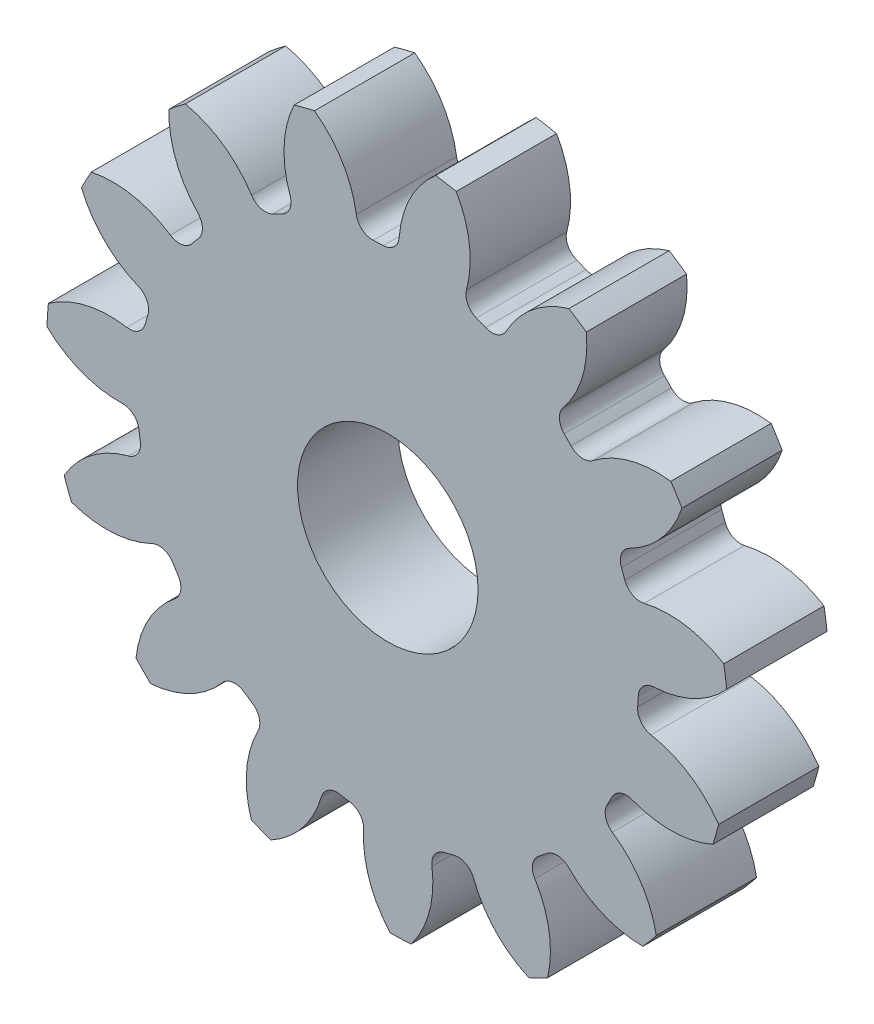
ISO-10303-21;
HEADER;
FILE_DESCRIPTION(('STEP AP214'),'2;1');
FILE_NAME('part.step','',(''),(''),'','','');
FILE_SCHEMA(('AUTOMOTIVE_DESIGN { 1 0 10303 214 1 1 1 1 }'));
ENDSEC;
DATA;
#1=APPLICATION_CONTEXT('core data for automotive mechanical design processes');
#2=APPLICATION_PROTOCOL_DEFINITION('international standard','automotive_design',2000,#1);
#3=PRODUCT_CONTEXT('',#1,'mechanical');
#4=PRODUCT('Part','Part','',(#3));
#5=PRODUCT_RELATED_PRODUCT_CATEGORY('part','',(#4));
#6=PRODUCT_DEFINITION_FORMATION('','',#4);
#7=PRODUCT_DEFINITION_CONTEXT('part definition',#1,'design');
#8=PRODUCT_DEFINITION('design','',#6,#7);
#9=PRODUCT_DEFINITION_SHAPE('','',#8);
#10=(LENGTH_UNIT() NAMED_UNIT(*) SI_UNIT(.MILLI.,.METRE.));
#11=(NAMED_UNIT(*) PLANE_ANGLE_UNIT() SI_UNIT($,.RADIAN.));
#12=(NAMED_UNIT(*) SI_UNIT($,.STERADIAN.) SOLID_ANGLE_UNIT());
#13=UNCERTAINTY_MEASURE_WITH_UNIT(LENGTH_MEASURE(1.E-05),#10,'distance_accuracy_value','');
#14=(GEOMETRIC_REPRESENTATION_CONTEXT(3) GLOBAL_UNCERTAINTY_ASSIGNED_CONTEXT((#13)) GLOBAL_UNIT_ASSIGNED_CONTEXT((#10,
#11,#12)) REPRESENTATION_CONTEXT('',''));
#15=CARTESIAN_POINT('',(0.,0.,0.));
#16=DIRECTION('',(0.,0.,1.));
#17=DIRECTION('',(1.,0.,0.));
#18=AXIS2_PLACEMENT_3D('',#15,#16,#17);
#19=CARTESIAN_POINT('',(0.,0.,127.));
#20=DIRECTION('',(0.,0.,-1.));
#21=DIRECTION('',(-1.,0.,0.));
#22=AXIS2_PLACEMENT_3D('',#19,#20,#21);
#23=CYLINDRICAL_SURFACE('',#22,431.8);
#24=DIRECTION('',(0.,0.,-1.));
#25=VECTOR('',#24,1.);
#26=CARTESIAN_POINT('',(425.337028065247,74.4288422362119,63.5));
#27=LINE('',#26,#25);
#28=CARTESIAN_POINT('',(425.337028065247,74.4288422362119,127.));
#29=VERTEX_POINT('',#28);
#30=CARTESIAN_POINT('',(425.337028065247,74.4288422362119,0.));
#31=VERTEX_POINT('',#30);
#32=EDGE_CURVE('E636',#29,#31,#27,.T.);
#33=ORIENTED_EDGE('',*,*,#32,.F.);
#34=CARTESIAN_POINT('',(0.,0.,127.));
#35=DIRECTION('',(0.,0.,1.));
#36=DIRECTION('',(1.,0.,0.));
#37=AXIS2_PLACEMENT_3D('',#34,#35,#36);
#38=CIRCLE('',#37,431.8);
#39=CARTESIAN_POINT('',(429.094026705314,48.2654767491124,127.));
#40=VERTEX_POINT('',#39);
#41=EDGE_CURVE('E1167',#40,#29,#38,.T.);
#42=ORIENTED_EDGE('',*,*,#41,.F.);
#43=DIRECTION('',(0.,0.,-1.));
#44=VECTOR('',#43,1.);
#45=CARTESIAN_POINT('',(429.094026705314,48.2654767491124,63.5));
#46=LINE('',#45,#44);
#47=CARTESIAN_POINT('',(429.094026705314,48.2654767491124,0.));
#48=VERTEX_POINT('',#47);
#49=EDGE_CURVE('E1161',#48,#40,#46,.F.);
#50=ORIENTED_EDGE('',*,*,#49,.F.);
#51=CARTESIAN_POINT('',(0.,0.,0.));
#52=DIRECTION('',(0.,0.,1.));
#53=DIRECTION('',(1.,0.,0.));
#54=AXIS2_PLACEMENT_3D('',#51,#52,#53);
#55=CIRCLE('',#54,431.8);
#56=EDGE_CURVE('E1172',#48,#31,#55,.T.);
#57=ORIENTED_EDGE('',*,*,#56,.T.);
#58=EDGE_LOOP('',(#33,#42,#50,#57));
#59=FACE_BOUND('',#58,.T.);
#60=ADVANCED_FACE('F33',(#59),#23,.T.);
#61=DIRECTION('',(0.,0.,-1.));
#62=VECTOR('',#61,1.);
#63=CARTESIAN_POINT('',(372.365561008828,218.620971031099,63.5));
#64=LINE('',#63,#62);
#65=CARTESIAN_POINT('',(372.365561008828,218.620971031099,0.));
#66=VERTEX_POINT('',#65);
#67=CARTESIAN_POINT('',(372.365561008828,218.620971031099,127.));
#68=VERTEX_POINT('',#67);
#69=EDGE_CURVE('E607',#66,#68,#64,.F.);
#70=ORIENTED_EDGE('',*,*,#69,.F.);
#71=CARTESIAN_POINT('',(358.291772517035,240.994285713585,0.));
#72=VERTEX_POINT('',#71);
#73=EDGE_CURVE('E1175',#66,#72,#55,.T.);
#74=ORIENTED_EDGE('',*,*,#73,.T.);
#75=DIRECTION('',(0.,0.,-1.));
#76=VECTOR('',#75,1.);
#77=CARTESIAN_POINT('',(358.291772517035,240.994285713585,63.5));
#78=LINE('',#77,#76);
#79=CARTESIAN_POINT('',(358.291772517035,240.994285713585,127.));
#80=VERTEX_POINT('',#79);
#81=EDGE_CURVE('E669',#80,#72,#78,.T.);
#82=ORIENTED_EDGE('',*,*,#81,.F.);
#83=EDGE_CURVE('E1170',#68,#80,#38,.T.);
#84=ORIENTED_EDGE('',*,*,#83,.F.);
#85=EDGE_LOOP('',(#70,#74,#82,#84));
#86=FACE_BOUND('',#85,.T.);
#87=ADVANCED_FACE('F1346',(#86),#23,.T.);
#88=CARTESIAN_POINT('',(0.,0.,127.));
#89=DIRECTION('',(0.,0.,1.));
#90=DIRECTION('',(1.,0.,0.));
#91=AXIS2_PLACEMENT_3D('',#88,#89,#90);
#92=PLANE('',#91);
#93=CARTESIAN_POINT('',(0.,0.,127.000000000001));
#94=DIRECTION('',(0.,0.,1.));
#95=DIRECTION('',(1.,0.,0.));
#96=AXIS2_PLACEMENT_3D('',#93,#94,#95);
#97=CIRCLE('',#96,114.3);
#98=CARTESIAN_POINT('',(114.3,0.,127.000000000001));
#99=VERTEX_POINT('',#98);
#100=EDGE_CURVE('E624',#99,#99,#97,.T.);
#101=ORIENTED_EDGE('',*,*,#100,.F.);
#102=EDGE_LOOP('',(#101));
#103=FACE_BOUND('',#102,.T.);
#104=ORIENTED_EDGE('',*,*,#41,.T.);
#105=CARTESIAN_POINT('',(355.957958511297,-38.3968810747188,127.));
#106=DIRECTION('',(0.,0.,-1.));
#107=DIRECTION('',(0.913545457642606,0.406736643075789,0.));
#108=AXIS2_PLACEMENT_3D('',#105,#106,#107);
#109=CIRCLE('',#108,132.450364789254);
#110=CARTESIAN_POINT('',(324.560883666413,90.2783800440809,127.));
#111=VERTEX_POINT('',#110);
#112=EDGE_CURVE('E616',#111,#29,#109,.T.);
#113=ORIENTED_EDGE('',*,*,#112,.F.);
#114=CARTESIAN_POINT('',(319.659777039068,110.364683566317,127.));
#115=DIRECTION('',(0.,0.,1.));
#116=DIRECTION('',(-0.913545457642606,-0.406736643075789,0.));
#117=AXIS2_PLACEMENT_3D('',#114,#115,#116);
#118=CIRCLE('',#117,20.6756);
#119=CARTESIAN_POINT('',(300.116209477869,103.617135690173,127.));
#120=VERTEX_POINT('',#119);
#121=EDGE_CURVE('E614',#120,#111,#118,.T.);
#122=ORIENTED_EDGE('',*,*,#121,.F.);
#123=CARTESIAN_POINT('',(0.,0.,127.));
#124=DIRECTION('',(0.,0.,-1.));
#125=DIRECTION('',(0.913545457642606,0.406736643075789,0.));
#126=AXIS2_PLACEMENT_3D('',#123,#124,#125);
#127=CIRCLE('',#126,317.5);
#128=CARTESIAN_POINT('',(295.820456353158,115.310483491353,127.));
#129=VERTEX_POINT('',#128);
#130=EDGE_CURVE('E599',#129,#120,#127,.T.);
#131=ORIENTED_EDGE('',*,*,#130,.F.);
#132=CARTESIAN_POINT('',(315.084284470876,122.819502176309,127.));
#133=DIRECTION('',(0.,0.,1.));
#134=DIRECTION('',(-0.913545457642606,-0.406736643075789,0.));
#135=AXIS2_PLACEMENT_3D('',#132,#133,#134);
#136=CIRCLE('',#135,20.6756);
#137=CARTESIAN_POINT('',(305.816598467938,141.301667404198,127.));
#138=VERTEX_POINT('',#137);
#139=EDGE_CURVE('E591',#138,#129,#136,.T.);
#140=ORIENTED_EDGE('',*,*,#139,.F.);
#141=CARTESIAN_POINT('',(246.446694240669,259.700626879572,127.));
#142=DIRECTION('',(0.,0.,-1.));
#143=DIRECTION('',(-0.913545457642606,-0.406736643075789,0.));
#144=AXIS2_PLACEMENT_3D('',#141,#142,#143);
#145=CIRCLE('',#144,132.450364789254);
#146=EDGE_CURVE('E621',#68,#138,#145,.T.);
#147=ORIENTED_EDGE('',*,*,#146,.F.);
#148=ORIENTED_EDGE('',*,*,#83,.T.);
#149=CARTESIAN_POINT('',(340.801194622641,109.703848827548,127.));
#150=DIRECTION('',(0.,0.,-1.));
#151=DIRECTION('',(0.669130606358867,0.743144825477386,0.));
#152=AXIS2_PLACEMENT_3D('',#149,#150,#151);
#153=CIRCLE('',#152,132.450364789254);
#154=CARTESIAN_POINT('',(259.781595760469,214.484208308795,127.));
#155=VERTEX_POINT('',#154);
#156=EDGE_CURVE('E645',#155,#80,#153,.T.);
#157=ORIENTED_EDGE('',*,*,#156,.F.);
#158=CARTESIAN_POINT('',(247.1343763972,230.840499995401,127.));
#159=DIRECTION('',(0.,0.,1.));
#160=DIRECTION('',(-0.669130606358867,-0.743144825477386,0.));
#161=AXIS2_PLACEMENT_3D('',#158,#159,#160);
#162=CIRCLE('',#161,20.6756);
#163=CARTESIAN_POINT('',(232.024913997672,216.727223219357,127.));
#164=VERTEX_POINT('',#163);
#165=EDGE_CURVE('E643',#164,#155,#162,.T.);
#166=ORIENTED_EDGE('',*,*,#165,.F.);
#167=CARTESIAN_POINT('',(0.,0.,127.));
#168=DIRECTION('',(0.,0.,-1.));
#169=DIRECTION('',(0.669130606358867,0.743144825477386,0.));
#170=AXIS2_PLACEMENT_3D('',#167,#168,#169);
#171=CIRCLE('',#170,317.5);
#172=CARTESIAN_POINT('',(223.344435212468,225.662387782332,127.));
#173=VERTEX_POINT('',#172);
#174=EDGE_CURVE('E640',#173,#164,#171,.T.);
#175=ORIENTED_EDGE('',*,*,#174,.F.);
#176=CARTESIAN_POINT('',(237.888624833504,240.357522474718,127.));
#177=DIRECTION('',(0.,0.,1.));
#178=DIRECTION('',(-0.669130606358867,-0.743144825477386,0.));
#179=AXIS2_PLACEMENT_3D('',#176,#177,#178);
#180=CIRCLE('',#179,20.6756);
#181=CARTESIAN_POINT('',(221.904798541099,253.472313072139,127.));
#182=VERTEX_POINT('',#181);
#183=EDGE_CURVE('E638',#182,#173,#180,.T.);
#184=ORIENTED_EDGE('',*,*,#183,.F.);
#185=CARTESIAN_POINT('',(119.510496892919,337.487229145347,127.));
#186=DIRECTION('',(0.,0.,-1.));
#187=DIRECTION('',(-0.669130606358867,-0.743144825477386,0.));
#188=AXIS2_PLACEMENT_3D('',#185,#186,#187);
#189=CIRCLE('',#188,132.450364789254);
#190=CARTESIAN_POINT('',(251.251706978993,351.174913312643,127.));
#191=VERTEX_POINT('',#190);
#192=EDGE_CURVE('E648',#191,#182,#189,.T.);
#193=ORIENTED_EDGE('',*,*,#192,.F.);
#194=CARTESIAN_POINT('',(229.294614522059,365.889627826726,127.));
#195=VERTEX_POINT('',#194);
#196=EDGE_CURVE('E1213',#191,#195,#38,.T.);
#197=ORIENTED_EDGE('',*,*,#196,.T.);
#198=CARTESIAN_POINT('',(266.716808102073,238.835786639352,127.));
#199=DIRECTION('',(0.,0.,-1.));
#200=DIRECTION('',(0.309016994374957,0.95105651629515,0.));
#201=AXIS2_PLACEMENT_3D('',#198,#199,#200);
#202=CIRCLE('',#201,132.450364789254);
#203=CARTESIAN_POINT('',(150.083709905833,301.603768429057,127.));
#204=VERTEX_POINT('',#203);
#205=EDGE_CURVE('E680',#204,#195,#202,.T.);
#206=ORIENTED_EDGE('',*,*,#205,.F.);
#207=CARTESIAN_POINT('',(131.87719693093,311.401896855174,127.));
#208=DIRECTION('',(0.,0.,1.));
#209=DIRECTION('',(-0.309016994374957,-0.95105651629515,0.));
#210=AXIS2_PLACEMENT_3D('',#207,#208,#209);
#211=CIRCLE('',#210,20.6756);
#212=CARTESIAN_POINT('',(123.814403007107,292.363204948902,127.));
#213=VERTEX_POINT('',#212);
#214=EDGE_CURVE('E678',#213,#204,#211,.T.);
#215=ORIENTED_EDGE('',*,*,#214,.F.);
#216=CARTESIAN_POINT('',(0.,0.,127.));
#217=DIRECTION('',(0.,0.,-1.));
#218=DIRECTION('',(0.309016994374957,0.95105651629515,0.));
#219=AXIS2_PLACEMENT_3D('',#216,#217,#218);
#220=CIRCLE('',#219,317.5);
#221=CARTESIAN_POINT('',(112.250132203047,296.995215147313,127.));
#222=VERTEX_POINT('',#221);
#223=EDGE_CURVE('E675',#222,#213,#220,.T.);
#224=ORIENTED_EDGE('',*,*,#223,.F.);
#225=CARTESIAN_POINT('',(119.559860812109,316.335543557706,127.));
#226=DIRECTION('',(0.,0.,1.));
#227=DIRECTION('',(-0.309016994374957,-0.95105651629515,0.));
#228=AXIS2_PLACEMENT_3D('',#225,#226,#227);
#229=CIRCLE('',#228,20.6756);
#230=CARTESIAN_POINT('',(99.623643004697,321.815293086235,127.));
#231=VERTEX_POINT('',#230);
#232=EDGE_CURVE('E673',#231,#222,#229,.T.);
#233=ORIENTED_EDGE('',*,*,#232,.F.);
#234=CARTESIAN_POINT('',(-28.0901510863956,356.919223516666,127.));
#235=DIRECTION('',(0.,0.,-1.));
#236=DIRECTION('',(-0.309016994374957,-0.95105651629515,0.));
#237=AXIS2_PLACEMENT_3D('',#234,#235,#236);
#238=CIRCLE('',#237,132.450364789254);
#239=CARTESIAN_POINT('',(86.6941502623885,423.007522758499,127.));
#240=VERTEX_POINT('',#239);
#241=EDGE_CURVE('E683',#240,#231,#238,.T.);
#242=ORIENTED_EDGE('',*,*,#241,.F.);
#243=CARTESIAN_POINT('',(60.650334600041,427.51932928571,127.));
#244=VERTEX_POINT('',#243);
#245=EDGE_CURVE('E1328',#240,#244,#38,.T.);
#246=ORIENTED_EDGE('',*,*,#245,.T.);
#247=CARTESIAN_POINT('',(146.514662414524,326.670847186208,127.));
#248=DIRECTION('',(0.,0.,-1.));
#249=DIRECTION('',(-0.104528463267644,0.994521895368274,0.));
#250=AXIS2_PLACEMENT_3D('',#247,#248,#249);
#251=CIRCLE('',#250,132.450364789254);
#252=CARTESIAN_POINT('',(14.4349871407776,336.573297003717,127.));
#253=VERTEX_POINT('',#252);
#254=EDGE_CURVE('E718',#253,#244,#251,.T.);
#255=ORIENTED_EDGE('',*,*,#254,.F.);
#256=CARTESIAN_POINT('',(-6.18274795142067,338.119076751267,127.));
#257=DIRECTION('',(0.,0.,1.));
#258=DIRECTION('',(0.104528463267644,-0.994521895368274,0.));
#259=AXIS2_PLACEMENT_3D('',#256,#257,#258);
#260=CIRCLE('',#259,20.6756);
#261=CARTESIAN_POINT('',(-5.80474308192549,317.446932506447,127.));
#262=VERTEX_POINT('',#261);
#263=EDGE_CURVE('E716',#262,#253,#260,.T.);
#264=ORIENTED_EDGE('',*,*,#263,.F.);
#265=CARTESIAN_POINT('',(0.,0.,127.));
#266=DIRECTION('',(0.,0.,-1.));
#267=DIRECTION('',(-0.104528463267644,0.994521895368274,0.));
#268=AXIS2_PLACEMENT_3D('',#265,#266,#267);
#269=CIRCLE('',#268,317.5);
#270=CARTESIAN_POINT('',(-18.2532384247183,316.974871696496,127.));
#271=VERTEX_POINT('',#270);
#272=EDGE_CURVE('E713',#271,#262,#269,.T.);
#273=ORIENTED_EDGE('',*,*,#272,.F.);
#274=CARTESIAN_POINT('',(-19.4418893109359,337.616275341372,127.));
#275=DIRECTION('',(0.,0.,1.));
#276=DIRECTION('',(0.104528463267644,-0.994521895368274,0.));
#277=AXIS2_PLACEMENT_3D('',#274,#275,#276);
#278=CIRCLE('',#277,20.6756);
#279=CARTESIAN_POINT('',(-39.8833454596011,334.513485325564,127.));
#280=VERTEX_POINT('',#279);
#281=EDGE_CURVE('E711',#280,#271,#278,.T.);
#282=ORIENTED_EDGE('',*,*,#281,.F.);
#283=CARTESIAN_POINT('',(-170.833756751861,314.636641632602,127.));
#284=DIRECTION('',(0.,0.,-1.));
#285=DIRECTION('',(0.104528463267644,-0.994521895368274,0.));
#286=AXIS2_PLACEMENT_3D('',#283,#284,#285);
#287=CIRCLE('',#286,132.450364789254);
#288=CARTESIAN_POINT('',(-92.8536126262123,421.698288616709,127.));
#289=VERTEX_POINT('',#288);
#290=EDGE_CURVE('E721',#289,#280,#287,.T.);
#291=ORIENTED_EDGE('',*,*,#290,.F.);
#292=CARTESIAN_POINT('',(-118.480939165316,415.227054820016,127.));
#293=VERTEX_POINT('',#292);
#294=EDGE_CURVE('E1324',#289,#293,#38,.T.);
#295=ORIENTED_EDGE('',*,*,#294,.T.);
#296=CARTESIAN_POINT('',(0.978800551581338,358.021550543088,127.));
#297=DIRECTION('',(0.,0.,-1.));
#298=DIRECTION('',(-0.499999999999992,0.866025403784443,0.));
#299=AXIS2_PLACEMENT_3D('',#296,#297,#298);
#300=CIRCLE('',#299,132.450364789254);
#301=CARTESIAN_POINT('',(-123.709676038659,313.346244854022,127.));
#302=VERTEX_POINT('',#301);
#303=EDGE_CURVE('E756',#302,#293,#300,.T.);
#304=ORIENTED_EDGE('',*,*,#303,.F.);
#305=CARTESIAN_POINT('',(-143.173639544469,306.372396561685,127.));
#306=DIRECTION('',(0.,0.,1.));
#307=DIRECTION('',(0.499999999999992,-0.866025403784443,0.));
#308=AXIS2_PLACEMENT_3D('',#305,#306,#307);
#309=CIRCLE('',#308,20.6756);
#310=CARTESIAN_POINT('',(-134.420196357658,287.641201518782,127.));
#311=VERTEX_POINT('',#310);
#312=EDGE_CURVE('E754',#311,#302,#309,.T.);
#313=ORIENTED_EDGE('',*,*,#312,.F.);
#314=CARTESIAN_POINT('',(0.,0.,127.));
#315=DIRECTION('',(0.,0.,-1.));
#316=DIRECTION('',(-0.499999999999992,0.866025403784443,0.));
#317=AXIS2_PLACEMENT_3D('',#314,#315,#316);
#318=CIRCLE('',#317,317.5);
#319=CARTESIAN_POINT('',(-145.600458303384,282.146693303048,127.));
#320=VERTEX_POINT('',#319);
#321=EDGE_CURVE('E751',#320,#311,#318,.T.);
#322=ORIENTED_EDGE('',*,*,#321,.F.);
#323=CARTESIAN_POINT('',(-155.081960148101,300.520085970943,127.));
#324=DIRECTION('',(0.,0.,1.));
#325=DIRECTION('',(0.499999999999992,-0.866025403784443,0.));
#326=AXIS2_PLACEMENT_3D('',#323,#324,#325);
#327=CIRCLE('',#326,20.6756);
#328=CARTESIAN_POINT('',(-172.494141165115,289.371256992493,127.));
#329=VERTEX_POINT('',#328);
#330=EDGE_CURVE('E749',#329,#320,#327,.T.);
#331=ORIENTED_EDGE('',*,*,#330,.F.);
#332=CARTESIAN_POINT('',(-284.038653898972,217.950526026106,127.));
#333=DIRECTION('',(0.,0.,-1.));
#334=DIRECTION('',(0.499999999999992,-0.866025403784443,0.));
#335=AXIS2_PLACEMENT_3D('',#332,#333,#334);
#336=CIRCLE('',#335,132.450364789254);
#337=CARTESIAN_POINT('',(-256.346142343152,347.473589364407,127.));
#338=VERTEX_POINT('',#337);
#339=EDGE_CURVE('E759',#338,#329,#336,.T.);
#340=ORIENTED_EDGE('',*,*,#339,.F.);
#341=CARTESIAN_POINT('',(-277.125782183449,331.138250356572,127.));
#342=VERTEX_POINT('',#341);
#343=EDGE_CURVE('E1320',#338,#342,#38,.T.);
#344=ORIENTED_EDGE('',*,*,#343,.T.);
#345=CARTESIAN_POINT('',(-144.726304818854,327.467075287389,127.));
#346=DIRECTION('',(0.,0.,-1.));
#347=DIRECTION('',(-0.809016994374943,0.58778525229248,0.));
#348=AXIS2_PLACEMENT_3D('',#345,#346,#347);
#349=CIRCLE('',#348,132.450364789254);
#350=CARTESIAN_POINT('',(-240.463812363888,235.938780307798,127.));
#351=VERTEX_POINT('',#350);
#352=EDGE_CURVE('E794',#351,#342,#349,.T.);
#353=ORIENTED_EDGE('',*,*,#352,.F.);
#354=CARTESIAN_POINT('',(-255.408508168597,221.651145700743,127.));
#355=DIRECTION('',(0.,0.,1.));
#356=DIRECTION('',(0.809016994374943,-0.58778525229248,0.));
#357=AXIS2_PLACEMENT_3D('',#354,#355,#356);
#358=CIRCLE('',#357,20.6756);
#359=CARTESIAN_POINT('',(-239.793176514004,208.09969365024,127.));
#360=VERTEX_POINT('',#359);
#361=EDGE_CURVE('E792',#360,#351,#358,.T.);
#362=ORIENTED_EDGE('',*,*,#361,.F.);
#363=CARTESIAN_POINT('',(0.,0.,127.));
#364=DIRECTION('',(0.,0.,-1.));
#365=DIRECTION('',(-0.809016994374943,0.58778525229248,0.));
#366=AXIS2_PLACEMENT_3D('',#363,#364,#365);
#367=CIRCLE('',#366,317.5);
#368=CARTESIAN_POINT('',(-247.772036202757,198.532788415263,127.));
#369=VERTEX_POINT('',#368);
#370=EDGE_CURVE('E789',#369,#360,#367,.T.);
#371=ORIENTED_EDGE('',*,*,#370,.F.);
#372=CARTESIAN_POINT('',(-263.906951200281,211.461243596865,127.));
#373=DIRECTION('',(0.,0.,1.));
#374=DIRECTION('',(0.809016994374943,-0.58778525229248,0.));
#375=AXIS2_PLACEMENT_3D('',#372,#373,#374);
#376=CIRCLE('',#375,20.6756);
#377=CARTESIAN_POINT('',(-275.279132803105,194.19410947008,127.));
#378=VERTEX_POINT('',#377);
#379=EDGE_CURVE('E787',#378,#369,#376,.T.);
#380=ORIENTED_EDGE('',*,*,#379,.F.);
#381=CARTESIAN_POINT('',(-348.130687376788,83.5787844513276,127.));
#382=DIRECTION('',(0.,0.,-1.));
#383=DIRECTION('',(0.809016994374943,-0.58778525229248,0.));
#384=AXIS2_PLACEMENT_3D('',#381,#382,#383);
#385=CIRCLE('',#384,132.450364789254);
#386=CARTESIAN_POINT('',(-375.514095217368,213.167549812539,127.));
#387=VERTEX_POINT('',#386);
#388=EDGE_CURVE('E797',#387,#378,#385,.T.);
#389=ORIENTED_EDGE('',*,*,#388,.F.);
#390=CARTESIAN_POINT('',(-387.853059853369,189.792634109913,127.));
#391=VERTEX_POINT('',#390);
#392=EDGE_CURVE('E1316',#387,#391,#38,.T.);
#393=ORIENTED_EDGE('',*,*,#392,.T.);
#394=CARTESIAN_POINT('',(-265.406917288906,240.290567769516,127.));
#395=DIRECTION('',(0.,0.,-1.));
#396=DIRECTION('',(-0.978147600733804,0.207911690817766,0.));
#397=AXIS2_PLACEMENT_3D('',#394,#395,#396);
#398=CIRCLE('',#397,132.450364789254);
#399=CARTESIAN_POINT('',(-315.639570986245,117.735357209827,127.));
#400=VERTEX_POINT('',#399);
#401=EDGE_CURVE('E832',#400,#391,#398,.T.);
#402=ORIENTED_EDGE('',*,*,#401,.F.);
#403=CARTESIAN_POINT('',(-323.48092541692,98.6043981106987,127.));
#404=DIRECTION('',(0.,0.,1.));
#405=DIRECTION('',(0.978147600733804,-0.207911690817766,0.));
#406=AXIS2_PLACEMENT_3D('',#403,#404,#405);
#407=CIRCLE('',#406,20.6756);
#408=CARTESIAN_POINT('',(-303.70373799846,92.5758582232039,127.));
#409=VERTEX_POINT('',#408);
#410=EDGE_CURVE('E830',#409,#400,#407,.T.);
#411=ORIENTED_EDGE('',*,*,#410,.F.);
#412=CARTESIAN_POINT('',(0.,0.,127.));
#413=DIRECTION('',(0.,0.,-1.));
#414=DIRECTION('',(-0.978147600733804,0.207911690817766,0.));
#415=AXIS2_PLACEMENT_3D('',#412,#413,#414);
#416=CIRCLE('',#415,317.5);
#417=CARTESIAN_POINT('',(-307.101578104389,80.5907607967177,127.));
#418=VERTEX_POINT('',#417);
#419=EDGE_CURVE('E827',#418,#409,#416,.T.);
#420=ORIENTED_EDGE('',*,*,#419,.F.);
#421=CARTESIAN_POINT('',(-327.100032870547,85.8388311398,127.));
#422=DIRECTION('',(0.,0.,1.));
#423=DIRECTION('',(0.978147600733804,-0.207911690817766,0.));
#424=AXIS2_PLACEMENT_3D('',#421,#422,#423);
#425=CIRCLE('',#424,20.6756);
#426=CARTESIAN_POINT('',(-330.465861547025,65.4390362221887,127.));
#427=VERTEX_POINT('',#426);
#428=EDGE_CURVE('E825',#427,#418,#425,.T.);
#429=ORIENTED_EDGE('',*,*,#428,.F.);
#430=CARTESIAN_POINT('',(-352.02776233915,-65.2444882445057,127.));
#431=DIRECTION('',(0.,0.,-1.));
#432=DIRECTION('',(0.978147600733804,-0.207911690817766,0.));
#433=AXIS2_PLACEMENT_3D('',#430,#431,#432);
#434=CIRCLE('',#433,132.450364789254);
#435=CARTESIAN_POINT('',(-429.752249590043,42.0029043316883,127.));
#436=VERTEX_POINT('',#435);
#437=EDGE_CURVE('E835',#436,#427,#434,.T.);
#438=ORIENTED_EDGE('',*,*,#437,.F.);
#439=CARTESIAN_POINT('',(-431.517019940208,15.630147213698,127.));
#440=VERTEX_POINT('',#439);
#441=EDGE_CURVE('E1312',#436,#440,#38,.T.);
#442=ORIENTED_EDGE('',*,*,#441,.T.);
#443=CARTESIAN_POINT('',(-340.196262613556,111.565638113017,127.));
#444=DIRECTION('',(0.,0.,-1.));
#445=DIRECTION('',(-0.978147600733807,-0.207911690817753,0.));
#446=AXIS2_PLACEMENT_3D('',#443,#444,#445);
#447=CIRCLE('',#446,132.450364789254);
#448=CARTESIAN_POINT('',(-336.238380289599,-20.8255787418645,127.));
#449=VERTEX_POINT('',#448);
#450=EDGE_CURVE('E870',#449,#440,#447,.T.);
#451=ORIENTED_EDGE('',*,*,#450,.F.);
#452=CARTESIAN_POINT('',(-335.620551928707,-41.4919457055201,127.));
#453=DIRECTION('',(0.,0.,1.));
#454=DIRECTION('',(0.978147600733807,0.207911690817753,0.));
#455=AXIS2_PLACEMENT_3D('',#452,#453,#454);
#456=CIRCLE('',#455,20.6756);
#457=CARTESIAN_POINT('',(-315.101164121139,-38.955184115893,127.));
#458=VERTEX_POINT('',#457);
#459=EDGE_CURVE('E868',#458,#449,#456,.T.);
#460=ORIENTED_EDGE('',*,*,#459,.F.);
#461=CARTESIAN_POINT('',(0.,0.,127.));
#462=DIRECTION('',(0.,0.,-1.));
#463=DIRECTION('',(-0.978147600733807,-0.207911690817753,0.));
#464=AXIS2_PLACEMENT_3D('',#461,#462,#463);
#465=CIRCLE('',#464,317.5);
#466=CARTESIAN_POINT('',(-313.330467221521,-51.2861415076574,127.));
#467=VERTEX_POINT('',#466);
#468=EDGE_CURVE('E865',#467,#458,#465,.T.);
#469=ORIENTED_EDGE('',*,*,#468,.F.);
#470=CARTESIAN_POINT('',(-333.734547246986,-54.625895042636,127.));
#471=DIRECTION('',(0.,0.,1.));
#472=DIRECTION('',(0.978147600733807,0.207911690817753,0.));
#473=AXIS2_PLACEMENT_3D('',#470,#471,#472);
#474=CIRCLE('',#473,20.6756);
#475=CARTESIAN_POINT('',(-328.512040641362,-74.6310408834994,127.));
#476=VERTEX_POINT('',#475);
#477=EDGE_CURVE('E863',#476,#467,#474,.T.);
#478=ORIENTED_EDGE('',*,*,#477,.F.);
#479=CARTESIAN_POINT('',(-295.056039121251,-202.786396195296,127.));
#480=DIRECTION('',(0.,0.,-1.));
#481=DIRECTION('',(0.978147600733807,0.207911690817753,0.));
#482=AXIS2_PLACEMENT_3D('',#479,#480,#481);
#483=CIRCLE('',#482,132.450364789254);
#484=CARTESIAN_POINT('',(-409.682335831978,-136.424424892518,127.));
#485=VERTEX_POINT('',#484);
#486=EDGE_CURVE('E873',#485,#476,#483,.T.);
#487=ORIENTED_EDGE('',*,*,#486,.F.);
#488=CARTESIAN_POINT('',(-400.567767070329,-161.234934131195,127.));
#489=VERTEX_POINT('',#488);
#490=EDGE_CURVE('E1308',#485,#489,#38,.T.);
#491=ORIENTED_EDGE('',*,*,#490,.T.);
#492=CARTESIAN_POINT('',(-356.162583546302,-36.4500039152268,127.));
#493=DIRECTION('',(0.,0.,-1.));
#494=DIRECTION('',(-0.80901699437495,-0.587785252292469,0.));
#495=AXIS2_PLACEMENT_3D('',#492,#493,#494);
#496=CIRCLE('',#495,132.450364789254);
#497=CARTESIAN_POINT('',(-298.698519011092,-155.785582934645,127.));
#498=VERTEX_POINT('',#497);
#499=EDGE_CURVE('E908',#498,#489,#496,.T.);
#500=ORIENTED_EDGE('',*,*,#499,.F.);
#501=CARTESIAN_POINT('',(-289.728335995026,-174.413955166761,127.));
#502=DIRECTION('',(0.,0.,1.));
#503=DIRECTION('',(0.80901699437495,0.587785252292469,0.));
#504=AXIS2_PLACEMENT_3D('',#501,#502,#503);
#505=CIRCLE('',#504,20.6756);
#506=CARTESIAN_POINT('',(-272.014736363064,-163.750521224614,127.));
#507=VERTEX_POINT('',#506);
#508=EDGE_CURVE('E906',#507,#498,#505,.T.);
#509=ORIENTED_EDGE('',*,*,#508,.F.);
#510=CARTESIAN_POINT('',(0.,0.,127.));
#511=DIRECTION('',(0.,0.,-1.));
#512=DIRECTION('',(-0.80901699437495,-0.587785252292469,0.));
#513=AXIS2_PLACEMENT_3D('',#510,#511,#512);
#514=CIRCLE('',#513,317.5);
#515=CARTESIAN_POINT('',(-265.381672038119,-174.29520402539,127.));
#516=VERTEX_POINT('',#515);
#517=EDGE_CURVE('E903',#516,#507,#514,.T.);
#518=ORIENTED_EDGE('',*,*,#517,.F.);
#519=CARTESIAN_POINT('',(-282.663326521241,-185.645307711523,127.));
#520=DIRECTION('',(0.,0.,1.));
#521=DIRECTION('',(0.80901699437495,0.587785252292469,0.));
#522=AXIS2_PLACEMENT_3D('',#519,#520,#521);
#523=CIRCLE('',#522,20.6756);
#524=CARTESIAN_POINT('',(-269.75550347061,-201.796733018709,127.));
#525=VERTEX_POINT('',#524);
#526=EDGE_CURVE('E901',#525,#516,#523,.T.);
#527=ORIENTED_EDGE('',*,*,#526,.F.);
#528=CARTESIAN_POINT('',(-187.066446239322,-305.264693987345,127.));
#529=DIRECTION('',(0.,0.,-1.));
#530=DIRECTION('',(0.80901699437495,0.587785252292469,0.));
#531=AXIS2_PLACEMENT_3D('',#528,#529,#530);
#532=CIRCLE('',#531,132.450364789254);
#533=CARTESIAN_POINT('',(-318.774624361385,-291.262731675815,127.));
#534=VERTEX_POINT('',#533);
#535=EDGE_CURVE('E911',#534,#525,#532,.T.);
#536=ORIENTED_EDGE('',*,*,#535,.F.);
#537=CARTESIAN_POINT('',(-300.356708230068,-310.221030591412,127.));
#538=VERTEX_POINT('',#537);
#539=EDGE_CURVE('E1304',#534,#538,#38,.T.);
#540=ORIENTED_EDGE('',*,*,#539,.T.);
#541=CARTESIAN_POINT('',(-310.545158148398,-178.163109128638,127.));
#542=DIRECTION('',(0.,0.,-1.));
#543=DIRECTION('',(-0.500000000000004,-0.866025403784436,0.));
#544=AXIS2_PLACEMENT_3D('',#541,#542,#543);
#545=CIRCLE('',#544,132.450364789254);
#546=CARTESIAN_POINT('',(-209.510970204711,-263.808844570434,127.));
#547=VERTEX_POINT('',#546);
#548=EDGE_CURVE('E946',#547,#538,#545,.T.);
#549=ORIENTED_EDGE('',*,*,#548,.F.);
#550=CARTESIAN_POINT('',(-193.739458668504,-277.17820727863,127.));
#551=DIRECTION('',(0.,0.,1.));
#552=DIRECTION('',(0.500000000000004,0.866025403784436,0.));
#553=AXIS2_PLACEMENT_3D('',#550,#551,#552);
#554=CIRCLE('',#553,20.6756);
#555=CARTESIAN_POINT('',(-181.894489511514,-260.231905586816,127.));
#556=VERTEX_POINT('',#555);
#557=EDGE_CURVE('E944',#556,#547,#554,.T.);
#558=ORIENTED_EDGE('',*,*,#557,.F.);
#559=CARTESIAN_POINT('',(0.,0.,127.));
#560=DIRECTION('',(0.,0.,-1.));
#561=DIRECTION('',(-0.500000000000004,-0.866025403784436,0.));
#562=AXIS2_PLACEMENT_3D('',#559,#560,#561);
#563=CIRCLE('',#562,317.5);
#564=CARTESIAN_POINT('',(-171.545974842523,-267.167042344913,127.));
#565=VERTEX_POINT('',#564);
#566=EDGE_CURVE('E941',#565,#556,#563,.T.);
#567=ORIENTED_EDGE('',*,*,#566,.F.);
#568=CARTESIAN_POINT('',(-182.717048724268,-284.564960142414,127.));
#569=DIRECTION('',(0.,0.,1.));
#570=DIRECTION('',(0.500000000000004,0.866025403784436,0.));
#571=AXIS2_PLACEMENT_3D('',#568,#569,#570);
#572=CIRCLE('',#571,20.6756);
#573=CARTESIAN_POINT('',(-164.355789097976,-294.069936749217,127.));
#574=VERTEX_POINT('',#573);
#575=EDGE_CURVE('E939',#574,#565,#572,.T.);
#576=ORIENTED_EDGE('',*,*,#575,.F.);
#577=CARTESIAN_POINT('',(-46.7313653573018,-354.959952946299,127.));
#578=DIRECTION('',(0.,0.,-1.));
#579=DIRECTION('',(0.500000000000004,0.866025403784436,0.));
#580=AXIS2_PLACEMENT_3D('',#577,#578,#579);
#581=CIRCLE('',#580,132.450364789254);
#582=CARTESIAN_POINT('',(-172.74788436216,-395.739066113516,127.));
#583=VERTEX_POINT('',#582);
#584=EDGE_CURVE('E949',#583,#574,#581,.T.);
#585=ORIENTED_EDGE('',*,*,#584,.F.);
#586=CARTESIAN_POINT('',(-148.211245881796,-405.567092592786,127.));
#587=VERTEX_POINT('',#586);
#588=EDGE_CURVE('E1300',#583,#587,#38,.T.);
#589=ORIENTED_EDGE('',*,*,#588,.T.);
#590=CARTESIAN_POINT('',(-211.231653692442,-289.070194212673,127.));
#591=DIRECTION('',(0.,0.,-1.));
#592=DIRECTION('',(-0.104528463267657,-0.994521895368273,0.));
#593=AXIS2_PLACEMENT_3D('',#590,#591,#592);
#594=CIRCLE('',#593,132.450364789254);
#595=CARTESIAN_POINT('',(-84.0970713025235,-326.217160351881,127.));
#596=VERTEX_POINT('',#595);
#597=EDGE_CURVE('E984',#596,#587,#594,.T.);
#598=ORIENTED_EDGE('',*,*,#597,.F.);
#599=CARTESIAN_POINT('',(-64.2512688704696,-332.015829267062,127.));
#600=DIRECTION('',(0.,0.,1.));
#601=DIRECTION('',(0.104528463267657,0.994521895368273,0.));
#602=AXIS2_PLACEMENT_3D('',#599,#600,#601);
#603=CIRCLE('',#602,20.6756);
#604=CARTESIAN_POINT('',(-60.323032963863,-311.716829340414,127.));
#605=VERTEX_POINT('',#604);
#606=EDGE_CURVE('E982',#605,#596,#603,.T.);
#607=ORIENTED_EDGE('',*,*,#606,.F.);
#608=CARTESIAN_POINT('',(0.,0.,127.));
#609=DIRECTION('',(0.,0.,-1.));
#610=DIRECTION('',(-0.104528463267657,-0.994521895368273,0.));
#611=AXIS2_PLACEMENT_3D('',#608,#609,#610);
#612=CIRCLE('',#611,317.5);
#613=CARTESIAN_POINT('',(-48.0484201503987,-313.843271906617,127.));
#614=VERTEX_POINT('',#613);
#615=EDGE_CURVE('E979',#614,#605,#612,.T.);
#616=ORIENTED_EDGE('',*,*,#615,.F.);
#617=CARTESIAN_POINT('',(-51.1773332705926,-334.280745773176,127.));
#618=DIRECTION('',(0.,0.,1.));
#619=DIRECTION('',(0.104528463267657,0.994521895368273,0.));
#620=AXIS2_PLACEMENT_3D('',#617,#618,#619);
#621=CIRCLE('',#620,20.6756);
#622=CARTESIAN_POINT('',(-30.5374656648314,-335.495776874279,127.));
#623=VERTEX_POINT('',#622);
#624=EDGE_CURVE('E977',#623,#614,#621,.T.);
#625=ORIENTED_EDGE('',*,*,#624,.F.);
#626=CARTESIAN_POINT('',(101.683993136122,-343.2794113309,127.));
#627=DIRECTION('',(0.,0.,-1.));
#628=DIRECTION('',(0.104528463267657,0.994521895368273,0.));
#629=AXIS2_PLACEMENT_3D('',#626,#627,#628);
#630=CIRCLE('',#629,132.450364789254);
#631=CARTESIAN_POINT('',(3.14853420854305,-431.788520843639,127.));
#632=VERTEX_POINT('',#631);
#633=EDGE_CURVE('E987',#632,#623,#630,.T.);
#634=ORIENTED_EDGE('',*,*,#633,.F.);
#635=CARTESIAN_POINT('',(29.5612873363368,-430.7869198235,127.));
#636=VERTEX_POINT('',#635);
#637=EDGE_CURVE('E1296',#632,#636,#38,.T.);
#638=ORIENTED_EDGE('',*,*,#637,.T.);
#639=CARTESIAN_POINT('',(-75.3942773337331,-349.994416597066,127.));
#640=DIRECTION('',(0.,0.,-1.));
#641=DIRECTION('',(0.309016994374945,-0.951056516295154,0.));
#642=AXIS2_PLACEMENT_3D('',#639,#640,#641);
#643=CIRCLE('',#642,132.450364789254);
#644=CARTESIAN_POINT('',(55.8579752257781,-332.219565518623,127.));
#645=VERTEX_POINT('',#644);
#646=EDGE_CURVE('E1022',#645,#636,#643,.T.);
#647=ORIENTED_EDGE('',*,*,#646,.F.);
#648=CARTESIAN_POINT('',(76.3465490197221,-329.444898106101,127.));
#649=DIRECTION('',(0.,0.,1.));
#650=DIRECTION('',(-0.309016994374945,0.951056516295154,0.));
#651=AXIS2_PLACEMENT_3D('',#648,#649,#650);
#652=CIRCLE('',#651,20.6756);
#653=CARTESIAN_POINT('',(71.6788240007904,-309.303081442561,127.));
#654=VERTEX_POINT('',#653);
#655=EDGE_CURVE('E1020',#654,#645,#652,.T.);
#656=ORIENTED_EDGE('',*,*,#655,.F.);
#657=CARTESIAN_POINT('',(0.,0.,127.));
#658=DIRECTION('',(0.,0.,-1.));
#659=DIRECTION('',(0.309016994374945,-0.951056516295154,0.));
#660=AXIS2_PLACEMENT_3D('',#657,#658,#659);
#661=CIRCLE('',#660,317.5);
#662=CARTESIAN_POINT('',(83.7571428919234,-306.25314857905,127.));
#663=VERTEX_POINT('',#662);
#664=EDGE_CURVE('E1017',#663,#654,#661,.T.);
#665=ORIENTED_EDGE('',*,*,#664,.F.);
#666=CARTESIAN_POINT('',(89.2114080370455,-326.196353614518,127.));
#667=DIRECTION('',(0.,0.,1.));
#668=DIRECTION('',(-0.309016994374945,0.951056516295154,0.));
#669=AXIS2_PLACEMENT_3D('',#666,#667,#668);
#670=CIRCLE('',#669,20.6756);
#671=CARTESIAN_POINT('',(108.561063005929,-318.911349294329,127.));
#672=VERTEX_POINT('',#671);
#673=EDGE_CURVE('E1015',#672,#663,#670,.T.);
#674=ORIENTED_EDGE('',*,*,#673,.F.);
#675=CARTESIAN_POINT('',(232.517265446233,-272.242740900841,127.));
#676=DIRECTION('',(0.,0.,-1.));
#677=DIRECTION('',(-0.309016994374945,0.951056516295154,0.));
#678=AXIS2_PLACEMENT_3D('',#675,#676,#677);
#679=CIRCLE('',#678,132.450364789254);
#680=CARTESIAN_POINT('',(178.500542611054,-393.177817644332,127.));
#681=VERTEX_POINT('',#680);
#682=EDGE_CURVE('E1025',#681,#672,#679,.T.);
#683=ORIENTED_EDGE('',*,*,#682,.F.);
#684=CARTESIAN_POINT('',(202.222405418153,-381.519775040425,127.));
#685=VERTEX_POINT('',#684);
#686=EDGE_CURVE('E1292',#681,#685,#38,.T.);
#687=ORIENTED_EDGE('',*,*,#686,.T.);
#688=CARTESIAN_POINT('',(73.4794545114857,-350.40142475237,127.));
#689=DIRECTION('',(0.,0.,-1.));
#690=DIRECTION('',(0.669130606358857,-0.743144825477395,0.));
#691=AXIS2_PLACEMENT_3D('',#688,#689,#690);
#692=CIRCLE('',#691,132.450364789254);
#693=CARTESIAN_POINT('',(186.154670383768,-280.778189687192,127.));
#694=VERTEX_POINT('',#693);
#695=EDGE_CURVE('E1060',#694,#685,#692,.T.);
#696=ORIENTED_EDGE('',*,*,#695,.F.);
#697=CARTESIAN_POINT('',(203.74335499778,-269.909951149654,127.));
#698=DIRECTION('',(0.,0.,1.));
#699=DIRECTION('',(-0.669130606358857,0.743144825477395,0.));
#700=AXIS2_PLACEMENT_3D('',#697,#698,#699);
#701=CIRCLE('',#700,20.6756);
#702=CARTESIAN_POINT('',(191.286761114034,-253.408020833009,127.));
#703=VERTEX_POINT('',#702);
#704=EDGE_CURVE('E1058',#703,#694,#701,.T.);
#705=ORIENTED_EDGE('',*,*,#704,.F.);
#706=CARTESIAN_POINT('',(0.,0.,127.));
#707=DIRECTION('',(0.,0.,-1.));
#708=DIRECTION('',(0.669130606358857,-0.743144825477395,0.));
#709=AXIS2_PLACEMENT_3D('',#706,#707,#708);
#710=CIRCLE('',#709,317.5);
#711=CARTESIAN_POINT('',(201.080335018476,-245.709073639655,127.));
#712=VERTEX_POINT('',#711);
#713=EDGE_CURVE('E1055',#712,#703,#710,.T.);
#714=ORIENTED_EDGE('',*,*,#713,.F.);
#715=CARTESIAN_POINT('',(214.17468643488,-261.709648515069,127.));
#716=DIRECTION('',(0.,0.,1.));
#717=DIRECTION('',(-0.669130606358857,0.743144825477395,0.));
#718=AXIS2_PLACEMENT_3D('',#715,#716,#717);
#719=CIRCLE('',#718,20.6756);
#720=CARTESIAN_POINT('',(228.888397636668,-247.184252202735,127.));
#721=VERTEX_POINT('',#720);
#722=EDGE_CURVE('E1053',#721,#712,#719,.T.);
#723=ORIENTED_EDGE('',*,*,#722,.F.);
#724=CARTESIAN_POINT('',(323.146190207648,-154.132827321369,127.));
#725=DIRECTION('',(0.,0.,-1.));
#726=DIRECTION('',(-0.669130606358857,0.743144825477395,0.));
#727=AXIS2_PLACEMENT_3D('',#724,#725,#726);
#728=CIRCLE('',#727,132.450364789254);
#729=CARTESIAN_POINT('',(322.988185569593,-286.583097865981,127.));
#730=VERTEX_POINT('',#729);
#731=EDGE_CURVE('E1063',#730,#721,#728,.T.);
#732=ORIENTED_EDGE('',*,*,#731,.F.);
#733=CARTESIAN_POINT('',(339.917432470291,-266.284395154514,127.));
#734=VERTEX_POINT('',#733);
#735=EDGE_CURVE('E1291',#730,#734,#38,.T.);
#736=ORIENTED_EDGE('',*,*,#735,.T.);
#737=CARTESIAN_POINT('',(209.647921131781,-290.220843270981,127.));
#738=DIRECTION('',(0.,0.,-1.));
#739=DIRECTION('',(0.913545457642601,-0.406736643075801,0.));
#740=AXIS2_PLACEMENT_3D('',#737,#738,#739);
#741=CIRCLE('',#740,132.450364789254);
#742=CARTESIAN_POINT('',(284.263531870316,-180.787714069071,127.));
#743=VERTEX_POINT('',#742);
#744=EDGE_CURVE('E1098',#743,#734,#741,.T.);
#745=ORIENTED_EDGE('',*,*,#744,.F.);
#746=CARTESIAN_POINT('',(295.911083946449,-163.705121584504,127.));
#747=DIRECTION('',(0.,0.,1.));
#748=DIRECTION('',(-0.913545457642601,0.406736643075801,0.));
#749=AXIS2_PLACEMENT_3D('',#746,#747,#748);
#750=CIRCLE('',#749,20.6756);
#751=CARTESIAN_POINT('',(277.819479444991,-153.696411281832,127.));
#752=VERTEX_POINT('',#751);
#753=EDGE_CURVE('E1096',#752,#743,#750,.T.);
#754=ORIENTED_EDGE('',*,*,#753,.F.);
#755=CARTESIAN_POINT('',(0.,0.,127.));
#756=DIRECTION('',(0.,0.,-1.));
#757=DIRECTION('',(0.913545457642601,-0.406736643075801,0.));
#758=AXIS2_PLACEMENT_3D('',#755,#756,#757);
#759=CIRCLE('',#758,317.5);
#760=CARTESIAN_POINT('',(283.634910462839,-142.679667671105,127.));
#761=VERTEX_POINT('',#760);
#762=EDGE_CURVE('E1093',#761,#752,#759,.T.);
#763=ORIENTED_EDGE('',*,*,#762,.F.);
#764=CARTESIAN_POINT('',(302.10521583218,-151.970967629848,127.));
#765=DIRECTION('',(0.,0.,1.));
#766=DIRECTION('',(-0.913545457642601,0.406736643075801,0.));
#767=AXIS2_PLACEMENT_3D('',#764,#765,#766);
#768=CIRCLE('',#767,20.6756);
#769=CARTESIAN_POINT('',(309.638848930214,-132.716752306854,127.));
#770=VERTEX_POINT('',#769);
#771=EDGE_CURVE('E1091',#770,#761,#768,.T.);
#772=ORIENTED_EDGE('',*,*,#771,.F.);
#773=CARTESIAN_POINT('',(357.900202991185,-9.37194764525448,127.));
#774=DIRECTION('',(0.,0.,-1.));
#775=DIRECTION('',(-0.913545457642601,0.406736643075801,0.));
#776=AXIS2_PLACEMENT_3D('',#773,#774,#775);
#777=CIRCLE('',#776,132.450364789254);
#778=CARTESIAN_POINT('',(411.6282369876,-130.435556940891,127.));
#779=VERTEX_POINT('',#778);
#780=EDGE_CURVE('E1101',#779,#770,#777,.T.);
#781=ORIENTED_EDGE('',*,*,#780,.F.);
#782=CARTESIAN_POINT('',(418.837647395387,-105.006024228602,127.));
#783=VERTEX_POINT('',#782);
#784=EDGE_CURVE('E1171',#779,#783,#38,.T.);
#785=ORIENTED_EDGE('',*,*,#784,.T.);
#786=CARTESIAN_POINT('',(309.566357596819,-179.858441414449,127.));
#787=DIRECTION('',(0.,0.,-1.));
#788=DIRECTION('',(1.,0.,0.));
#789=AXIS2_PLACEMENT_3D('',#786,#787,#788);
#790=CIRCLE('',#789,132.450364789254);
#791=CARTESIAN_POINT('',(333.220646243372,-49.5374002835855,127.));
#792=VERTEX_POINT('',#791);
#793=EDGE_CURVE('E1136',#792,#783,#790,.T.);
#794=ORIENTED_EDGE('',*,*,#793,.F.);
#795=CARTESIAN_POINT('',(336.913098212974,-29.1941892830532,127.));
#796=DIRECTION('',(0.,0.,1.));
#797=DIRECTION('',(-1.,0.,0.));
#798=AXIS2_PLACEMENT_3D('',#795,#796,#797);
#799=CIRCLE('',#798,20.6756);
#800=CARTESIAN_POINT('',(316.314685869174,-27.4092959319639,127.));
#801=VERTEX_POINT('',#800);
#802=EDGE_CURVE('E1134',#801,#792,#799,.T.);
#803=ORIENTED_EDGE('',*,*,#802,.F.);
#804=CARTESIAN_POINT('',(0.,0.,127.));
#805=DIRECTION('',(0.,0.,-1.));
#806=DIRECTION('',(1.,0.,0.));
#807=AXIS2_PLACEMENT_3D('',#804,#805,#806);
#808=CIRCLE('',#807,317.5);
#809=CARTESIAN_POINT('',(317.146433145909,-14.9796509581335,127.));
#810=VERTEX_POINT('',#809);
#811=EDGE_CURVE('E1131',#810,#801,#808,.T.);
#812=ORIENTED_EDGE('',*,*,#811,.F.);
#813=CARTESIAN_POINT('',(337.799008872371,-15.9551258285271,127.));
#814=DIRECTION('',(0.,0.,1.));
#815=DIRECTION('',(-1.,0.,0.));
#816=AXIS2_PLACEMENT_3D('',#813,#814,#815);
#817=CIRCLE('',#816,20.6756);
#818=CARTESIAN_POINT('',(336.849930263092,4.69867975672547,127.));
#819=VERTEX_POINT('',#818);
#820=EDGE_CURVE('E1129',#819,#810,#817,.T.);
#821=ORIENTED_EDGE('',*,*,#820,.F.);
#822=CARTESIAN_POINT('',(330.770019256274,137.009426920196,127.));
#823=DIRECTION('',(0.,0.,-1.));
#824=DIRECTION('',(-1.,0.,0.));
#825=AXIS2_PLACEMENT_3D('',#822,#823,#824);
#826=CIRCLE('',#825,132.450364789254);
#827=EDGE_CURVE('E1139',#40,#819,#826,.T.);
#828=ORIENTED_EDGE('',*,*,#827,.F.);
#829=EDGE_LOOP('',(#104,#113,#122,#131,#140,#147,#148,#157,#166,#175,#184,#193,#197,#206,#215,
#224,#233,#242,#246,#255,#264,#273,#282,#291,#295,#304,#313,#322,#331,#340,#344,#353,#362,#371,
#380,#389,#393,#402,#411,#420,#429,#438,#442,#451,#460,#469,#478,#487,#491,#500,#509,#518,#527,
#536,#540,#549,#558,#567,#576,#585,#589,#598,#607,#616,#625,#634,#638,#647,#656,#665,#674,#683,
#687,#696,#705,#714,#723,#732,#736,#745,#754,#763,#772,#781,#785,#794,#803,#812,#821,#828));
#830=FACE_BOUND('',#829,.T.);
#831=ADVANCED_FACE('F612',(#103,#830),#92,.T.);
#832=CARTESIAN_POINT('',(0.,0.,0.));
#833=DIRECTION('',(0.,0.,1.));
#834=DIRECTION('',(1.,0.,0.));
#835=AXIS2_PLACEMENT_3D('',#832,#833,#834);
#836=PLANE('',#835);
#837=CARTESIAN_POINT('',(0.,0.,0.));
#838=DIRECTION('',(0.,0.,1.));
#839=DIRECTION('',(1.,0.,0.));
#840=AXIS2_PLACEMENT_3D('',#837,#838,#839);
#841=CIRCLE('',#840,114.3);
#842=CARTESIAN_POINT('',(114.3,0.,-1.77635683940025E-12));
#843=VERTEX_POINT('',#842);
#844=EDGE_CURVE('E36',#843,#843,#841,.T.);
#845=ORIENTED_EDGE('',*,*,#844,.T.);
#846=EDGE_LOOP('',(#845));
#847=FACE_BOUND('',#846,.T.);
#848=CARTESIAN_POINT('',(355.957958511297,-38.3968810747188,0.));
#849=DIRECTION('',(0.,0.,-1.));
#850=DIRECTION('',(0.913545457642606,0.406736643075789,0.));
#851=AXIS2_PLACEMENT_3D('',#848,#849,#850);
#852=CIRCLE('',#851,132.450364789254);
#853=CARTESIAN_POINT('',(324.560883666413,90.2783800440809,0.));
#854=VERTEX_POINT('',#853);
#855=EDGE_CURVE('E600',#854,#31,#852,.T.);
#856=ORIENTED_EDGE('',*,*,#855,.T.);
#857=ORIENTED_EDGE('',*,*,#56,.F.);
#858=CARTESIAN_POINT('',(330.770019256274,137.009426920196,0.));
#859=DIRECTION('',(0.,0.,1.));
#860=DIRECTION('',(1.,0.,0.));
#861=AXIS2_PLACEMENT_3D('',#858,#859,#860);
#862=CIRCLE('',#861,132.450364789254);
#863=CARTESIAN_POINT('',(336.849930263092,4.69867975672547,0.));
#864=VERTEX_POINT('',#863);
#865=EDGE_CURVE('E1169',#864,#48,#862,.T.);
#866=ORIENTED_EDGE('',*,*,#865,.F.);
#867=CARTESIAN_POINT('',(337.799008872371,-15.9551258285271,0.));
#868=DIRECTION('',(0.,0.,1.));
#869=DIRECTION('',(-1.,0.,0.));
#870=AXIS2_PLACEMENT_3D('',#867,#868,#869);
#871=CIRCLE('',#870,20.6756);
#872=CARTESIAN_POINT('',(317.146433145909,-14.9796509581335,0.));
#873=VERTEX_POINT('',#872);
#874=EDGE_CURVE('E1128',#864,#873,#871,.T.);
#875=ORIENTED_EDGE('',*,*,#874,.T.);
#876=CARTESIAN_POINT('',(0.,0.,0.));
#877=DIRECTION('',(0.,0.,-1.));
#878=DIRECTION('',(1.,0.,0.));
#879=AXIS2_PLACEMENT_3D('',#876,#877,#878);
#880=CIRCLE('',#879,317.5);
#881=CARTESIAN_POINT('',(316.314685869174,-27.4092959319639,0.));
#882=VERTEX_POINT('',#881);
#883=EDGE_CURVE('E1144',#873,#882,#880,.T.);
#884=ORIENTED_EDGE('',*,*,#883,.T.);
#885=CARTESIAN_POINT('',(336.913098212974,-29.1941892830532,0.));
#886=DIRECTION('',(0.,0.,1.));
#887=DIRECTION('',(-1.,0.,0.));
#888=AXIS2_PLACEMENT_3D('',#885,#886,#887);
#889=CIRCLE('',#888,20.6756);
#890=CARTESIAN_POINT('',(333.220646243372,-49.5374002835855,0.));
#891=VERTEX_POINT('',#890);
#892=EDGE_CURVE('E1147',#882,#891,#889,.T.);
#893=ORIENTED_EDGE('',*,*,#892,.T.);
#894=CARTESIAN_POINT('',(309.566357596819,-179.858441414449,0.));
#895=DIRECTION('',(0.,0.,-1.));
#896=DIRECTION('',(1.,0.,0.));
#897=AXIS2_PLACEMENT_3D('',#894,#895,#896);
#898=CIRCLE('',#897,132.450364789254);
#899=CARTESIAN_POINT('',(418.837647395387,-105.006024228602,0.));
#900=VERTEX_POINT('',#899);
#901=EDGE_CURVE('E1132',#891,#900,#898,.T.);
#902=ORIENTED_EDGE('',*,*,#901,.T.);
#903=CARTESIAN_POINT('',(411.6282369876,-130.435556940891,0.));
#904=VERTEX_POINT('',#903);
#905=EDGE_CURVE('E1166',#904,#900,#55,.T.);
#906=ORIENTED_EDGE('',*,*,#905,.F.);
#907=CARTESIAN_POINT('',(357.900202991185,-9.37194764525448,0.));
#908=DIRECTION('',(0.,0.,1.));
#909=DIRECTION('',(1.,0.,0.));
#910=AXIS2_PLACEMENT_3D('',#907,#908,#909);
#911=CIRCLE('',#910,132.450364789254);
#912=CARTESIAN_POINT('',(309.638848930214,-132.716752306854,0.));
#913=VERTEX_POINT('',#912);
#914=EDGE_CURVE('E1177',#913,#904,#911,.T.);
#915=ORIENTED_EDGE('',*,*,#914,.F.);
#916=CARTESIAN_POINT('',(302.10521583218,-151.970967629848,0.));
#917=DIRECTION('',(0.,0.,1.));
#918=DIRECTION('',(-0.913545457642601,0.406736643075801,0.));
#919=AXIS2_PLACEMENT_3D('',#916,#917,#918);
#920=CIRCLE('',#919,20.6756);
#921=CARTESIAN_POINT('',(283.634910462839,-142.679667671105,0.));
#922=VERTEX_POINT('',#921);
#923=EDGE_CURVE('E1090',#913,#922,#920,.T.);
#924=ORIENTED_EDGE('',*,*,#923,.T.);
#925=CARTESIAN_POINT('',(0.,0.,0.));
#926=DIRECTION('',(0.,0.,-1.));
#927=DIRECTION('',(0.913545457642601,-0.406736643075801,0.));
#928=AXIS2_PLACEMENT_3D('',#925,#926,#927);
#929=CIRCLE('',#928,317.5);
#930=CARTESIAN_POINT('',(277.819479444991,-153.696411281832,0.));
#931=VERTEX_POINT('',#930);
#932=EDGE_CURVE('E1106',#922,#931,#929,.T.);
#933=ORIENTED_EDGE('',*,*,#932,.T.);
#934=CARTESIAN_POINT('',(295.911083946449,-163.705121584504,0.));
#935=DIRECTION('',(0.,0.,1.));
#936=DIRECTION('',(-0.913545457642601,0.406736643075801,0.));
#937=AXIS2_PLACEMENT_3D('',#934,#935,#936);
#938=CIRCLE('',#937,20.6756);
#939=CARTESIAN_POINT('',(284.263531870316,-180.787714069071,0.));
#940=VERTEX_POINT('',#939);
#941=EDGE_CURVE('E1109',#931,#940,#938,.T.);
#942=ORIENTED_EDGE('',*,*,#941,.T.);
#943=CARTESIAN_POINT('',(209.647921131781,-290.220843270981,0.));
#944=DIRECTION('',(0.,0.,-1.));
#945=DIRECTION('',(0.913545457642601,-0.406736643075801,0.));
#946=AXIS2_PLACEMENT_3D('',#943,#944,#945);
#947=CIRCLE('',#946,132.450364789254);
#948=CARTESIAN_POINT('',(339.917432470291,-266.284395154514,0.));
#949=VERTEX_POINT('',#948);
#950=EDGE_CURVE('E1094',#940,#949,#947,.T.);
#951=ORIENTED_EDGE('',*,*,#950,.T.);
#952=CARTESIAN_POINT('',(322.988185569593,-286.583097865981,0.));
#953=VERTEX_POINT('',#952);
#954=EDGE_CURVE('E1262',#953,#949,#55,.T.);
#955=ORIENTED_EDGE('',*,*,#954,.F.);
#956=CARTESIAN_POINT('',(323.146190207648,-154.132827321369,0.));
#957=DIRECTION('',(0.,0.,1.));
#958=DIRECTION('',(1.,0.,0.));
#959=AXIS2_PLACEMENT_3D('',#956,#957,#958);
#960=CIRCLE('',#959,132.450364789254);
#961=CARTESIAN_POINT('',(228.888397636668,-247.184252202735,0.));
#962=VERTEX_POINT('',#961);
#963=EDGE_CURVE('E1179',#962,#953,#960,.T.);
#964=ORIENTED_EDGE('',*,*,#963,.F.);
#965=CARTESIAN_POINT('',(214.17468643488,-261.709648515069,0.));
#966=DIRECTION('',(0.,0.,1.));
#967=DIRECTION('',(-0.669130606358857,0.743144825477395,0.));
#968=AXIS2_PLACEMENT_3D('',#965,#966,#967);
#969=CIRCLE('',#968,20.6756);
#970=CARTESIAN_POINT('',(201.080335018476,-245.709073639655,0.));
#971=VERTEX_POINT('',#970);
#972=EDGE_CURVE('E1052',#962,#971,#969,.T.);
#973=ORIENTED_EDGE('',*,*,#972,.T.);
#974=CARTESIAN_POINT('',(0.,0.,0.));
#975=DIRECTION('',(0.,0.,-1.));
#976=DIRECTION('',(0.669130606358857,-0.743144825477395,0.));
#977=AXIS2_PLACEMENT_3D('',#974,#975,#976);
#978=CIRCLE('',#977,317.5);
#979=CARTESIAN_POINT('',(191.286761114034,-253.408020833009,0.));
#980=VERTEX_POINT('',#979);
#981=EDGE_CURVE('E1068',#971,#980,#978,.T.);
#982=ORIENTED_EDGE('',*,*,#981,.T.);
#983=CARTESIAN_POINT('',(203.74335499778,-269.909951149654,0.));
#984=DIRECTION('',(0.,0.,1.));
#985=DIRECTION('',(-0.669130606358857,0.743144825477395,0.));
#986=AXIS2_PLACEMENT_3D('',#983,#984,#985);
#987=CIRCLE('',#986,20.6756);
#988=CARTESIAN_POINT('',(186.154670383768,-280.778189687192,0.));
#989=VERTEX_POINT('',#988);
#990=EDGE_CURVE('E1071',#980,#989,#987,.T.);
#991=ORIENTED_EDGE('',*,*,#990,.T.);
#992=CARTESIAN_POINT('',(73.4794545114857,-350.40142475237,0.));
#993=DIRECTION('',(0.,0.,-1.));
#994=DIRECTION('',(0.669130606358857,-0.743144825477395,0.));
#995=AXIS2_PLACEMENT_3D('',#992,#993,#994);
#996=CIRCLE('',#995,132.450364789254);
#997=CARTESIAN_POINT('',(202.222405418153,-381.519775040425,0.));
#998=VERTEX_POINT('',#997);
#999=EDGE_CURVE('E1056',#989,#998,#996,.T.);
#1000=ORIENTED_EDGE('',*,*,#999,.T.);
#1001=CARTESIAN_POINT('',(178.500542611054,-393.177817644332,0.));
#1002=VERTEX_POINT('',#1001);
#1003=EDGE_CURVE('E1257',#1002,#998,#55,.T.);
#1004=ORIENTED_EDGE('',*,*,#1003,.F.);
#1005=CARTESIAN_POINT('',(232.517265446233,-272.242740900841,0.));
#1006=DIRECTION('',(0.,0.,1.));
#1007=DIRECTION('',(1.,0.,0.));
#1008=AXIS2_PLACEMENT_3D('',#1005,#1006,#1007);
#1009=CIRCLE('',#1008,132.450364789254);
#1010=CARTESIAN_POINT('',(108.561063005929,-318.911349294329,0.));
#1011=VERTEX_POINT('',#1010);
#1012=EDGE_CURVE('E1181',#1011,#1002,#1009,.T.);
#1013=ORIENTED_EDGE('',*,*,#1012,.F.);
#1014=CARTESIAN_POINT('',(89.2114080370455,-326.196353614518,0.));
#1015=DIRECTION('',(0.,0.,1.));
#1016=DIRECTION('',(-0.309016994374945,0.951056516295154,0.));
#1017=AXIS2_PLACEMENT_3D('',#1014,#1015,#1016);
#1018=CIRCLE('',#1017,20.6756);
#1019=CARTESIAN_POINT('',(83.7571428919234,-306.25314857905,0.));
#1020=VERTEX_POINT('',#1019);
#1021=EDGE_CURVE('E1014',#1011,#1020,#1018,.T.);
#1022=ORIENTED_EDGE('',*,*,#1021,.T.);
#1023=CARTESIAN_POINT('',(0.,0.,0.));
#1024=DIRECTION('',(0.,0.,-1.));
#1025=DIRECTION('',(0.309016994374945,-0.951056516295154,0.));
#1026=AXIS2_PLACEMENT_3D('',#1023,#1024,#1025);
#1027=CIRCLE('',#1026,317.5);
#1028=CARTESIAN_POINT('',(71.6788240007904,-309.303081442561,0.));
#1029=VERTEX_POINT('',#1028);
#1030=EDGE_CURVE('E1030',#1020,#1029,#1027,.T.);
#1031=ORIENTED_EDGE('',*,*,#1030,.T.);
#1032=CARTESIAN_POINT('',(76.3465490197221,-329.444898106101,0.));
#1033=DIRECTION('',(0.,0.,1.));
#1034=DIRECTION('',(-0.309016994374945,0.951056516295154,0.));
#1035=AXIS2_PLACEMENT_3D('',#1032,#1033,#1034);
#1036=CIRCLE('',#1035,20.6756);
#1037=CARTESIAN_POINT('',(55.8579752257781,-332.219565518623,0.));
#1038=VERTEX_POINT('',#1037);
#1039=EDGE_CURVE('E1033',#1029,#1038,#1036,.T.);
#1040=ORIENTED_EDGE('',*,*,#1039,.T.);
#1041=CARTESIAN_POINT('',(-75.3942773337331,-349.994416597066,0.));
#1042=DIRECTION('',(0.,0.,-1.));
#1043=DIRECTION('',(0.309016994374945,-0.951056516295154,0.));
#1044=AXIS2_PLACEMENT_3D('',#1041,#1042,#1043);
#1045=CIRCLE('',#1044,132.450364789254);
#1046=CARTESIAN_POINT('',(29.5612873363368,-430.7869198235,0.));
#1047=VERTEX_POINT('',#1046);
#1048=EDGE_CURVE('E1018',#1038,#1047,#1045,.T.);
#1049=ORIENTED_EDGE('',*,*,#1048,.T.);
#1050=CARTESIAN_POINT('',(3.14853420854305,-431.788520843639,0.));
#1051=VERTEX_POINT('',#1050);
#1052=EDGE_CURVE('E1252',#1051,#1047,#55,.T.);
#1053=ORIENTED_EDGE('',*,*,#1052,.F.);
#1054=CARTESIAN_POINT('',(101.683993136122,-343.2794113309,0.));
#1055=DIRECTION('',(0.,0.,1.));
#1056=DIRECTION('',(1.,0.,0.));
#1057=AXIS2_PLACEMENT_3D('',#1054,#1055,#1056);
#1058=CIRCLE('',#1057,132.450364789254);
#1059=CARTESIAN_POINT('',(-30.5374656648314,-335.495776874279,0.));
#1060=VERTEX_POINT('',#1059);
#1061=EDGE_CURVE('E1183',#1060,#1051,#1058,.T.);
#1062=ORIENTED_EDGE('',*,*,#1061,.F.);
#1063=CARTESIAN_POINT('',(-51.1773332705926,-334.280745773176,0.));
#1064=DIRECTION('',(0.,0.,1.));
#1065=DIRECTION('',(0.104528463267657,0.994521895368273,0.));
#1066=AXIS2_PLACEMENT_3D('',#1063,#1064,#1065);
#1067=CIRCLE('',#1066,20.6756);
#1068=CARTESIAN_POINT('',(-48.0484201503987,-313.843271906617,0.));
#1069=VERTEX_POINT('',#1068);
#1070=EDGE_CURVE('E976',#1060,#1069,#1067,.T.);
#1071=ORIENTED_EDGE('',*,*,#1070,.T.);
#1072=CARTESIAN_POINT('',(0.,0.,0.));
#1073=DIRECTION('',(0.,0.,-1.));
#1074=DIRECTION('',(-0.104528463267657,-0.994521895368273,0.));
#1075=AXIS2_PLACEMENT_3D('',#1072,#1073,#1074);
#1076=CIRCLE('',#1075,317.5);
#1077=CARTESIAN_POINT('',(-60.323032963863,-311.716829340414,0.));
#1078=VERTEX_POINT('',#1077);
#1079=EDGE_CURVE('E992',#1069,#1078,#1076,.T.);
#1080=ORIENTED_EDGE('',*,*,#1079,.T.);
#1081=CARTESIAN_POINT('',(-64.2512688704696,-332.015829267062,0.));
#1082=DIRECTION('',(0.,0.,1.));
#1083=DIRECTION('',(0.104528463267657,0.994521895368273,0.));
#1084=AXIS2_PLACEMENT_3D('',#1081,#1082,#1083);
#1085=CIRCLE('',#1084,20.6756);
#1086=CARTESIAN_POINT('',(-84.0970713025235,-326.217160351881,0.));
#1087=VERTEX_POINT('',#1086);
#1088=EDGE_CURVE('E995',#1078,#1087,#1085,.T.);
#1089=ORIENTED_EDGE('',*,*,#1088,.T.);
#1090=CARTESIAN_POINT('',(-211.231653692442,-289.070194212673,0.));
#1091=DIRECTION('',(0.,0.,-1.));
#1092=DIRECTION('',(-0.104528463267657,-0.994521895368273,0.));
#1093=AXIS2_PLACEMENT_3D('',#1090,#1091,#1092);
#1094=CIRCLE('',#1093,132.450364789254);
#1095=CARTESIAN_POINT('',(-148.211245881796,-405.567092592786,0.));
#1096=VERTEX_POINT('',#1095);
#1097=EDGE_CURVE('E980',#1087,#1096,#1094,.T.);
#1098=ORIENTED_EDGE('',*,*,#1097,.T.);
#1099=CARTESIAN_POINT('',(-172.74788436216,-395.739066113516,0.));
#1100=VERTEX_POINT('',#1099);
#1101=EDGE_CURVE('E1247',#1100,#1096,#55,.T.);
#1102=ORIENTED_EDGE('',*,*,#1101,.F.);
#1103=CARTESIAN_POINT('',(-46.7313653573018,-354.959952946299,0.));
#1104=DIRECTION('',(0.,0.,1.));
#1105=DIRECTION('',(1.,0.,0.));
#1106=AXIS2_PLACEMENT_3D('',#1103,#1104,#1105);
#1107=CIRCLE('',#1106,132.450364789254);
#1108=CARTESIAN_POINT('',(-164.355789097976,-294.069936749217,0.));
#1109=VERTEX_POINT('',#1108);
#1110=EDGE_CURVE('E1185',#1109,#1100,#1107,.T.);
#1111=ORIENTED_EDGE('',*,*,#1110,.F.);
#1112=CARTESIAN_POINT('',(-182.717048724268,-284.564960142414,0.));
#1113=DIRECTION('',(0.,0.,1.));
#1114=DIRECTION('',(0.500000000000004,0.866025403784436,0.));
#1115=AXIS2_PLACEMENT_3D('',#1112,#1113,#1114);
#1116=CIRCLE('',#1115,20.6756);
#1117=CARTESIAN_POINT('',(-171.545974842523,-267.167042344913,0.));
#1118=VERTEX_POINT('',#1117);
#1119=EDGE_CURVE('E938',#1109,#1118,#1116,.T.);
#1120=ORIENTED_EDGE('',*,*,#1119,.T.);
#1121=CARTESIAN_POINT('',(0.,0.,0.));
#1122=DIRECTION('',(0.,0.,-1.));
#1123=DIRECTION('',(-0.500000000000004,-0.866025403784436,0.));
#1124=AXIS2_PLACEMENT_3D('',#1121,#1122,#1123);
#1125=CIRCLE('',#1124,317.5);
#1126=CARTESIAN_POINT('',(-181.894489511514,-260.231905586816,0.));
#1127=VERTEX_POINT('',#1126);
#1128=EDGE_CURVE('E954',#1118,#1127,#1125,.T.);
#1129=ORIENTED_EDGE('',*,*,#1128,.T.);
#1130=CARTESIAN_POINT('',(-193.739458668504,-277.17820727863,0.));
#1131=DIRECTION('',(0.,0.,1.));
#1132=DIRECTION('',(0.500000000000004,0.866025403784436,0.));
#1133=AXIS2_PLACEMENT_3D('',#1130,#1131,#1132);
#1134=CIRCLE('',#1133,20.6756);
#1135=CARTESIAN_POINT('',(-209.510970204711,-263.808844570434,0.));
#1136=VERTEX_POINT('',#1135);
#1137=EDGE_CURVE('E957',#1127,#1136,#1134,.T.);
#1138=ORIENTED_EDGE('',*,*,#1137,.T.);
#1139=CARTESIAN_POINT('',(-310.545158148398,-178.163109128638,0.));
#1140=DIRECTION('',(0.,0.,-1.));
#1141=DIRECTION('',(-0.500000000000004,-0.866025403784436,0.));
#1142=AXIS2_PLACEMENT_3D('',#1139,#1140,#1141);
#1143=CIRCLE('',#1142,132.450364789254);
#1144=CARTESIAN_POINT('',(-300.356708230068,-310.221030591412,0.));
#1145=VERTEX_POINT('',#1144);
#1146=EDGE_CURVE('E942',#1136,#1145,#1143,.T.);
#1147=ORIENTED_EDGE('',*,*,#1146,.T.);
#1148=CARTESIAN_POINT('',(-318.774624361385,-291.262731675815,0.));
#1149=VERTEX_POINT('',#1148);
#1150=EDGE_CURVE('E1242',#1149,#1145,#55,.T.);
#1151=ORIENTED_EDGE('',*,*,#1150,.F.);
#1152=CARTESIAN_POINT('',(-187.066446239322,-305.264693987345,0.));
#1153=DIRECTION('',(0.,0.,1.));
#1154=DIRECTION('',(1.,0.,0.));
#1155=AXIS2_PLACEMENT_3D('',#1152,#1153,#1154);
#1156=CIRCLE('',#1155,132.450364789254);
#1157=CARTESIAN_POINT('',(-269.75550347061,-201.796733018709,0.));
#1158=VERTEX_POINT('',#1157);
#1159=EDGE_CURVE('E1187',#1158,#1149,#1156,.T.);
#1160=ORIENTED_EDGE('',*,*,#1159,.F.);
#1161=CARTESIAN_POINT('',(-282.663326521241,-185.645307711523,0.));
#1162=DIRECTION('',(0.,0.,1.));
#1163=DIRECTION('',(0.80901699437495,0.587785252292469,0.));
#1164=AXIS2_PLACEMENT_3D('',#1161,#1162,#1163);
#1165=CIRCLE('',#1164,20.6756);
#1166=CARTESIAN_POINT('',(-265.381672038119,-174.29520402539,0.));
#1167=VERTEX_POINT('',#1166);
#1168=EDGE_CURVE('E900',#1158,#1167,#1165,.T.);
#1169=ORIENTED_EDGE('',*,*,#1168,.T.);
#1170=CARTESIAN_POINT('',(0.,0.,0.));
#1171=DIRECTION('',(0.,0.,-1.));
#1172=DIRECTION('',(-0.80901699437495,-0.587785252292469,0.));
#1173=AXIS2_PLACEMENT_3D('',#1170,#1171,#1172);
#1174=CIRCLE('',#1173,317.5);
#1175=CARTESIAN_POINT('',(-272.014736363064,-163.750521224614,0.));
#1176=VERTEX_POINT('',#1175);
#1177=EDGE_CURVE('E916',#1167,#1176,#1174,.T.);
#1178=ORIENTED_EDGE('',*,*,#1177,.T.);
#1179=CARTESIAN_POINT('',(-289.728335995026,-174.413955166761,0.));
#1180=DIRECTION('',(0.,0.,1.));
#1181=DIRECTION('',(0.80901699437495,0.587785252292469,0.));
#1182=AXIS2_PLACEMENT_3D('',#1179,#1180,#1181);
#1183=CIRCLE('',#1182,20.6756);
#1184=CARTESIAN_POINT('',(-298.698519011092,-155.785582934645,0.));
#1185=VERTEX_POINT('',#1184);
#1186=EDGE_CURVE('E919',#1176,#1185,#1183,.T.);
#1187=ORIENTED_EDGE('',*,*,#1186,.T.);
#1188=CARTESIAN_POINT('',(-356.162583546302,-36.4500039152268,0.));
#1189=DIRECTION('',(0.,0.,-1.));
#1190=DIRECTION('',(-0.80901699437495,-0.587785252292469,0.));
#1191=AXIS2_PLACEMENT_3D('',#1188,#1189,#1190);
#1192=CIRCLE('',#1191,132.450364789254);
#1193=CARTESIAN_POINT('',(-400.567767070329,-161.234934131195,0.));
#1194=VERTEX_POINT('',#1193);
#1195=EDGE_CURVE('E904',#1185,#1194,#1192,.T.);
#1196=ORIENTED_EDGE('',*,*,#1195,.T.);
#1197=CARTESIAN_POINT('',(-409.682335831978,-136.424424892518,0.));
#1198=VERTEX_POINT('',#1197);
#1199=EDGE_CURVE('E1237',#1198,#1194,#55,.T.);
#1200=ORIENTED_EDGE('',*,*,#1199,.F.);
#1201=CARTESIAN_POINT('',(-295.056039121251,-202.786396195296,0.));
#1202=DIRECTION('',(0.,0.,1.));
#1203=DIRECTION('',(1.,0.,0.));
#1204=AXIS2_PLACEMENT_3D('',#1201,#1202,#1203);
#1205=CIRCLE('',#1204,132.450364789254);
#1206=CARTESIAN_POINT('',(-328.512040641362,-74.6310408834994,0.));
#1207=VERTEX_POINT('',#1206);
#1208=EDGE_CURVE('E1189',#1207,#1198,#1205,.T.);
#1209=ORIENTED_EDGE('',*,*,#1208,.F.);
#1210=CARTESIAN_POINT('',(-333.734547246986,-54.625895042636,0.));
#1211=DIRECTION('',(0.,0.,1.));
#1212=DIRECTION('',(0.978147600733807,0.207911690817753,0.));
#1213=AXIS2_PLACEMENT_3D('',#1210,#1211,#1212);
#1214=CIRCLE('',#1213,20.6756);
#1215=CARTESIAN_POINT('',(-313.330467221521,-51.2861415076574,0.));
#1216=VERTEX_POINT('',#1215);
#1217=EDGE_CURVE('E862',#1207,#1216,#1214,.T.);
#1218=ORIENTED_EDGE('',*,*,#1217,.T.);
#1219=CARTESIAN_POINT('',(0.,0.,0.));
#1220=DIRECTION('',(0.,0.,-1.));
#1221=DIRECTION('',(-0.978147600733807,-0.207911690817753,0.));
#1222=AXIS2_PLACEMENT_3D('',#1219,#1220,#1221);
#1223=CIRCLE('',#1222,317.5);
#1224=CARTESIAN_POINT('',(-315.101164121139,-38.955184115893,0.));
#1225=VERTEX_POINT('',#1224);
#1226=EDGE_CURVE('E878',#1216,#1225,#1223,.T.);
#1227=ORIENTED_EDGE('',*,*,#1226,.T.);
#1228=CARTESIAN_POINT('',(-335.620551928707,-41.4919457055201,0.));
#1229=DIRECTION('',(0.,0.,1.));
#1230=DIRECTION('',(0.978147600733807,0.207911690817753,0.));
#1231=AXIS2_PLACEMENT_3D('',#1228,#1229,#1230);
#1232=CIRCLE('',#1231,20.6756);
#1233=CARTESIAN_POINT('',(-336.238380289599,-20.8255787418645,0.));
#1234=VERTEX_POINT('',#1233);
#1235=EDGE_CURVE('E881',#1225,#1234,#1232,.T.);
#1236=ORIENTED_EDGE('',*,*,#1235,.T.);
#1237=CARTESIAN_POINT('',(-340.196262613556,111.565638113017,0.));
#1238=DIRECTION('',(0.,0.,-1.));
#1239=DIRECTION('',(-0.978147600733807,-0.207911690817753,0.));
#1240=AXIS2_PLACEMENT_3D('',#1237,#1238,#1239);
#1241=CIRCLE('',#1240,132.450364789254);
#1242=CARTESIAN_POINT('',(-431.517019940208,15.630147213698,0.));
#1243=VERTEX_POINT('',#1242);
#1244=EDGE_CURVE('E866',#1234,#1243,#1241,.T.);
#1245=ORIENTED_EDGE('',*,*,#1244,.T.);
#1246=CARTESIAN_POINT('',(-429.752249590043,42.0029043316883,0.));
#1247=VERTEX_POINT('',#1246);
#1248=EDGE_CURVE('E1232',#1247,#1243,#55,.T.);
#1249=ORIENTED_EDGE('',*,*,#1248,.F.);
#1250=CARTESIAN_POINT('',(-352.02776233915,-65.2444882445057,0.));
#1251=DIRECTION('',(0.,0.,1.));
#1252=DIRECTION('',(1.,0.,0.));
#1253=AXIS2_PLACEMENT_3D('',#1250,#1251,#1252);
#1254=CIRCLE('',#1253,132.450364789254);
#1255=CARTESIAN_POINT('',(-330.465861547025,65.4390362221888,0.));
#1256=VERTEX_POINT('',#1255);
#1257=EDGE_CURVE('E1191',#1256,#1247,#1254,.T.);
#1258=ORIENTED_EDGE('',*,*,#1257,.F.);
#1259=CARTESIAN_POINT('',(-327.100032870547,85.8388311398,0.));
#1260=DIRECTION('',(0.,0.,1.));
#1261=DIRECTION('',(0.978147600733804,-0.207911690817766,0.));
#1262=AXIS2_PLACEMENT_3D('',#1259,#1260,#1261);
#1263=CIRCLE('',#1262,20.6756);
#1264=CARTESIAN_POINT('',(-307.101578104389,80.5907607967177,0.));
#1265=VERTEX_POINT('',#1264);
#1266=EDGE_CURVE('E824',#1256,#1265,#1263,.T.);
#1267=ORIENTED_EDGE('',*,*,#1266,.T.);
#1268=CARTESIAN_POINT('',(0.,0.,0.));
#1269=DIRECTION('',(0.,0.,-1.));
#1270=DIRECTION('',(-0.978147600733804,0.207911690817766,0.));
#1271=AXIS2_PLACEMENT_3D('',#1268,#1269,#1270);
#1272=CIRCLE('',#1271,317.5);
#1273=CARTESIAN_POINT('',(-303.70373799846,92.5758582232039,0.));
#1274=VERTEX_POINT('',#1273);
#1275=EDGE_CURVE('E840',#1265,#1274,#1272,.T.);
#1276=ORIENTED_EDGE('',*,*,#1275,.T.);
#1277=CARTESIAN_POINT('',(-323.48092541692,98.6043981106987,0.));
#1278=DIRECTION('',(0.,0.,1.));
#1279=DIRECTION('',(0.978147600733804,-0.207911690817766,0.));
#1280=AXIS2_PLACEMENT_3D('',#1277,#1278,#1279);
#1281=CIRCLE('',#1280,20.6756);
#1282=CARTESIAN_POINT('',(-315.639570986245,117.735357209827,0.));
#1283=VERTEX_POINT('',#1282);
#1284=EDGE_CURVE('E843',#1274,#1283,#1281,.T.);
#1285=ORIENTED_EDGE('',*,*,#1284,.T.);
#1286=CARTESIAN_POINT('',(-265.406917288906,240.290567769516,0.));
#1287=DIRECTION('',(0.,0.,-1.));
#1288=DIRECTION('',(-0.978147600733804,0.207911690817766,0.));
#1289=AXIS2_PLACEMENT_3D('',#1286,#1287,#1288);
#1290=CIRCLE('',#1289,132.450364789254);
#1291=CARTESIAN_POINT('',(-387.853059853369,189.792634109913,0.));
#1292=VERTEX_POINT('',#1291);
#1293=EDGE_CURVE('E828',#1283,#1292,#1290,.T.);
#1294=ORIENTED_EDGE('',*,*,#1293,.T.);
#1295=CARTESIAN_POINT('',(-375.514095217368,213.167549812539,0.));
#1296=VERTEX_POINT('',#1295);
#1297=EDGE_CURVE('E1227',#1296,#1292,#55,.T.);
#1298=ORIENTED_EDGE('',*,*,#1297,.F.);
#1299=CARTESIAN_POINT('',(-348.130687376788,83.5787844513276,0.));
#1300=DIRECTION('',(0.,0.,1.));
#1301=DIRECTION('',(1.,0.,0.));
#1302=AXIS2_PLACEMENT_3D('',#1299,#1300,#1301);
#1303=CIRCLE('',#1302,132.450364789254);
#1304=CARTESIAN_POINT('',(-275.279132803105,194.19410947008,0.));
#1305=VERTEX_POINT('',#1304);
#1306=EDGE_CURVE('E1193',#1305,#1296,#1303,.T.);
#1307=ORIENTED_EDGE('',*,*,#1306,.F.);
#1308=CARTESIAN_POINT('',(-263.906951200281,211.461243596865,0.));
#1309=DIRECTION('',(0.,0.,1.));
#1310=DIRECTION('',(0.809016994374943,-0.58778525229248,0.));
#1311=AXIS2_PLACEMENT_3D('',#1308,#1309,#1310);
#1312=CIRCLE('',#1311,20.6756);
#1313=CARTESIAN_POINT('',(-247.772036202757,198.532788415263,0.));
#1314=VERTEX_POINT('',#1313);
#1315=EDGE_CURVE('E786',#1305,#1314,#1312,.T.);
#1316=ORIENTED_EDGE('',*,*,#1315,.T.);
#1317=CARTESIAN_POINT('',(0.,0.,0.));
#1318=DIRECTION('',(0.,0.,-1.));
#1319=DIRECTION('',(-0.809016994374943,0.58778525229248,0.));
#1320=AXIS2_PLACEMENT_3D('',#1317,#1318,#1319);
#1321=CIRCLE('',#1320,317.5);
#1322=CARTESIAN_POINT('',(-239.793176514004,208.09969365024,0.));
#1323=VERTEX_POINT('',#1322);
#1324=EDGE_CURVE('E802',#1314,#1323,#1321,.T.);
#1325=ORIENTED_EDGE('',*,*,#1324,.T.);
#1326=CARTESIAN_POINT('',(-255.408508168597,221.651145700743,0.));
#1327=DIRECTION('',(0.,0.,1.));
#1328=DIRECTION('',(0.809016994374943,-0.58778525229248,0.));
#1329=AXIS2_PLACEMENT_3D('',#1326,#1327,#1328);
#1330=CIRCLE('',#1329,20.6756);
#1331=CARTESIAN_POINT('',(-240.463812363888,235.938780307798,0.));
#1332=VERTEX_POINT('',#1331);
#1333=EDGE_CURVE('E805',#1323,#1332,#1330,.T.);
#1334=ORIENTED_EDGE('',*,*,#1333,.T.);
#1335=CARTESIAN_POINT('',(-144.726304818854,327.467075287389,0.));
#1336=DIRECTION('',(0.,0.,-1.));
#1337=DIRECTION('',(-0.809016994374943,0.58778525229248,0.));
#1338=AXIS2_PLACEMENT_3D('',#1335,#1336,#1337);
#1339=CIRCLE('',#1338,132.450364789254);
#1340=CARTESIAN_POINT('',(-277.125782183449,331.138250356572,0.));
#1341=VERTEX_POINT('',#1340);
#1342=EDGE_CURVE('E790',#1332,#1341,#1339,.T.);
#1343=ORIENTED_EDGE('',*,*,#1342,.T.);
#1344=CARTESIAN_POINT('',(-256.346142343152,347.473589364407,0.));
#1345=VERTEX_POINT('',#1344);
#1346=EDGE_CURVE('E1222',#1345,#1341,#55,.T.);
#1347=ORIENTED_EDGE('',*,*,#1346,.F.);
#1348=CARTESIAN_POINT('',(-284.038653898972,217.950526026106,0.));
#1349=DIRECTION('',(0.,0.,1.));
#1350=DIRECTION('',(1.,0.,0.));
#1351=AXIS2_PLACEMENT_3D('',#1348,#1349,#1350);
#1352=CIRCLE('',#1351,132.450364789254);
#1353=CARTESIAN_POINT('',(-172.494141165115,289.371256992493,0.));
#1354=VERTEX_POINT('',#1353);
#1355=EDGE_CURVE('E1195',#1354,#1345,#1352,.T.);
#1356=ORIENTED_EDGE('',*,*,#1355,.F.);
#1357=CARTESIAN_POINT('',(-155.081960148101,300.520085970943,0.));
#1358=DIRECTION('',(0.,0.,1.));
#1359=DIRECTION('',(0.499999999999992,-0.866025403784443,0.));
#1360=AXIS2_PLACEMENT_3D('',#1357,#1358,#1359);
#1361=CIRCLE('',#1360,20.6756);
#1362=CARTESIAN_POINT('',(-145.600458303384,282.146693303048,0.));
#1363=VERTEX_POINT('',#1362);
#1364=EDGE_CURVE('E748',#1354,#1363,#1361,.T.);
#1365=ORIENTED_EDGE('',*,*,#1364,.T.);
#1366=CARTESIAN_POINT('',(0.,0.,0.));
#1367=DIRECTION('',(0.,0.,-1.));
#1368=DIRECTION('',(-0.499999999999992,0.866025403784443,0.));
#1369=AXIS2_PLACEMENT_3D('',#1366,#1367,#1368);
#1370=CIRCLE('',#1369,317.5);
#1371=CARTESIAN_POINT('',(-134.420196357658,287.641201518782,0.));
#1372=VERTEX_POINT('',#1371);
#1373=EDGE_CURVE('E764',#1363,#1372,#1370,.T.);
#1374=ORIENTED_EDGE('',*,*,#1373,.T.);
#1375=CARTESIAN_POINT('',(-143.173639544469,306.372396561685,0.));
#1376=DIRECTION('',(0.,0.,1.));
#1377=DIRECTION('',(0.499999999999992,-0.866025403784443,0.));
#1378=AXIS2_PLACEMENT_3D('',#1375,#1376,#1377);
#1379=CIRCLE('',#1378,20.6756);
#1380=CARTESIAN_POINT('',(-123.709676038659,313.346244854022,0.));
#1381=VERTEX_POINT('',#1380);
#1382=EDGE_CURVE('E767',#1372,#1381,#1379,.T.);
#1383=ORIENTED_EDGE('',*,*,#1382,.T.);
#1384=CARTESIAN_POINT('',(0.978800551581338,358.021550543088,0.));
#1385=DIRECTION('',(0.,0.,-1.));
#1386=DIRECTION('',(-0.499999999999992,0.866025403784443,0.));
#1387=AXIS2_PLACEMENT_3D('',#1384,#1385,#1386);
#1388=CIRCLE('',#1387,132.450364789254);
#1389=CARTESIAN_POINT('',(-118.480939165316,415.227054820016,0.));
#1390=VERTEX_POINT('',#1389);
#1391=EDGE_CURVE('E752',#1381,#1390,#1388,.T.);
#1392=ORIENTED_EDGE('',*,*,#1391,.T.);
#1393=CARTESIAN_POINT('',(-92.8536126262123,421.698288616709,0.));
#1394=VERTEX_POINT('',#1393);
#1395=EDGE_CURVE('E1217',#1394,#1390,#55,.T.);
#1396=ORIENTED_EDGE('',*,*,#1395,.F.);
#1397=CARTESIAN_POINT('',(-170.833756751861,314.636641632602,0.));
#1398=DIRECTION('',(0.,0.,1.));
#1399=DIRECTION('',(1.,0.,0.));
#1400=AXIS2_PLACEMENT_3D('',#1397,#1398,#1399);
#1401=CIRCLE('',#1400,132.450364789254);
#1402=CARTESIAN_POINT('',(-39.8833454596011,334.513485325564,0.));
#1403=VERTEX_POINT('',#1402);
#1404=EDGE_CURVE('E1197',#1403,#1394,#1401,.T.);
#1405=ORIENTED_EDGE('',*,*,#1404,.F.);
#1406=CARTESIAN_POINT('',(-19.4418893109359,337.616275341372,0.));
#1407=DIRECTION('',(0.,0.,1.));
#1408=DIRECTION('',(0.104528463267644,-0.994521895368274,0.));
#1409=AXIS2_PLACEMENT_3D('',#1406,#1407,#1408);
#1410=CIRCLE('',#1409,20.6756);
#1411=CARTESIAN_POINT('',(-18.2532384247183,316.974871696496,0.));
#1412=VERTEX_POINT('',#1411);
#1413=EDGE_CURVE('E710',#1403,#1412,#1410,.T.);
#1414=ORIENTED_EDGE('',*,*,#1413,.T.);
#1415=CARTESIAN_POINT('',(0.,0.,0.));
#1416=DIRECTION('',(0.,0.,-1.));
#1417=DIRECTION('',(-0.104528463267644,0.994521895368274,0.));
#1418=AXIS2_PLACEMENT_3D('',#1415,#1416,#1417);
#1419=CIRCLE('',#1418,317.5);
#1420=CARTESIAN_POINT('',(-5.80474308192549,317.446932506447,0.));
#1421=VERTEX_POINT('',#1420);
#1422=EDGE_CURVE('E726',#1412,#1421,#1419,.T.);
#1423=ORIENTED_EDGE('',*,*,#1422,.T.);
#1424=CARTESIAN_POINT('',(-6.18274795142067,338.119076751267,0.));
#1425=DIRECTION('',(0.,0.,1.));
#1426=DIRECTION('',(0.104528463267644,-0.994521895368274,0.));
#1427=AXIS2_PLACEMENT_3D('',#1424,#1425,#1426);
#1428=CIRCLE('',#1427,20.6756);
#1429=CARTESIAN_POINT('',(14.4349871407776,336.573297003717,0.));
#1430=VERTEX_POINT('',#1429);
#1431=EDGE_CURVE('E729',#1421,#1430,#1428,.T.);
#1432=ORIENTED_EDGE('',*,*,#1431,.T.);
#1433=CARTESIAN_POINT('',(146.514662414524,326.670847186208,0.));
#1434=DIRECTION('',(0.,0.,-1.));
#1435=DIRECTION('',(-0.104528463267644,0.994521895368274,0.));
#1436=AXIS2_PLACEMENT_3D('',#1433,#1434,#1435);
#1437=CIRCLE('',#1436,132.450364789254);
#1438=CARTESIAN_POINT('',(60.650334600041,427.51932928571,0.));
#1439=VERTEX_POINT('',#1438);
#1440=EDGE_CURVE('E714',#1430,#1439,#1437,.T.);
#1441=ORIENTED_EDGE('',*,*,#1440,.T.);
#1442=CARTESIAN_POINT('',(86.6941502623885,423.007522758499,0.));
#1443=VERTEX_POINT('',#1442);
#1444=EDGE_CURVE('E1216',#1443,#1439,#55,.T.);
#1445=ORIENTED_EDGE('',*,*,#1444,.F.);
#1446=CARTESIAN_POINT('',(-28.0901510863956,356.919223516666,0.));
#1447=DIRECTION('',(0.,0.,1.));
#1448=DIRECTION('',(1.,0.,0.));
#1449=AXIS2_PLACEMENT_3D('',#1446,#1447,#1448);
#1450=CIRCLE('',#1449,132.450364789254);
#1451=CARTESIAN_POINT('',(99.623643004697,321.815293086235,0.));
#1452=VERTEX_POINT('',#1451);
#1453=EDGE_CURVE('E1199',#1452,#1443,#1450,.T.);
#1454=ORIENTED_EDGE('',*,*,#1453,.F.);
#1455=CARTESIAN_POINT('',(119.559860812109,316.335543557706,0.));
#1456=DIRECTION('',(0.,0.,1.));
#1457=DIRECTION('',(-0.309016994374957,-0.95105651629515,0.));
#1458=AXIS2_PLACEMENT_3D('',#1455,#1456,#1457);
#1459=CIRCLE('',#1458,20.6756);
#1460=CARTESIAN_POINT('',(112.250132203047,296.995215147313,0.));
#1461=VERTEX_POINT('',#1460);
#1462=EDGE_CURVE('E672',#1452,#1461,#1459,.T.);
#1463=ORIENTED_EDGE('',*,*,#1462,.T.);
#1464=CARTESIAN_POINT('',(0.,0.,0.));
#1465=DIRECTION('',(0.,0.,-1.));
#1466=DIRECTION('',(0.309016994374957,0.95105651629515,0.));
#1467=AXIS2_PLACEMENT_3D('',#1464,#1465,#1466);
#1468=CIRCLE('',#1467,317.5);
#1469=CARTESIAN_POINT('',(123.814403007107,292.363204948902,0.));
#1470=VERTEX_POINT('',#1469);
#1471=EDGE_CURVE('E688',#1461,#1470,#1468,.T.);
#1472=ORIENTED_EDGE('',*,*,#1471,.T.);
#1473=CARTESIAN_POINT('',(131.87719693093,311.401896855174,0.));
#1474=DIRECTION('',(0.,0.,1.));
#1475=DIRECTION('',(-0.309016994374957,-0.95105651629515,0.));
#1476=AXIS2_PLACEMENT_3D('',#1473,#1474,#1475);
#1477=CIRCLE('',#1476,20.6756);
#1478=CARTESIAN_POINT('',(150.083709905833,301.603768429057,0.));
#1479=VERTEX_POINT('',#1478);
#1480=EDGE_CURVE('E691',#1470,#1479,#1477,.T.);
#1481=ORIENTED_EDGE('',*,*,#1480,.T.);
#1482=CARTESIAN_POINT('',(266.716808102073,238.835786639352,0.));
#1483=DIRECTION('',(0.,0.,-1.));
#1484=DIRECTION('',(0.309016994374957,0.95105651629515,0.));
#1485=AXIS2_PLACEMENT_3D('',#1482,#1483,#1484);
#1486=CIRCLE('',#1485,132.450364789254);
#1487=CARTESIAN_POINT('',(229.294614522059,365.889627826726,0.));
#1488=VERTEX_POINT('',#1487);
#1489=EDGE_CURVE('E676',#1479,#1488,#1486,.T.);
#1490=ORIENTED_EDGE('',*,*,#1489,.T.);
#1491=CARTESIAN_POINT('',(251.251706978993,351.174913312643,0.));
#1492=VERTEX_POINT('',#1491);
#1493=EDGE_CURVE('E1212',#1492,#1488,#55,.T.);
#1494=ORIENTED_EDGE('',*,*,#1493,.F.);
#1495=CARTESIAN_POINT('',(119.510496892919,337.487229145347,0.));
#1496=DIRECTION('',(0.,0.,1.));
#1497=DIRECTION('',(1.,0.,0.));
#1498=AXIS2_PLACEMENT_3D('',#1495,#1496,#1497);
#1499=CIRCLE('',#1498,132.450364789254);
#1500=CARTESIAN_POINT('',(221.904798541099,253.472313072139,0.));
#1501=VERTEX_POINT('',#1500);
#1502=EDGE_CURVE('E41',#1501,#1492,#1499,.T.);
#1503=ORIENTED_EDGE('',*,*,#1502,.F.);
#1504=CARTESIAN_POINT('',(237.888624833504,240.357522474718,0.));
#1505=DIRECTION('',(0.,0.,1.));
#1506=DIRECTION('',(-0.669130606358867,-0.743144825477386,0.));
#1507=AXIS2_PLACEMENT_3D('',#1504,#1505,#1506);
#1508=CIRCLE('',#1507,20.6756);
#1509=CARTESIAN_POINT('',(223.344435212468,225.662387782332,0.));
#1510=VERTEX_POINT('',#1509);
#1511=EDGE_CURVE('E56',#1501,#1510,#1508,.T.);
#1512=ORIENTED_EDGE('',*,*,#1511,.T.);
#1513=CARTESIAN_POINT('',(0.,0.,0.));
#1514=DIRECTION('',(0.,0.,-1.));
#1515=DIRECTION('',(0.669130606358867,0.743144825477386,0.));
#1516=AXIS2_PLACEMENT_3D('',#1513,#1514,#1515);
#1517=CIRCLE('',#1516,317.5);
#1518=CARTESIAN_POINT('',(232.024913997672,216.727223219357,0.));
#1519=VERTEX_POINT('',#1518);
#1520=EDGE_CURVE('E652',#1510,#1519,#1517,.T.);
#1521=ORIENTED_EDGE('',*,*,#1520,.T.);
#1522=CARTESIAN_POINT('',(247.1343763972,230.840499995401,0.));
#1523=DIRECTION('',(0.,0.,1.));
#1524=DIRECTION('',(-0.669130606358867,-0.743144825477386,0.));
#1525=AXIS2_PLACEMENT_3D('',#1522,#1523,#1524);
#1526=CIRCLE('',#1525,20.6756);
#1527=CARTESIAN_POINT('',(259.781595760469,214.484208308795,0.));
#1528=VERTEX_POINT('',#1527);
#1529=EDGE_CURVE('E655',#1519,#1528,#1526,.T.);
#1530=ORIENTED_EDGE('',*,*,#1529,.T.);
#1531=CARTESIAN_POINT('',(340.801194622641,109.703848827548,0.));
#1532=DIRECTION('',(0.,0.,-1.));
#1533=DIRECTION('',(0.669130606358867,0.743144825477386,0.));
#1534=AXIS2_PLACEMENT_3D('',#1531,#1532,#1533);
#1535=CIRCLE('',#1534,132.450364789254);
#1536=EDGE_CURVE('E641',#1528,#72,#1535,.T.);
#1537=ORIENTED_EDGE('',*,*,#1536,.T.);
#1538=ORIENTED_EDGE('',*,*,#73,.F.);
#1539=CARTESIAN_POINT('',(246.446694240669,259.700626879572,0.));
#1540=DIRECTION('',(0.,0.,1.));
#1541=DIRECTION('',(1.,0.,0.));
#1542=AXIS2_PLACEMENT_3D('',#1539,#1540,#1541);
#1543=CIRCLE('',#1542,132.450364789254);
#1544=CARTESIAN_POINT('',(305.816598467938,141.301667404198,0.));
#1545=VERTEX_POINT('',#1544);
#1546=EDGE_CURVE('E11',#1545,#66,#1543,.T.);
#1547=ORIENTED_EDGE('',*,*,#1546,.F.);
#1548=CARTESIAN_POINT('',(315.084284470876,122.819502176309,0.));
#1549=DIRECTION('',(0.,0.,1.));
#1550=DIRECTION('',(-0.913545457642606,-0.406736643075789,0.));
#1551=AXIS2_PLACEMENT_3D('',#1548,#1549,#1550);
#1552=CIRCLE('',#1551,20.6756);
#1553=CARTESIAN_POINT('',(295.820456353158,115.310483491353,0.));
#1554=VERTEX_POINT('',#1553);
#1555=EDGE_CURVE('E48',#1545,#1554,#1552,.T.);
#1556=ORIENTED_EDGE('',*,*,#1555,.T.);
#1557=CARTESIAN_POINT('',(0.,0.,0.));
#1558=DIRECTION('',(0.,0.,-1.));
#1559=DIRECTION('',(0.913545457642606,0.406736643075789,0.));
#1560=AXIS2_PLACEMENT_3D('',#1557,#1558,#1559);
#1561=CIRCLE('',#1560,317.5);
#1562=CARTESIAN_POINT('',(300.116209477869,103.617135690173,0.));
#1563=VERTEX_POINT('',#1562);
#1564=EDGE_CURVE('E606',#1554,#1563,#1561,.T.);
#1565=ORIENTED_EDGE('',*,*,#1564,.T.);
#1566=CARTESIAN_POINT('',(319.659777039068,110.364683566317,0.));
#1567=DIRECTION('',(0.,0.,1.));
#1568=DIRECTION('',(-0.913545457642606,-0.406736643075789,0.));
#1569=AXIS2_PLACEMENT_3D('',#1566,#1567,#1568);
#1570=CIRCLE('',#1569,20.6756);
#1571=EDGE_CURVE('E626',#1563,#854,#1570,.T.);
#1572=ORIENTED_EDGE('',*,*,#1571,.T.);
#1573=EDGE_LOOP('',(#856,#857,#866,#875,#884,#893,#902,#906,#915,#924,#933,#942,#951,#955,#964,
#973,#982,#991,#1000,#1004,#1013,#1022,#1031,#1040,#1049,#1053,#1062,#1071,#1080,#1089,#1098,
#1102,#1111,#1120,#1129,#1138,#1147,#1151,#1160,#1169,#1178,#1187,#1196,#1200,#1209,#1218,#1227,
#1236,#1245,#1249,#1258,#1267,#1276,#1285,#1294,#1298,#1307,#1316,#1325,#1334,#1343,#1347,#1356,
#1365,#1374,#1383,#1392,#1396,#1405,#1414,#1423,#1432,#1441,#1445,#1454,#1463,#1472,#1481,#1490,
#1494,#1503,#1512,#1521,#1530,#1537,#1538,#1547,#1556,#1565,#1572));
#1574=FACE_BOUND('',#1573,.T.);
#1575=ADVANCED_FACE('F1214',(#847,#1574),#836,.F.);
#1576=DIRECTION('',(0.,0.,-1.));
#1577=VECTOR('',#1576,1.);
#1578=CARTESIAN_POINT('',(251.251706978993,351.174913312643,63.5));
#1579=LINE('',#1578,#1577);
#1580=EDGE_CURVE('E667',#1492,#191,#1579,.F.);
#1581=ORIENTED_EDGE('',*,*,#1580,.F.);
#1582=ORIENTED_EDGE('',*,*,#1493,.T.);
#1583=DIRECTION('',(0.,0.,-1.));
#1584=VECTOR('',#1583,1.);
#1585=CARTESIAN_POINT('',(229.294614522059,365.889627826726,63.5));
#1586=LINE('',#1585,#1584);
#1587=EDGE_CURVE('E707',#195,#1488,#1586,.T.);
#1588=ORIENTED_EDGE('',*,*,#1587,.F.);
#1589=ORIENTED_EDGE('',*,*,#196,.F.);
#1590=EDGE_LOOP('',(#1581,#1582,#1588,#1589));
#1591=FACE_BOUND('',#1590,.T.);
#1592=ADVANCED_FACE('F1210',(#1591),#23,.T.);
#1593=DIRECTION('',(0.,0.,-1.));
#1594=VECTOR('',#1593,1.);
#1595=CARTESIAN_POINT('',(86.6941502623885,423.007522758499,63.5));
#1596=LINE('',#1595,#1594);
#1597=EDGE_CURVE('E705',#1443,#240,#1596,.F.);
#1598=ORIENTED_EDGE('',*,*,#1597,.F.);
#1599=ORIENTED_EDGE('',*,*,#1444,.T.);
#1600=DIRECTION('',(0.,0.,-1.));
#1601=VECTOR('',#1600,1.);
#1602=CARTESIAN_POINT('',(60.650334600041,427.51932928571,63.5));
#1603=LINE('',#1602,#1601);
#1604=EDGE_CURVE('E745',#244,#1439,#1603,.T.);
#1605=ORIENTED_EDGE('',*,*,#1604,.F.);
#1606=ORIENTED_EDGE('',*,*,#245,.F.);
#1607=EDGE_LOOP('',(#1598,#1599,#1605,#1606));
#1608=FACE_BOUND('',#1607,.T.);
#1609=ADVANCED_FACE('F1444',(#1608),#23,.T.);
#1610=DIRECTION('',(0.,0.,-1.));
#1611=VECTOR('',#1610,1.);
#1612=CARTESIAN_POINT('',(-92.8536126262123,421.698288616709,63.5));
#1613=LINE('',#1612,#1611);
#1614=EDGE_CURVE('E743',#1394,#289,#1613,.F.);
#1615=ORIENTED_EDGE('',*,*,#1614,.F.);
#1616=ORIENTED_EDGE('',*,*,#1395,.T.);
#1617=DIRECTION('',(0.,0.,-1.));
#1618=VECTOR('',#1617,1.);
#1619=CARTESIAN_POINT('',(-118.480939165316,415.227054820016,63.5));
#1620=LINE('',#1619,#1618);
#1621=EDGE_CURVE('E783',#293,#1390,#1620,.T.);
#1622=ORIENTED_EDGE('',*,*,#1621,.F.);
#1623=ORIENTED_EDGE('',*,*,#294,.F.);
#1624=EDGE_LOOP('',(#1615,#1616,#1622,#1623));
#1625=FACE_BOUND('',#1624,.T.);
#1626=ADVANCED_FACE('F1532',(#1625),#23,.T.);
#1627=DIRECTION('',(0.,0.,-1.));
#1628=VECTOR('',#1627,1.);
#1629=CARTESIAN_POINT('',(-256.346142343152,347.473589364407,63.5));
#1630=LINE('',#1629,#1628);
#1631=EDGE_CURVE('E781',#1345,#338,#1630,.F.);
#1632=ORIENTED_EDGE('',*,*,#1631,.F.);
#1633=ORIENTED_EDGE('',*,*,#1346,.T.);
#1634=DIRECTION('',(0.,0.,-1.));
#1635=VECTOR('',#1634,1.);
#1636=CARTESIAN_POINT('',(-277.125782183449,331.138250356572,63.5));
#1637=LINE('',#1636,#1635);
#1638=EDGE_CURVE('E821',#342,#1341,#1637,.T.);
#1639=ORIENTED_EDGE('',*,*,#1638,.F.);
#1640=ORIENTED_EDGE('',*,*,#343,.F.);
#1641=EDGE_LOOP('',(#1632,#1633,#1639,#1640));
#1642=FACE_BOUND('',#1641,.T.);
#1643=ADVANCED_FACE('F1539',(#1642),#23,.T.);
#1644=DIRECTION('',(0.,0.,-1.));
#1645=VECTOR('',#1644,1.);
#1646=CARTESIAN_POINT('',(-375.514095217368,213.167549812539,63.5));
#1647=LINE('',#1646,#1645);
#1648=EDGE_CURVE('E819',#1296,#387,#1647,.F.);
#1649=ORIENTED_EDGE('',*,*,#1648,.F.);
#1650=ORIENTED_EDGE('',*,*,#1297,.T.);
#1651=DIRECTION('',(0.,0.,-1.));
#1652=VECTOR('',#1651,1.);
#1653=CARTESIAN_POINT('',(-387.853059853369,189.792634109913,63.5));
#1654=LINE('',#1653,#1652);
#1655=EDGE_CURVE('E859',#391,#1292,#1654,.T.);
#1656=ORIENTED_EDGE('',*,*,#1655,.F.);
#1657=ORIENTED_EDGE('',*,*,#392,.F.);
#1658=EDGE_LOOP('',(#1649,#1650,#1656,#1657));
#1659=FACE_BOUND('',#1658,.T.);
#1660=ADVANCED_FACE('F1546',(#1659),#23,.T.);
#1661=DIRECTION('',(0.,0.,-1.));
#1662=VECTOR('',#1661,1.);
#1663=CARTESIAN_POINT('',(-429.752249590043,42.0029043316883,63.5));
#1664=LINE('',#1663,#1662);
#1665=EDGE_CURVE('E857',#1247,#436,#1664,.F.);
#1666=ORIENTED_EDGE('',*,*,#1665,.F.);
#1667=ORIENTED_EDGE('',*,*,#1248,.T.);
#1668=DIRECTION('',(0.,0.,-1.));
#1669=VECTOR('',#1668,1.);
#1670=CARTESIAN_POINT('',(-431.517019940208,15.6301472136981,63.5));
#1671=LINE('',#1670,#1669);
#1672=EDGE_CURVE('E897',#440,#1243,#1671,.T.);
#1673=ORIENTED_EDGE('',*,*,#1672,.F.);
#1674=ORIENTED_EDGE('',*,*,#441,.F.);
#1675=EDGE_LOOP('',(#1666,#1667,#1673,#1674));
#1676=FACE_BOUND('',#1675,.T.);
#1677=ADVANCED_FACE('F1553',(#1676),#23,.T.);
#1678=DIRECTION('',(0.,0.,-1.));
#1679=VECTOR('',#1678,1.);
#1680=CARTESIAN_POINT('',(-409.682335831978,-136.424424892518,63.5));
#1681=LINE('',#1680,#1679);
#1682=EDGE_CURVE('E895',#1198,#485,#1681,.F.);
#1683=ORIENTED_EDGE('',*,*,#1682,.F.);
#1684=ORIENTED_EDGE('',*,*,#1199,.T.);
#1685=DIRECTION('',(0.,0.,-1.));
#1686=VECTOR('',#1685,1.);
#1687=CARTESIAN_POINT('',(-400.567767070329,-161.234934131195,63.5));
#1688=LINE('',#1687,#1686);
#1689=EDGE_CURVE('E935',#489,#1194,#1688,.T.);
#1690=ORIENTED_EDGE('',*,*,#1689,.F.);
#1691=ORIENTED_EDGE('',*,*,#490,.F.);
#1692=EDGE_LOOP('',(#1683,#1684,#1690,#1691));
#1693=FACE_BOUND('',#1692,.T.);
#1694=ADVANCED_FACE('F1560',(#1693),#23,.T.);
#1695=DIRECTION('',(0.,0.,-1.));
#1696=VECTOR('',#1695,1.);
#1697=CARTESIAN_POINT('',(-318.774624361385,-291.262731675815,63.5));
#1698=LINE('',#1697,#1696);
#1699=EDGE_CURVE('E933',#1149,#534,#1698,.F.);
#1700=ORIENTED_EDGE('',*,*,#1699,.F.);
#1701=ORIENTED_EDGE('',*,*,#1150,.T.);
#1702=DIRECTION('',(0.,0.,-1.));
#1703=VECTOR('',#1702,1.);
#1704=CARTESIAN_POINT('',(-300.356708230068,-310.221030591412,63.5));
#1705=LINE('',#1704,#1703);
#1706=EDGE_CURVE('E973',#538,#1145,#1705,.T.);
#1707=ORIENTED_EDGE('',*,*,#1706,.F.);
#1708=ORIENTED_EDGE('',*,*,#539,.F.);
#1709=EDGE_LOOP('',(#1700,#1701,#1707,#1708));
#1710=FACE_BOUND('',#1709,.T.);
#1711=ADVANCED_FACE('F1567',(#1710),#23,.T.);
#1712=DIRECTION('',(0.,0.,-1.));
#1713=VECTOR('',#1712,1.);
#1714=CARTESIAN_POINT('',(-172.74788436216,-395.739066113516,63.5));
#1715=LINE('',#1714,#1713);
#1716=EDGE_CURVE('E971',#1100,#583,#1715,.F.);
#1717=ORIENTED_EDGE('',*,*,#1716,.F.);
#1718=ORIENTED_EDGE('',*,*,#1101,.T.);
#1719=DIRECTION('',(0.,0.,-1.));
#1720=VECTOR('',#1719,1.);
#1721=CARTESIAN_POINT('',(-148.211245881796,-405.567092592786,63.5));
#1722=LINE('',#1721,#1720);
#1723=EDGE_CURVE('E1011',#587,#1096,#1722,.T.);
#1724=ORIENTED_EDGE('',*,*,#1723,.F.);
#1725=ORIENTED_EDGE('',*,*,#588,.F.);
#1726=EDGE_LOOP('',(#1717,#1718,#1724,#1725));
#1727=FACE_BOUND('',#1726,.T.);
#1728=ADVANCED_FACE('F1574',(#1727),#23,.T.);
#1729=DIRECTION('',(0.,0.,-1.));
#1730=VECTOR('',#1729,1.);
#1731=CARTESIAN_POINT('',(3.14853420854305,-431.788520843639,63.5));
#1732=LINE('',#1731,#1730);
#1733=EDGE_CURVE('E1009',#1051,#632,#1732,.F.);
#1734=ORIENTED_EDGE('',*,*,#1733,.F.);
#1735=ORIENTED_EDGE('',*,*,#1052,.T.);
#1736=DIRECTION('',(0.,0.,-1.));
#1737=VECTOR('',#1736,1.);
#1738=CARTESIAN_POINT('',(29.5612873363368,-430.7869198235,63.5));
#1739=LINE('',#1738,#1737);
#1740=EDGE_CURVE('E1049',#636,#1047,#1739,.T.);
#1741=ORIENTED_EDGE('',*,*,#1740,.F.);
#1742=ORIENTED_EDGE('',*,*,#637,.F.);
#1743=EDGE_LOOP('',(#1734,#1735,#1741,#1742));
#1744=FACE_BOUND('',#1743,.T.);
#1745=ADVANCED_FACE('F1386',(#1744),#23,.T.);
#1746=DIRECTION('',(0.,0.,-1.));
#1747=VECTOR('',#1746,1.);
#1748=CARTESIAN_POINT('',(178.500542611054,-393.177817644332,63.5));
#1749=LINE('',#1748,#1747);
#1750=EDGE_CURVE('E1047',#1002,#681,#1749,.F.);
#1751=ORIENTED_EDGE('',*,*,#1750,.F.);
#1752=ORIENTED_EDGE('',*,*,#1003,.T.);
#1753=DIRECTION('',(0.,0.,-1.));
#1754=VECTOR('',#1753,1.);
#1755=CARTESIAN_POINT('',(202.222405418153,-381.519775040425,63.5));
#1756=LINE('',#1755,#1754);
#1757=EDGE_CURVE('E1087',#685,#998,#1756,.T.);
#1758=ORIENTED_EDGE('',*,*,#1757,.F.);
#1759=ORIENTED_EDGE('',*,*,#686,.F.);
#1760=EDGE_LOOP('',(#1751,#1752,#1758,#1759));
#1761=FACE_BOUND('',#1760,.T.);
#1762=ADVANCED_FACE('F1382',(#1761),#23,.T.);
#1763=DIRECTION('',(0.,0.,-1.));
#1764=VECTOR('',#1763,1.);
#1765=CARTESIAN_POINT('',(322.988185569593,-286.583097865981,63.5));
#1766=LINE('',#1765,#1764);
#1767=EDGE_CURVE('E1085',#953,#730,#1766,.F.);
#1768=ORIENTED_EDGE('',*,*,#1767,.F.);
#1769=ORIENTED_EDGE('',*,*,#954,.T.);
#1770=DIRECTION('',(0.,0.,-1.));
#1771=VECTOR('',#1770,1.);
#1772=CARTESIAN_POINT('',(339.917432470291,-266.284395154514,63.5));
#1773=LINE('',#1772,#1771);
#1774=EDGE_CURVE('E1125',#734,#949,#1773,.T.);
#1775=ORIENTED_EDGE('',*,*,#1774,.F.);
#1776=ORIENTED_EDGE('',*,*,#735,.F.);
#1777=EDGE_LOOP('',(#1768,#1769,#1775,#1776));
#1778=FACE_BOUND('',#1777,.T.);
#1779=ADVANCED_FACE('F1375',(#1778),#23,.T.);
#1780=DIRECTION('',(0.,0.,-1.));
#1781=VECTOR('',#1780,1.);
#1782=CARTESIAN_POINT('',(411.6282369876,-130.435556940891,63.5));
#1783=LINE('',#1782,#1781);
#1784=EDGE_CURVE('E1123',#904,#779,#1783,.F.);
#1785=ORIENTED_EDGE('',*,*,#1784,.F.);
#1786=ORIENTED_EDGE('',*,*,#905,.T.);
#1787=DIRECTION('',(0.,0.,-1.));
#1788=VECTOR('',#1787,1.);
#1789=CARTESIAN_POINT('',(418.837647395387,-105.006024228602,63.5));
#1790=LINE('',#1789,#1788);
#1791=EDGE_CURVE('E1163',#783,#900,#1790,.T.);
#1792=ORIENTED_EDGE('',*,*,#1791,.F.);
#1793=ORIENTED_EDGE('',*,*,#784,.F.);
#1794=EDGE_LOOP('',(#1785,#1786,#1792,#1793));
#1795=FACE_BOUND('',#1794,.T.);
#1796=ADVANCED_FACE('F1275',(#1795),#23,.T.);
#1797=CARTESIAN_POINT('',(309.566357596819,-179.858441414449,127.));
#1798=DIRECTION('',(0.,0.,-1.));
#1799=DIRECTION('',(-1.,0.,0.));
#1800=AXIS2_PLACEMENT_3D('',#1797,#1798,#1799);
#1801=CYLINDRICAL_SURFACE('',#1800,132.450364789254);
#1802=ORIENTED_EDGE('',*,*,#1791,.T.);
#1803=ORIENTED_EDGE('',*,*,#901,.F.);
#1804=DIRECTION('',(0.,0.,-1.));
#1805=VECTOR('',#1804,1.);
#1806=CARTESIAN_POINT('',(333.220646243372,-49.5374002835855,127.));
#1807=LINE('',#1806,#1805);
#1808=EDGE_CURVE('E1154',#792,#891,#1807,.T.);
#1809=ORIENTED_EDGE('',*,*,#1808,.F.);
#1810=ORIENTED_EDGE('',*,*,#793,.T.);
#1811=EDGE_LOOP('',(#1802,#1803,#1809,#1810));
#1812=FACE_BOUND('',#1811,.T.);
#1813=ADVANCED_FACE('F1280',(#1812),#1801,.T.);
#1814=CARTESIAN_POINT('',(330.770019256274,137.009426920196,127.));
#1815=DIRECTION('',(0.,0.,-1.));
#1816=DIRECTION('',(-1.,0.,0.));
#1817=AXIS2_PLACEMENT_3D('',#1814,#1815,#1816);
#1818=CYLINDRICAL_SURFACE('',#1817,132.450364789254);
#1819=ORIENTED_EDGE('',*,*,#49,.T.);
#1820=ORIENTED_EDGE('',*,*,#827,.T.);
#1821=DIRECTION('',(0.,0.,-1.));
#1822=VECTOR('',#1821,1.);
#1823=CARTESIAN_POINT('',(336.849930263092,4.69867975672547,127.));
#1824=LINE('',#1823,#1822);
#1825=EDGE_CURVE('E1141',#819,#864,#1824,.T.);
#1826=ORIENTED_EDGE('',*,*,#1825,.T.);
#1827=ORIENTED_EDGE('',*,*,#865,.T.);
#1828=EDGE_LOOP('',(#1819,#1820,#1826,#1827));
#1829=FACE_BOUND('',#1828,.T.);
#1830=ADVANCED_FACE('F1380',(#1829),#1818,.T.);
#1831=CARTESIAN_POINT('',(337.799008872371,-15.9551258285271,127.));
#1832=DIRECTION('',(0.,0.,-1.));
#1833=DIRECTION('',(-1.,0.,0.));
#1834=AXIS2_PLACEMENT_3D('',#1831,#1832,#1833);
#1835=CYLINDRICAL_SURFACE('',#1834,20.6756);
#1836=ORIENTED_EDGE('',*,*,#874,.F.);
#1837=ORIENTED_EDGE('',*,*,#1825,.F.);
#1838=ORIENTED_EDGE('',*,*,#820,.T.);
#1839=DIRECTION('',(0.,0.,-1.));
#1840=VECTOR('',#1839,1.);
#1841=CARTESIAN_POINT('',(317.146433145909,-14.9796509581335,127.));
#1842=LINE('',#1841,#1840);
#1843=EDGE_CURVE('E1158',#810,#873,#1842,.T.);
#1844=ORIENTED_EDGE('',*,*,#1843,.T.);
#1845=EDGE_LOOP('',(#1836,#1837,#1838,#1844));
#1846=FACE_BOUND('',#1845,.T.);
#1847=ADVANCED_FACE('F1425',(#1846),#1835,.F.);
#1848=CARTESIAN_POINT('',(0.,0.,127.));
#1849=DIRECTION('',(0.,0.,-1.));
#1850=DIRECTION('',(-1.,0.,0.));
#1851=AXIS2_PLACEMENT_3D('',#1848,#1849,#1850);
#1852=CYLINDRICAL_SURFACE('',#1851,317.5);
#1853=ORIENTED_EDGE('',*,*,#883,.F.);
#1854=ORIENTED_EDGE('',*,*,#1843,.F.);
#1855=ORIENTED_EDGE('',*,*,#811,.T.);
#1856=DIRECTION('',(0.,0.,-1.));
#1857=VECTOR('',#1856,1.);
#1858=CARTESIAN_POINT('',(316.314685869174,-27.4092959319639,127.));
#1859=LINE('',#1858,#1857);
#1860=EDGE_CURVE('E1156',#801,#882,#1859,.T.);
#1861=ORIENTED_EDGE('',*,*,#1860,.T.);
#1862=EDGE_LOOP('',(#1853,#1854,#1855,#1861));
#1863=FACE_BOUND('',#1862,.T.);
#1864=ADVANCED_FACE('F1430',(#1863),#1852,.T.);
#1865=CARTESIAN_POINT('',(336.913098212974,-29.1941892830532,127.));
#1866=DIRECTION('',(0.,0.,-1.));
#1867=DIRECTION('',(-1.,0.,0.));
#1868=AXIS2_PLACEMENT_3D('',#1865,#1866,#1867);
#1869=CYLINDRICAL_SURFACE('',#1868,20.6756);
#1870=ORIENTED_EDGE('',*,*,#892,.F.);
#1871=ORIENTED_EDGE('',*,*,#1860,.F.);
#1872=ORIENTED_EDGE('',*,*,#802,.T.);
#1873=ORIENTED_EDGE('',*,*,#1808,.T.);
#1874=EDGE_LOOP('',(#1870,#1871,#1872,#1873));
#1875=FACE_BOUND('',#1874,.T.);
#1876=ADVANCED_FACE('F1286',(#1875),#1869,.F.);
#1877=CARTESIAN_POINT('',(209.647921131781,-290.220843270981,127.));
#1878=DIRECTION('',(0.,0.,-1.));
#1879=DIRECTION('',(-1.,0.,0.));
#1880=AXIS2_PLACEMENT_3D('',#1877,#1878,#1879);
#1881=CYLINDRICAL_SURFACE('',#1880,132.450364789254);
#1882=ORIENTED_EDGE('',*,*,#1774,.T.);
#1883=ORIENTED_EDGE('',*,*,#950,.F.);
#1884=DIRECTION('',(0.,0.,-1.));
#1885=VECTOR('',#1884,1.);
#1886=CARTESIAN_POINT('',(284.263531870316,-180.787714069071,127.));
#1887=LINE('',#1886,#1885);
#1888=EDGE_CURVE('E1116',#743,#940,#1887,.T.);
#1889=ORIENTED_EDGE('',*,*,#1888,.F.);
#1890=ORIENTED_EDGE('',*,*,#744,.T.);
#1891=EDGE_LOOP('',(#1882,#1883,#1889,#1890));
#1892=FACE_BOUND('',#1891,.T.);
#1893=ADVANCED_FACE('F1393',(#1892),#1881,.T.);
#1894=CARTESIAN_POINT('',(357.900202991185,-9.37194764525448,127.));
#1895=DIRECTION('',(0.,0.,-1.));
#1896=DIRECTION('',(-1.,0.,0.));
#1897=AXIS2_PLACEMENT_3D('',#1894,#1895,#1896);
#1898=CYLINDRICAL_SURFACE('',#1897,132.450364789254);
#1899=ORIENTED_EDGE('',*,*,#1784,.T.);
#1900=ORIENTED_EDGE('',*,*,#780,.T.);
#1901=DIRECTION('',(0.,0.,-1.));
#1902=VECTOR('',#1901,1.);
#1903=CARTESIAN_POINT('',(309.638848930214,-132.716752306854,127.));
#1904=LINE('',#1903,#1902);
#1905=EDGE_CURVE('E1103',#770,#913,#1904,.T.);
#1906=ORIENTED_EDGE('',*,*,#1905,.T.);
#1907=ORIENTED_EDGE('',*,*,#914,.T.);
#1908=EDGE_LOOP('',(#1899,#1900,#1906,#1907));
#1909=FACE_BOUND('',#1908,.T.);
#1910=ADVANCED_FACE('F1406',(#1909),#1898,.T.);
#1911=CARTESIAN_POINT('',(302.10521583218,-151.970967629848,127.));
#1912=DIRECTION('',(0.,0.,-1.));
#1913=DIRECTION('',(-1.,0.,0.));
#1914=AXIS2_PLACEMENT_3D('',#1911,#1912,#1913);
#1915=CYLINDRICAL_SURFACE('',#1914,20.6756);
#1916=ORIENTED_EDGE('',*,*,#923,.F.);
#1917=ORIENTED_EDGE('',*,*,#1905,.F.);
#1918=ORIENTED_EDGE('',*,*,#771,.T.);
#1919=DIRECTION('',(0.,0.,-1.));
#1920=VECTOR('',#1919,1.);
#1921=CARTESIAN_POINT('',(283.634910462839,-142.679667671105,127.));
#1922=LINE('',#1921,#1920);
#1923=EDGE_CURVE('E1120',#761,#922,#1922,.T.);
#1924=ORIENTED_EDGE('',*,*,#1923,.T.);
#1925=EDGE_LOOP('',(#1916,#1917,#1918,#1924));
#1926=FACE_BOUND('',#1925,.T.);
#1927=ADVANCED_FACE('F1403',(#1926),#1915,.F.);
#1928=CARTESIAN_POINT('',(0.,0.,127.));
#1929=DIRECTION('',(0.,0.,-1.));
#1930=DIRECTION('',(-1.,0.,0.));
#1931=AXIS2_PLACEMENT_3D('',#1928,#1929,#1930);
#1932=CYLINDRICAL_SURFACE('',#1931,317.5);
#1933=ORIENTED_EDGE('',*,*,#932,.F.);
#1934=ORIENTED_EDGE('',*,*,#1923,.F.);
#1935=ORIENTED_EDGE('',*,*,#762,.T.);
#1936=DIRECTION('',(0.,0.,-1.));
#1937=VECTOR('',#1936,1.);
#1938=CARTESIAN_POINT('',(277.819479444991,-153.696411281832,127.));
#1939=LINE('',#1938,#1937);
#1940=EDGE_CURVE('E1118',#752,#931,#1939,.T.);
#1941=ORIENTED_EDGE('',*,*,#1940,.T.);
#1942=EDGE_LOOP('',(#1933,#1934,#1935,#1941));
#1943=FACE_BOUND('',#1942,.T.);
#1944=ADVANCED_FACE('F1400',(#1943),#1932,.T.);
#1945=CARTESIAN_POINT('',(295.911083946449,-163.705121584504,127.));
#1946=DIRECTION('',(0.,0.,-1.));
#1947=DIRECTION('',(-1.,0.,0.));
#1948=AXIS2_PLACEMENT_3D('',#1945,#1946,#1947);
#1949=CYLINDRICAL_SURFACE('',#1948,20.6756);
#1950=ORIENTED_EDGE('',*,*,#941,.F.);
#1951=ORIENTED_EDGE('',*,*,#1940,.F.);
#1952=ORIENTED_EDGE('',*,*,#753,.T.);
#1953=ORIENTED_EDGE('',*,*,#1888,.T.);
#1954=EDGE_LOOP('',(#1950,#1951,#1952,#1953));
#1955=FACE_BOUND('',#1954,.T.);
#1956=ADVANCED_FACE('F1398',(#1955),#1949,.F.);
#1957=CARTESIAN_POINT('',(73.4794545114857,-350.40142475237,127.));
#1958=DIRECTION('',(0.,0.,-1.));
#1959=DIRECTION('',(-1.,0.,0.));
#1960=AXIS2_PLACEMENT_3D('',#1957,#1958,#1959);
#1961=CYLINDRICAL_SURFACE('',#1960,132.450364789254);
#1962=ORIENTED_EDGE('',*,*,#1757,.T.);
#1963=ORIENTED_EDGE('',*,*,#999,.F.);
#1964=DIRECTION('',(0.,0.,-1.));
#1965=VECTOR('',#1964,1.);
#1966=CARTESIAN_POINT('',(186.154670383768,-280.778189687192,127.));
#1967=LINE('',#1966,#1965);
#1968=EDGE_CURVE('E1078',#694,#989,#1967,.T.);
#1969=ORIENTED_EDGE('',*,*,#1968,.F.);
#1970=ORIENTED_EDGE('',*,*,#695,.T.);
#1971=EDGE_LOOP('',(#1962,#1963,#1969,#1970));
#1972=FACE_BOUND('',#1971,.T.);
#1973=ADVANCED_FACE('F1421',(#1972),#1961,.T.);
#1974=CARTESIAN_POINT('',(323.146190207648,-154.132827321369,127.));
#1975=DIRECTION('',(0.,0.,-1.));
#1976=DIRECTION('',(-1.,0.,0.));
#1977=AXIS2_PLACEMENT_3D('',#1974,#1975,#1976);
#1978=CYLINDRICAL_SURFACE('',#1977,132.450364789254);
#1979=ORIENTED_EDGE('',*,*,#1767,.T.);
#1980=ORIENTED_EDGE('',*,*,#731,.T.);
#1981=DIRECTION('',(0.,0.,-1.));
#1982=VECTOR('',#1981,1.);
#1983=CARTESIAN_POINT('',(228.888397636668,-247.184252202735,127.));
#1984=LINE('',#1983,#1982);
#1985=EDGE_CURVE('E1065',#721,#962,#1984,.T.);
#1986=ORIENTED_EDGE('',*,*,#1985,.T.);
#1987=ORIENTED_EDGE('',*,*,#963,.T.);
#1988=EDGE_LOOP('',(#1979,#1980,#1986,#1987));
#1989=FACE_BOUND('',#1988,.T.);
#1990=ADVANCED_FACE('F1664',(#1989),#1978,.T.);
#1991=CARTESIAN_POINT('',(214.17468643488,-261.709648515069,127.));
#1992=DIRECTION('',(0.,0.,-1.));
#1993=DIRECTION('',(-1.,0.,0.));
#1994=AXIS2_PLACEMENT_3D('',#1991,#1992,#1993);
#1995=CYLINDRICAL_SURFACE('',#1994,20.6756);
#1996=ORIENTED_EDGE('',*,*,#972,.F.);
#1997=ORIENTED_EDGE('',*,*,#1985,.F.);
#1998=ORIENTED_EDGE('',*,*,#722,.T.);
#1999=DIRECTION('',(0.,0.,-1.));
#2000=VECTOR('',#1999,1.);
#2001=CARTESIAN_POINT('',(201.080335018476,-245.709073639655,127.));
#2002=LINE('',#2001,#2000);
#2003=EDGE_CURVE('E1082',#712,#971,#2002,.T.);
#2004=ORIENTED_EDGE('',*,*,#2003,.T.);
#2005=EDGE_LOOP('',(#1996,#1997,#1998,#2004));
#2006=FACE_BOUND('',#2005,.T.);
#2007=ADVANCED_FACE('F1416',(#2006),#1995,.F.);
#2008=CARTESIAN_POINT('',(0.,0.,127.));
#2009=DIRECTION('',(0.,0.,-1.));
#2010=DIRECTION('',(-1.,0.,0.));
#2011=AXIS2_PLACEMENT_3D('',#2008,#2009,#2010);
#2012=CYLINDRICAL_SURFACE('',#2011,317.5);
#2013=ORIENTED_EDGE('',*,*,#981,.F.);
#2014=ORIENTED_EDGE('',*,*,#2003,.F.);
#2015=ORIENTED_EDGE('',*,*,#713,.T.);
#2016=DIRECTION('',(0.,0.,-1.));
#2017=VECTOR('',#2016,1.);
#2018=CARTESIAN_POINT('',(191.286761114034,-253.408020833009,127.));
#2019=LINE('',#2018,#2017);
#2020=EDGE_CURVE('E1080',#703,#980,#2019,.T.);
#2021=ORIENTED_EDGE('',*,*,#2020,.T.);
#2022=EDGE_LOOP('',(#2013,#2014,#2015,#2021));
#2023=FACE_BOUND('',#2022,.T.);
#2024=ADVANCED_FACE('F1682',(#2023),#2012,.T.);
#2025=CARTESIAN_POINT('',(203.74335499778,-269.909951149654,127.));
#2026=DIRECTION('',(0.,0.,-1.));
#2027=DIRECTION('',(-1.,0.,0.));
#2028=AXIS2_PLACEMENT_3D('',#2025,#2026,#2027);
#2029=CYLINDRICAL_SURFACE('',#2028,20.6756);
#2030=ORIENTED_EDGE('',*,*,#990,.F.);
#2031=ORIENTED_EDGE('',*,*,#2020,.F.);
#2032=ORIENTED_EDGE('',*,*,#704,.T.);
#2033=ORIENTED_EDGE('',*,*,#1968,.T.);
#2034=EDGE_LOOP('',(#2030,#2031,#2032,#2033));
#2035=FACE_BOUND('',#2034,.T.);
#2036=ADVANCED_FACE('F1691',(#2035),#2029,.F.);
#2037=CARTESIAN_POINT('',(-75.3942773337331,-349.994416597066,127.));
#2038=DIRECTION('',(0.,0.,-1.));
#2039=DIRECTION('',(-1.,0.,0.));
#2040=AXIS2_PLACEMENT_3D('',#2037,#2038,#2039);
#2041=CYLINDRICAL_SURFACE('',#2040,132.450364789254);
#2042=ORIENTED_EDGE('',*,*,#1740,.T.);
#2043=ORIENTED_EDGE('',*,*,#1048,.F.);
#2044=DIRECTION('',(0.,0.,-1.));
#2045=VECTOR('',#2044,1.);
#2046=CARTESIAN_POINT('',(55.8579752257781,-332.219565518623,127.));
#2047=LINE('',#2046,#2045);
#2048=EDGE_CURVE('E1040',#645,#1038,#2047,.T.);
#2049=ORIENTED_EDGE('',*,*,#2048,.F.);
#2050=ORIENTED_EDGE('',*,*,#646,.T.);
#2051=EDGE_LOOP('',(#2042,#2043,#2049,#2050));
#2052=FACE_BOUND('',#2051,.T.);
#2053=ADVANCED_FACE('F1700',(#2052),#2041,.T.);
#2054=CARTESIAN_POINT('',(232.517265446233,-272.242740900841,127.));
#2055=DIRECTION('',(0.,0.,-1.));
#2056=DIRECTION('',(-1.,0.,0.));
#2057=AXIS2_PLACEMENT_3D('',#2054,#2055,#2056);
#2058=CYLINDRICAL_SURFACE('',#2057,132.450364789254);
#2059=ORIENTED_EDGE('',*,*,#1750,.T.);
#2060=ORIENTED_EDGE('',*,*,#682,.T.);
#2061=DIRECTION('',(0.,0.,-1.));
#2062=VECTOR('',#2061,1.);
#2063=CARTESIAN_POINT('',(108.561063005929,-318.911349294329,127.));
#2064=LINE('',#2063,#2062);
#2065=EDGE_CURVE('E1027',#672,#1011,#2064,.T.);
#2066=ORIENTED_EDGE('',*,*,#2065,.T.);
#2067=ORIENTED_EDGE('',*,*,#1012,.T.);
#2068=EDGE_LOOP('',(#2059,#2060,#2066,#2067));
#2069=FACE_BOUND('',#2068,.T.);
#2070=ADVANCED_FACE('F1710',(#2069),#2058,.T.);
#2071=CARTESIAN_POINT('',(89.2114080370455,-326.196353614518,127.));
#2072=DIRECTION('',(0.,0.,-1.));
#2073=DIRECTION('',(-1.,0.,0.));
#2074=AXIS2_PLACEMENT_3D('',#2071,#2072,#2073);
#2075=CYLINDRICAL_SURFACE('',#2074,20.6756);
#2076=ORIENTED_EDGE('',*,*,#1021,.F.);
#2077=ORIENTED_EDGE('',*,*,#2065,.F.);
#2078=ORIENTED_EDGE('',*,*,#673,.T.);
#2079=DIRECTION('',(0.,0.,-1.));
#2080=VECTOR('',#2079,1.);
#2081=CARTESIAN_POINT('',(83.7571428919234,-306.25314857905,127.));
#2082=LINE('',#2081,#2080);
#2083=EDGE_CURVE('E1044',#663,#1020,#2082,.T.);
#2084=ORIENTED_EDGE('',*,*,#2083,.T.);
#2085=EDGE_LOOP('',(#2076,#2077,#2078,#2084));
#2086=FACE_BOUND('',#2085,.T.);
#2087=ADVANCED_FACE('F1720',(#2086),#2075,.F.);
#2088=CARTESIAN_POINT('',(0.,0.,127.));
#2089=DIRECTION('',(0.,0.,-1.));
#2090=DIRECTION('',(-1.,0.,0.));
#2091=AXIS2_PLACEMENT_3D('',#2088,#2089,#2090);
#2092=CYLINDRICAL_SURFACE('',#2091,317.5);
#2093=ORIENTED_EDGE('',*,*,#1030,.F.);
#2094=ORIENTED_EDGE('',*,*,#2083,.F.);
#2095=ORIENTED_EDGE('',*,*,#664,.T.);
#2096=DIRECTION('',(0.,0.,-1.));
#2097=VECTOR('',#2096,1.);
#2098=CARTESIAN_POINT('',(71.6788240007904,-309.303081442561,127.));
#2099=LINE('',#2098,#2097);
#2100=EDGE_CURVE('E1042',#654,#1029,#2099,.T.);
#2101=ORIENTED_EDGE('',*,*,#2100,.T.);
#2102=EDGE_LOOP('',(#2093,#2094,#2095,#2101));
#2103=FACE_BOUND('',#2102,.T.);
#2104=ADVANCED_FACE('F1730',(#2103),#2092,.T.);
#2105=CARTESIAN_POINT('',(76.3465490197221,-329.444898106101,127.));
#2106=DIRECTION('',(0.,0.,-1.));
#2107=DIRECTION('',(-1.,0.,0.));
#2108=AXIS2_PLACEMENT_3D('',#2105,#2106,#2107);
#2109=CYLINDRICAL_SURFACE('',#2108,20.6756);
#2110=ORIENTED_EDGE('',*,*,#1039,.F.);
#2111=ORIENTED_EDGE('',*,*,#2100,.F.);
#2112=ORIENTED_EDGE('',*,*,#655,.T.);
#2113=ORIENTED_EDGE('',*,*,#2048,.T.);
#2114=EDGE_LOOP('',(#2110,#2111,#2112,#2113));
#2115=FACE_BOUND('',#2114,.T.);
#2116=ADVANCED_FACE('F1740',(#2115),#2109,.F.);
#2117=CARTESIAN_POINT('',(-211.231653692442,-289.070194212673,127.));
#2118=DIRECTION('',(0.,0.,-1.));
#2119=DIRECTION('',(-1.,0.,0.));
#2120=AXIS2_PLACEMENT_3D('',#2117,#2118,#2119);
#2121=CYLINDRICAL_SURFACE('',#2120,132.450364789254);
#2122=ORIENTED_EDGE('',*,*,#1723,.T.);
#2123=ORIENTED_EDGE('',*,*,#1097,.F.);
#2124=DIRECTION('',(0.,0.,-1.));
#2125=VECTOR('',#2124,1.);
#2126=CARTESIAN_POINT('',(-84.0970713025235,-326.217160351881,127.));
#2127=LINE('',#2126,#2125);
#2128=EDGE_CURVE('E1002',#596,#1087,#2127,.T.);
#2129=ORIENTED_EDGE('',*,*,#2128,.F.);
#2130=ORIENTED_EDGE('',*,*,#597,.T.);
#2131=EDGE_LOOP('',(#2122,#2123,#2129,#2130));
#2132=FACE_BOUND('',#2131,.T.);
#2133=ADVANCED_FACE('F1750',(#2132),#2121,.T.);
#2134=CARTESIAN_POINT('',(101.683993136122,-343.2794113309,127.));
#2135=DIRECTION('',(0.,0.,-1.));
#2136=DIRECTION('',(-1.,0.,0.));
#2137=AXIS2_PLACEMENT_3D('',#2134,#2135,#2136);
#2138=CYLINDRICAL_SURFACE('',#2137,132.450364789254);
#2139=ORIENTED_EDGE('',*,*,#1733,.T.);
#2140=ORIENTED_EDGE('',*,*,#633,.T.);
#2141=DIRECTION('',(0.,0.,-1.));
#2142=VECTOR('',#2141,1.);
#2143=CARTESIAN_POINT('',(-30.5374656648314,-335.495776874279,127.));
#2144=LINE('',#2143,#2142);
#2145=EDGE_CURVE('E989',#623,#1060,#2144,.T.);
#2146=ORIENTED_EDGE('',*,*,#2145,.T.);
#2147=ORIENTED_EDGE('',*,*,#1061,.T.);
#2148=EDGE_LOOP('',(#2139,#2140,#2146,#2147));
#2149=FACE_BOUND('',#2148,.T.);
#2150=ADVANCED_FACE('F1760',(#2149),#2138,.T.);
#2151=CARTESIAN_POINT('',(-51.1773332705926,-334.280745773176,127.));
#2152=DIRECTION('',(0.,0.,-1.));
#2153=DIRECTION('',(-1.,0.,0.));
#2154=AXIS2_PLACEMENT_3D('',#2151,#2152,#2153);
#2155=CYLINDRICAL_SURFACE('',#2154,20.6756);
#2156=ORIENTED_EDGE('',*,*,#1070,.F.);
#2157=ORIENTED_EDGE('',*,*,#2145,.F.);
#2158=ORIENTED_EDGE('',*,*,#624,.T.);
#2159=DIRECTION('',(0.,0.,-1.));
#2160=VECTOR('',#2159,1.);
#2161=CARTESIAN_POINT('',(-48.0484201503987,-313.843271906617,127.));
#2162=LINE('',#2161,#2160);
#2163=EDGE_CURVE('E1006',#614,#1069,#2162,.T.);
#2164=ORIENTED_EDGE('',*,*,#2163,.T.);
#2165=EDGE_LOOP('',(#2156,#2157,#2158,#2164));
#2166=FACE_BOUND('',#2165,.T.);
#2167=ADVANCED_FACE('F1770',(#2166),#2155,.F.);
#2168=CARTESIAN_POINT('',(0.,0.,127.));
#2169=DIRECTION('',(0.,0.,-1.));
#2170=DIRECTION('',(-1.,0.,0.));
#2171=AXIS2_PLACEMENT_3D('',#2168,#2169,#2170);
#2172=CYLINDRICAL_SURFACE('',#2171,317.5);
#2173=ORIENTED_EDGE('',*,*,#1079,.F.);
#2174=ORIENTED_EDGE('',*,*,#2163,.F.);
#2175=ORIENTED_EDGE('',*,*,#615,.T.);
#2176=DIRECTION('',(0.,0.,-1.));
#2177=VECTOR('',#2176,1.);
#2178=CARTESIAN_POINT('',(-60.323032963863,-311.716829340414,127.));
#2179=LINE('',#2178,#2177);
#2180=EDGE_CURVE('E1004',#605,#1078,#2179,.T.);
#2181=ORIENTED_EDGE('',*,*,#2180,.T.);
#2182=EDGE_LOOP('',(#2173,#2174,#2175,#2181));
#2183=FACE_BOUND('',#2182,.T.);
#2184=ADVANCED_FACE('F1780',(#2183),#2172,.T.);
#2185=CARTESIAN_POINT('',(-64.2512688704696,-332.015829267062,127.));
#2186=DIRECTION('',(0.,0.,-1.));
#2187=DIRECTION('',(-1.,0.,0.));
#2188=AXIS2_PLACEMENT_3D('',#2185,#2186,#2187);
#2189=CYLINDRICAL_SURFACE('',#2188,20.6756);
#2190=ORIENTED_EDGE('',*,*,#1088,.F.);
#2191=ORIENTED_EDGE('',*,*,#2180,.F.);
#2192=ORIENTED_EDGE('',*,*,#606,.T.);
#2193=ORIENTED_EDGE('',*,*,#2128,.T.);
#2194=EDGE_LOOP('',(#2190,#2191,#2192,#2193));
#2195=FACE_BOUND('',#2194,.T.);
#2196=ADVANCED_FACE('F1790',(#2195),#2189,.F.);
#2197=CARTESIAN_POINT('',(-310.545158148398,-178.163109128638,127.));
#2198=DIRECTION('',(0.,0.,-1.));
#2199=DIRECTION('',(-1.,0.,0.));
#2200=AXIS2_PLACEMENT_3D('',#2197,#2198,#2199);
#2201=CYLINDRICAL_SURFACE('',#2200,132.450364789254);
#2202=ORIENTED_EDGE('',*,*,#1706,.T.);
#2203=ORIENTED_EDGE('',*,*,#1146,.F.);
#2204=DIRECTION('',(0.,0.,-1.));
#2205=VECTOR('',#2204,1.);
#2206=CARTESIAN_POINT('',(-209.510970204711,-263.808844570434,127.));
#2207=LINE('',#2206,#2205);
#2208=EDGE_CURVE('E964',#547,#1136,#2207,.T.);
#2209=ORIENTED_EDGE('',*,*,#2208,.F.);
#2210=ORIENTED_EDGE('',*,*,#548,.T.);
#2211=EDGE_LOOP('',(#2202,#2203,#2209,#2210));
#2212=FACE_BOUND('',#2211,.T.);
#2213=ADVANCED_FACE('F1800',(#2212),#2201,.T.);
#2214=CARTESIAN_POINT('',(-46.7313653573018,-354.959952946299,127.));
#2215=DIRECTION('',(0.,0.,-1.));
#2216=DIRECTION('',(-1.,0.,0.));
#2217=AXIS2_PLACEMENT_3D('',#2214,#2215,#2216);
#2218=CYLINDRICAL_SURFACE('',#2217,132.450364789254);
#2219=ORIENTED_EDGE('',*,*,#1716,.T.);
#2220=ORIENTED_EDGE('',*,*,#584,.T.);
#2221=DIRECTION('',(0.,0.,-1.));
#2222=VECTOR('',#2221,1.);
#2223=CARTESIAN_POINT('',(-164.355789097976,-294.069936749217,127.));
#2224=LINE('',#2223,#2222);
#2225=EDGE_CURVE('E951',#574,#1109,#2224,.T.);
#2226=ORIENTED_EDGE('',*,*,#2225,.T.);
#2227=ORIENTED_EDGE('',*,*,#1110,.T.);
#2228=EDGE_LOOP('',(#2219,#2220,#2226,#2227));
#2229=FACE_BOUND('',#2228,.T.);
#2230=ADVANCED_FACE('F1810',(#2229),#2218,.T.);
#2231=CARTESIAN_POINT('',(-182.717048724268,-284.564960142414,127.));
#2232=DIRECTION('',(0.,0.,-1.));
#2233=DIRECTION('',(-1.,0.,0.));
#2234=AXIS2_PLACEMENT_3D('',#2231,#2232,#2233);
#2235=CYLINDRICAL_SURFACE('',#2234,20.6756);
#2236=ORIENTED_EDGE('',*,*,#1119,.F.);
#2237=ORIENTED_EDGE('',*,*,#2225,.F.);
#2238=ORIENTED_EDGE('',*,*,#575,.T.);
#2239=DIRECTION('',(0.,0.,-1.));
#2240=VECTOR('',#2239,1.);
#2241=CARTESIAN_POINT('',(-171.545974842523,-267.167042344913,127.));
#2242=LINE('',#2241,#2240);
#2243=EDGE_CURVE('E968',#565,#1118,#2242,.T.);
#2244=ORIENTED_EDGE('',*,*,#2243,.T.);
#2245=EDGE_LOOP('',(#2236,#2237,#2238,#2244));
#2246=FACE_BOUND('',#2245,.T.);
#2247=ADVANCED_FACE('F1820',(#2246),#2235,.F.);
#2248=CARTESIAN_POINT('',(0.,0.,127.));
#2249=DIRECTION('',(0.,0.,-1.));
#2250=DIRECTION('',(-1.,0.,0.));
#2251=AXIS2_PLACEMENT_3D('',#2248,#2249,#2250);
#2252=CYLINDRICAL_SURFACE('',#2251,317.5);
#2253=ORIENTED_EDGE('',*,*,#1128,.F.);
#2254=ORIENTED_EDGE('',*,*,#2243,.F.);
#2255=ORIENTED_EDGE('',*,*,#566,.T.);
#2256=DIRECTION('',(0.,0.,-1.));
#2257=VECTOR('',#2256,1.);
#2258=CARTESIAN_POINT('',(-181.894489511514,-260.231905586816,127.));
#2259=LINE('',#2258,#2257);
#2260=EDGE_CURVE('E966',#556,#1127,#2259,.T.);
#2261=ORIENTED_EDGE('',*,*,#2260,.T.);
#2262=EDGE_LOOP('',(#2253,#2254,#2255,#2261));
#2263=FACE_BOUND('',#2262,.T.);
#2264=ADVANCED_FACE('F1830',(#2263),#2252,.T.);
#2265=CARTESIAN_POINT('',(-193.739458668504,-277.17820727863,127.));
#2266=DIRECTION('',(0.,0.,-1.));
#2267=DIRECTION('',(-1.,0.,0.));
#2268=AXIS2_PLACEMENT_3D('',#2265,#2266,#2267);
#2269=CYLINDRICAL_SURFACE('',#2268,20.6756);
#2270=ORIENTED_EDGE('',*,*,#1137,.F.);
#2271=ORIENTED_EDGE('',*,*,#2260,.F.);
#2272=ORIENTED_EDGE('',*,*,#557,.T.);
#2273=ORIENTED_EDGE('',*,*,#2208,.T.);
#2274=EDGE_LOOP('',(#2270,#2271,#2272,#2273));
#2275=FACE_BOUND('',#2274,.T.);
#2276=ADVANCED_FACE('F1840',(#2275),#2269,.F.);
#2277=CARTESIAN_POINT('',(-356.162583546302,-36.4500039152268,127.));
#2278=DIRECTION('',(0.,0.,-1.));
#2279=DIRECTION('',(-1.,0.,0.));
#2280=AXIS2_PLACEMENT_3D('',#2277,#2278,#2279);
#2281=CYLINDRICAL_SURFACE('',#2280,132.450364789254);
#2282=ORIENTED_EDGE('',*,*,#1689,.T.);
#2283=ORIENTED_EDGE('',*,*,#1195,.F.);
#2284=DIRECTION('',(0.,0.,-1.));
#2285=VECTOR('',#2284,1.);
#2286=CARTESIAN_POINT('',(-298.698519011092,-155.785582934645,127.));
#2287=LINE('',#2286,#2285);
#2288=EDGE_CURVE('E926',#498,#1185,#2287,.T.);
#2289=ORIENTED_EDGE('',*,*,#2288,.F.);
#2290=ORIENTED_EDGE('',*,*,#499,.T.);
#2291=EDGE_LOOP('',(#2282,#2283,#2289,#2290));
#2292=FACE_BOUND('',#2291,.T.);
#2293=ADVANCED_FACE('F1850',(#2292),#2281,.T.);
#2294=CARTESIAN_POINT('',(-187.066446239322,-305.264693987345,127.));
#2295=DIRECTION('',(0.,0.,-1.));
#2296=DIRECTION('',(-1.,0.,0.));
#2297=AXIS2_PLACEMENT_3D('',#2294,#2295,#2296);
#2298=CYLINDRICAL_SURFACE('',#2297,132.450364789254);
#2299=ORIENTED_EDGE('',*,*,#1699,.T.);
#2300=ORIENTED_EDGE('',*,*,#535,.T.);
#2301=DIRECTION('',(0.,0.,-1.));
#2302=VECTOR('',#2301,1.);
#2303=CARTESIAN_POINT('',(-269.75550347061,-201.796733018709,127.));
#2304=LINE('',#2303,#2302);
#2305=EDGE_CURVE('E913',#525,#1158,#2304,.T.);
#2306=ORIENTED_EDGE('',*,*,#2305,.T.);
#2307=ORIENTED_EDGE('',*,*,#1159,.T.);
#2308=EDGE_LOOP('',(#2299,#2300,#2306,#2307));
#2309=FACE_BOUND('',#2308,.T.);
#2310=ADVANCED_FACE('F1860',(#2309),#2298,.T.);
#2311=CARTESIAN_POINT('',(-282.663326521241,-185.645307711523,127.));
#2312=DIRECTION('',(0.,0.,-1.));
#2313=DIRECTION('',(-1.,0.,0.));
#2314=AXIS2_PLACEMENT_3D('',#2311,#2312,#2313);
#2315=CYLINDRICAL_SURFACE('',#2314,20.6756);
#2316=ORIENTED_EDGE('',*,*,#1168,.F.);
#2317=ORIENTED_EDGE('',*,*,#2305,.F.);
#2318=ORIENTED_EDGE('',*,*,#526,.T.);
#2319=DIRECTION('',(0.,0.,-1.));
#2320=VECTOR('',#2319,1.);
#2321=CARTESIAN_POINT('',(-265.381672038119,-174.29520402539,127.));
#2322=LINE('',#2321,#2320);
#2323=EDGE_CURVE('E930',#516,#1167,#2322,.T.);
#2324=ORIENTED_EDGE('',*,*,#2323,.T.);
#2325=EDGE_LOOP('',(#2316,#2317,#2318,#2324));
#2326=FACE_BOUND('',#2325,.T.);
#2327=ADVANCED_FACE('F1870',(#2326),#2315,.F.);
#2328=CARTESIAN_POINT('',(0.,0.,127.));
#2329=DIRECTION('',(0.,0.,-1.));
#2330=DIRECTION('',(-1.,0.,0.));
#2331=AXIS2_PLACEMENT_3D('',#2328,#2329,#2330);
#2332=CYLINDRICAL_SURFACE('',#2331,317.5);
#2333=ORIENTED_EDGE('',*,*,#1177,.F.);
#2334=ORIENTED_EDGE('',*,*,#2323,.F.);
#2335=ORIENTED_EDGE('',*,*,#517,.T.);
#2336=DIRECTION('',(0.,0.,-1.));
#2337=VECTOR('',#2336,1.);
#2338=CARTESIAN_POINT('',(-272.014736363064,-163.750521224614,127.));
#2339=LINE('',#2338,#2337);
#2340=EDGE_CURVE('E928',#507,#1176,#2339,.T.);
#2341=ORIENTED_EDGE('',*,*,#2340,.T.);
#2342=EDGE_LOOP('',(#2333,#2334,#2335,#2341));
#2343=FACE_BOUND('',#2342,.T.);
#2344=ADVANCED_FACE('F1880',(#2343),#2332,.T.);
#2345=CARTESIAN_POINT('',(-289.728335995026,-174.413955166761,127.));
#2346=DIRECTION('',(0.,0.,-1.));
#2347=DIRECTION('',(-1.,0.,0.));
#2348=AXIS2_PLACEMENT_3D('',#2345,#2346,#2347);
#2349=CYLINDRICAL_SURFACE('',#2348,20.6756);
#2350=ORIENTED_EDGE('',*,*,#1186,.F.);
#2351=ORIENTED_EDGE('',*,*,#2340,.F.);
#2352=ORIENTED_EDGE('',*,*,#508,.T.);
#2353=ORIENTED_EDGE('',*,*,#2288,.T.);
#2354=EDGE_LOOP('',(#2350,#2351,#2352,#2353));
#2355=FACE_BOUND('',#2354,.T.);
#2356=ADVANCED_FACE('F1890',(#2355),#2349,.F.);
#2357=CARTESIAN_POINT('',(-340.196262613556,111.565638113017,127.));
#2358=DIRECTION('',(0.,0.,-1.));
#2359=DIRECTION('',(-1.,0.,0.));
#2360=AXIS2_PLACEMENT_3D('',#2357,#2358,#2359);
#2361=CYLINDRICAL_SURFACE('',#2360,132.450364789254);
#2362=ORIENTED_EDGE('',*,*,#1672,.T.);
#2363=ORIENTED_EDGE('',*,*,#1244,.F.);
#2364=DIRECTION('',(0.,0.,-1.));
#2365=VECTOR('',#2364,1.);
#2366=CARTESIAN_POINT('',(-336.238380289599,-20.8255787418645,127.));
#2367=LINE('',#2366,#2365);
#2368=EDGE_CURVE('E888',#449,#1234,#2367,.T.);
#2369=ORIENTED_EDGE('',*,*,#2368,.F.);
#2370=ORIENTED_EDGE('',*,*,#450,.T.);
#2371=EDGE_LOOP('',(#2362,#2363,#2369,#2370));
#2372=FACE_BOUND('',#2371,.T.);
#2373=ADVANCED_FACE('F1900',(#2372),#2361,.T.);
#2374=CARTESIAN_POINT('',(-295.056039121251,-202.786396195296,127.));
#2375=DIRECTION('',(0.,0.,-1.));
#2376=DIRECTION('',(-1.,0.,0.));
#2377=AXIS2_PLACEMENT_3D('',#2374,#2375,#2376);
#2378=CYLINDRICAL_SURFACE('',#2377,132.450364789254);
#2379=ORIENTED_EDGE('',*,*,#1682,.T.);
#2380=ORIENTED_EDGE('',*,*,#486,.T.);
#2381=DIRECTION('',(0.,0.,-1.));
#2382=VECTOR('',#2381,1.);
#2383=CARTESIAN_POINT('',(-328.512040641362,-74.6310408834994,127.));
#2384=LINE('',#2383,#2382);
#2385=EDGE_CURVE('E875',#476,#1207,#2384,.T.);
#2386=ORIENTED_EDGE('',*,*,#2385,.T.);
#2387=ORIENTED_EDGE('',*,*,#1208,.T.);
#2388=EDGE_LOOP('',(#2379,#2380,#2386,#2387));
#2389=FACE_BOUND('',#2388,.T.);
#2390=ADVANCED_FACE('F1910',(#2389),#2378,.T.);
#2391=CARTESIAN_POINT('',(-333.734547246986,-54.625895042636,127.));
#2392=DIRECTION('',(0.,0.,-1.));
#2393=DIRECTION('',(-1.,0.,0.));
#2394=AXIS2_PLACEMENT_3D('',#2391,#2392,#2393);
#2395=CYLINDRICAL_SURFACE('',#2394,20.6756);
#2396=ORIENTED_EDGE('',*,*,#1217,.F.);
#2397=ORIENTED_EDGE('',*,*,#2385,.F.);
#2398=ORIENTED_EDGE('',*,*,#477,.T.);
#2399=DIRECTION('',(0.,0.,-1.));
#2400=VECTOR('',#2399,1.);
#2401=CARTESIAN_POINT('',(-313.330467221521,-51.2861415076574,127.));
#2402=LINE('',#2401,#2400);
#2403=EDGE_CURVE('E892',#467,#1216,#2402,.T.);
#2404=ORIENTED_EDGE('',*,*,#2403,.T.);
#2405=EDGE_LOOP('',(#2396,#2397,#2398,#2404));
#2406=FACE_BOUND('',#2405,.T.);
#2407=ADVANCED_FACE('F1920',(#2406),#2395,.F.);
#2408=CARTESIAN_POINT('',(0.,0.,127.));
#2409=DIRECTION('',(0.,0.,-1.));
#2410=DIRECTION('',(-1.,0.,0.));
#2411=AXIS2_PLACEMENT_3D('',#2408,#2409,#2410);
#2412=CYLINDRICAL_SURFACE('',#2411,317.5);
#2413=ORIENTED_EDGE('',*,*,#1226,.F.);
#2414=ORIENTED_EDGE('',*,*,#2403,.F.);
#2415=ORIENTED_EDGE('',*,*,#468,.T.);
#2416=DIRECTION('',(0.,0.,-1.));
#2417=VECTOR('',#2416,1.);
#2418=CARTESIAN_POINT('',(-315.101164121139,-38.955184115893,127.));
#2419=LINE('',#2418,#2417);
#2420=EDGE_CURVE('E890',#458,#1225,#2419,.T.);
#2421=ORIENTED_EDGE('',*,*,#2420,.T.);
#2422=EDGE_LOOP('',(#2413,#2414,#2415,#2421));
#2423=FACE_BOUND('',#2422,.T.);
#2424=ADVANCED_FACE('F1930',(#2423),#2412,.T.);
#2425=CARTESIAN_POINT('',(-335.620551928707,-41.4919457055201,127.));
#2426=DIRECTION('',(0.,0.,-1.));
#2427=DIRECTION('',(-1.,0.,0.));
#2428=AXIS2_PLACEMENT_3D('',#2425,#2426,#2427);
#2429=CYLINDRICAL_SURFACE('',#2428,20.6756);
#2430=ORIENTED_EDGE('',*,*,#1235,.F.);
#2431=ORIENTED_EDGE('',*,*,#2420,.F.);
#2432=ORIENTED_EDGE('',*,*,#459,.T.);
#2433=ORIENTED_EDGE('',*,*,#2368,.T.);
#2434=EDGE_LOOP('',(#2430,#2431,#2432,#2433));
#2435=FACE_BOUND('',#2434,.T.);
#2436=ADVANCED_FACE('F1940',(#2435),#2429,.F.);
#2437=CARTESIAN_POINT('',(-265.406917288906,240.290567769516,127.));
#2438=DIRECTION('',(0.,0.,-1.));
#2439=DIRECTION('',(-1.,0.,0.));
#2440=AXIS2_PLACEMENT_3D('',#2437,#2438,#2439);
#2441=CYLINDRICAL_SURFACE('',#2440,132.450364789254);
#2442=ORIENTED_EDGE('',*,*,#1655,.T.);
#2443=ORIENTED_EDGE('',*,*,#1293,.F.);
#2444=DIRECTION('',(0.,0.,-1.));
#2445=VECTOR('',#2444,1.);
#2446=CARTESIAN_POINT('',(-315.639570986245,117.735357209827,127.));
#2447=LINE('',#2446,#2445);
#2448=EDGE_CURVE('E850',#400,#1283,#2447,.T.);
#2449=ORIENTED_EDGE('',*,*,#2448,.F.);
#2450=ORIENTED_EDGE('',*,*,#401,.T.);
#2451=EDGE_LOOP('',(#2442,#2443,#2449,#2450));
#2452=FACE_BOUND('',#2451,.T.);
#2453=ADVANCED_FACE('F1950',(#2452),#2441,.T.);
#2454=CARTESIAN_POINT('',(-352.02776233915,-65.2444882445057,127.));
#2455=DIRECTION('',(0.,0.,-1.));
#2456=DIRECTION('',(-1.,0.,0.));
#2457=AXIS2_PLACEMENT_3D('',#2454,#2455,#2456);
#2458=CYLINDRICAL_SURFACE('',#2457,132.450364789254);
#2459=ORIENTED_EDGE('',*,*,#1665,.T.);
#2460=ORIENTED_EDGE('',*,*,#437,.T.);
#2461=DIRECTION('',(0.,0.,-1.));
#2462=VECTOR('',#2461,1.);
#2463=CARTESIAN_POINT('',(-330.465861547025,65.4390362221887,127.));
#2464=LINE('',#2463,#2462);
#2465=EDGE_CURVE('E837',#427,#1256,#2464,.T.);
#2466=ORIENTED_EDGE('',*,*,#2465,.T.);
#2467=ORIENTED_EDGE('',*,*,#1257,.T.);
#2468=EDGE_LOOP('',(#2459,#2460,#2466,#2467));
#2469=FACE_BOUND('',#2468,.T.);
#2470=ADVANCED_FACE('F1960',(#2469),#2458,.T.);
#2471=CARTESIAN_POINT('',(-327.100032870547,85.8388311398,127.));
#2472=DIRECTION('',(0.,0.,-1.));
#2473=DIRECTION('',(-1.,0.,0.));
#2474=AXIS2_PLACEMENT_3D('',#2471,#2472,#2473);
#2475=CYLINDRICAL_SURFACE('',#2474,20.6756);
#2476=ORIENTED_EDGE('',*,*,#1266,.F.);
#2477=ORIENTED_EDGE('',*,*,#2465,.F.);
#2478=ORIENTED_EDGE('',*,*,#428,.T.);
#2479=DIRECTION('',(0.,0.,-1.));
#2480=VECTOR('',#2479,1.);
#2481=CARTESIAN_POINT('',(-307.101578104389,80.5907607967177,127.));
#2482=LINE('',#2481,#2480);
#2483=EDGE_CURVE('E854',#418,#1265,#2482,.T.);
#2484=ORIENTED_EDGE('',*,*,#2483,.T.);
#2485=EDGE_LOOP('',(#2476,#2477,#2478,#2484));
#2486=FACE_BOUND('',#2485,.T.);
#2487=ADVANCED_FACE('F1970',(#2486),#2475,.F.);
#2488=CARTESIAN_POINT('',(0.,0.,127.));
#2489=DIRECTION('',(0.,0.,-1.));
#2490=DIRECTION('',(-1.,0.,0.));
#2491=AXIS2_PLACEMENT_3D('',#2488,#2489,#2490);
#2492=CYLINDRICAL_SURFACE('',#2491,317.5);
#2493=ORIENTED_EDGE('',*,*,#1275,.F.);
#2494=ORIENTED_EDGE('',*,*,#2483,.F.);
#2495=ORIENTED_EDGE('',*,*,#419,.T.);
#2496=DIRECTION('',(0.,0.,-1.));
#2497=VECTOR('',#2496,1.);
#2498=CARTESIAN_POINT('',(-303.70373799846,92.5758582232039,127.));
#2499=LINE('',#2498,#2497);
#2500=EDGE_CURVE('E852',#409,#1274,#2499,.T.);
#2501=ORIENTED_EDGE('',*,*,#2500,.T.);
#2502=EDGE_LOOP('',(#2493,#2494,#2495,#2501));
#2503=FACE_BOUND('',#2502,.T.);
#2504=ADVANCED_FACE('F1980',(#2503),#2492,.T.);
#2505=CARTESIAN_POINT('',(-323.48092541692,98.6043981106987,127.));
#2506=DIRECTION('',(0.,0.,-1.));
#2507=DIRECTION('',(-1.,0.,0.));
#2508=AXIS2_PLACEMENT_3D('',#2505,#2506,#2507);
#2509=CYLINDRICAL_SURFACE('',#2508,20.6756);
#2510=ORIENTED_EDGE('',*,*,#1284,.F.);
#2511=ORIENTED_EDGE('',*,*,#2500,.F.);
#2512=ORIENTED_EDGE('',*,*,#410,.T.);
#2513=ORIENTED_EDGE('',*,*,#2448,.T.);
#2514=EDGE_LOOP('',(#2510,#2511,#2512,#2513));
#2515=FACE_BOUND('',#2514,.T.);
#2516=ADVANCED_FACE('F1990',(#2515),#2509,.F.);
#2517=CARTESIAN_POINT('',(-144.726304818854,327.467075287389,127.));
#2518=DIRECTION('',(0.,0.,-1.));
#2519=DIRECTION('',(-1.,0.,0.));
#2520=AXIS2_PLACEMENT_3D('',#2517,#2518,#2519);
#2521=CYLINDRICAL_SURFACE('',#2520,132.450364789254);
#2522=ORIENTED_EDGE('',*,*,#1638,.T.);
#2523=ORIENTED_EDGE('',*,*,#1342,.F.);
#2524=DIRECTION('',(0.,0.,-1.));
#2525=VECTOR('',#2524,1.);
#2526=CARTESIAN_POINT('',(-240.463812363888,235.938780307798,127.));
#2527=LINE('',#2526,#2525);
#2528=EDGE_CURVE('E812',#351,#1332,#2527,.T.);
#2529=ORIENTED_EDGE('',*,*,#2528,.F.);
#2530=ORIENTED_EDGE('',*,*,#352,.T.);
#2531=EDGE_LOOP('',(#2522,#2523,#2529,#2530));
#2532=FACE_BOUND('',#2531,.T.);
#2533=ADVANCED_FACE('F2000',(#2532),#2521,.T.);
#2534=CARTESIAN_POINT('',(-348.130687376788,83.5787844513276,127.));
#2535=DIRECTION('',(0.,0.,-1.));
#2536=DIRECTION('',(-1.,0.,0.));
#2537=AXIS2_PLACEMENT_3D('',#2534,#2535,#2536);
#2538=CYLINDRICAL_SURFACE('',#2537,132.450364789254);
#2539=ORIENTED_EDGE('',*,*,#1648,.T.);
#2540=ORIENTED_EDGE('',*,*,#388,.T.);
#2541=DIRECTION('',(0.,0.,-1.));
#2542=VECTOR('',#2541,1.);
#2543=CARTESIAN_POINT('',(-275.279132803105,194.19410947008,127.));
#2544=LINE('',#2543,#2542);
#2545=EDGE_CURVE('E799',#378,#1305,#2544,.T.);
#2546=ORIENTED_EDGE('',*,*,#2545,.T.);
#2547=ORIENTED_EDGE('',*,*,#1306,.T.);
#2548=EDGE_LOOP('',(#2539,#2540,#2546,#2547));
#2549=FACE_BOUND('',#2548,.T.);
#2550=ADVANCED_FACE('F2010',(#2549),#2538,.T.);
#2551=CARTESIAN_POINT('',(-263.906951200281,211.461243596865,127.));
#2552=DIRECTION('',(0.,0.,-1.));
#2553=DIRECTION('',(-1.,0.,0.));
#2554=AXIS2_PLACEMENT_3D('',#2551,#2552,#2553);
#2555=CYLINDRICAL_SURFACE('',#2554,20.6756);
#2556=ORIENTED_EDGE('',*,*,#1315,.F.);
#2557=ORIENTED_EDGE('',*,*,#2545,.F.);
#2558=ORIENTED_EDGE('',*,*,#379,.T.);
#2559=DIRECTION('',(0.,0.,-1.));
#2560=VECTOR('',#2559,1.);
#2561=CARTESIAN_POINT('',(-247.772036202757,198.532788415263,127.));
#2562=LINE('',#2561,#2560);
#2563=EDGE_CURVE('E816',#369,#1314,#2562,.T.);
#2564=ORIENTED_EDGE('',*,*,#2563,.T.);
#2565=EDGE_LOOP('',(#2556,#2557,#2558,#2564));
#2566=FACE_BOUND('',#2565,.T.);
#2567=ADVANCED_FACE('F2020',(#2566),#2555,.F.);
#2568=CARTESIAN_POINT('',(0.,0.,127.));
#2569=DIRECTION('',(0.,0.,-1.));
#2570=DIRECTION('',(-1.,0.,0.));
#2571=AXIS2_PLACEMENT_3D('',#2568,#2569,#2570);
#2572=CYLINDRICAL_SURFACE('',#2571,317.5);
#2573=ORIENTED_EDGE('',*,*,#1324,.F.);
#2574=ORIENTED_EDGE('',*,*,#2563,.F.);
#2575=ORIENTED_EDGE('',*,*,#370,.T.);
#2576=DIRECTION('',(0.,0.,-1.));
#2577=VECTOR('',#2576,1.);
#2578=CARTESIAN_POINT('',(-239.793176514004,208.09969365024,127.));
#2579=LINE('',#2578,#2577);
#2580=EDGE_CURVE('E814',#360,#1323,#2579,.T.);
#2581=ORIENTED_EDGE('',*,*,#2580,.T.);
#2582=EDGE_LOOP('',(#2573,#2574,#2575,#2581));
#2583=FACE_BOUND('',#2582,.T.);
#2584=ADVANCED_FACE('F2030',(#2583),#2572,.T.);
#2585=CARTESIAN_POINT('',(-255.408508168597,221.651145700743,127.));
#2586=DIRECTION('',(0.,0.,-1.));
#2587=DIRECTION('',(-1.,0.,0.));
#2588=AXIS2_PLACEMENT_3D('',#2585,#2586,#2587);
#2589=CYLINDRICAL_SURFACE('',#2588,20.6756);
#2590=ORIENTED_EDGE('',*,*,#1333,.F.);
#2591=ORIENTED_EDGE('',*,*,#2580,.F.);
#2592=ORIENTED_EDGE('',*,*,#361,.T.);
#2593=ORIENTED_EDGE('',*,*,#2528,.T.);
#2594=EDGE_LOOP('',(#2590,#2591,#2592,#2593));
#2595=FACE_BOUND('',#2594,.T.);
#2596=ADVANCED_FACE('F2040',(#2595),#2589,.F.);
#2597=CARTESIAN_POINT('',(0.978800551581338,358.021550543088,127.));
#2598=DIRECTION('',(0.,0.,-1.));
#2599=DIRECTION('',(-1.,0.,0.));
#2600=AXIS2_PLACEMENT_3D('',#2597,#2598,#2599);
#2601=CYLINDRICAL_SURFACE('',#2600,132.450364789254);
#2602=ORIENTED_EDGE('',*,*,#1621,.T.);
#2603=ORIENTED_EDGE('',*,*,#1391,.F.);
#2604=DIRECTION('',(0.,0.,-1.));
#2605=VECTOR('',#2604,1.);
#2606=CARTESIAN_POINT('',(-123.709676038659,313.346244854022,127.));
#2607=LINE('',#2606,#2605);
#2608=EDGE_CURVE('E774',#302,#1381,#2607,.T.);
#2609=ORIENTED_EDGE('',*,*,#2608,.F.);
#2610=ORIENTED_EDGE('',*,*,#303,.T.);
#2611=EDGE_LOOP('',(#2602,#2603,#2609,#2610));
#2612=FACE_BOUND('',#2611,.T.);
#2613=ADVANCED_FACE('F2050',(#2612),#2601,.T.);
#2614=CARTESIAN_POINT('',(-284.038653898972,217.950526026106,127.));
#2615=DIRECTION('',(0.,0.,-1.));
#2616=DIRECTION('',(-1.,0.,0.));
#2617=AXIS2_PLACEMENT_3D('',#2614,#2615,#2616);
#2618=CYLINDRICAL_SURFACE('',#2617,132.450364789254);
#2619=ORIENTED_EDGE('',*,*,#1631,.T.);
#2620=ORIENTED_EDGE('',*,*,#339,.T.);
#2621=DIRECTION('',(0.,0.,-1.));
#2622=VECTOR('',#2621,1.);
#2623=CARTESIAN_POINT('',(-172.494141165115,289.371256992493,127.));
#2624=LINE('',#2623,#2622);
#2625=EDGE_CURVE('E761',#329,#1354,#2624,.T.);
#2626=ORIENTED_EDGE('',*,*,#2625,.T.);
#2627=ORIENTED_EDGE('',*,*,#1355,.T.);
#2628=EDGE_LOOP('',(#2619,#2620,#2626,#2627));
#2629=FACE_BOUND('',#2628,.T.);
#2630=ADVANCED_FACE('F2060',(#2629),#2618,.T.);
#2631=CARTESIAN_POINT('',(-155.081960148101,300.520085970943,127.));
#2632=DIRECTION('',(0.,0.,-1.));
#2633=DIRECTION('',(-1.,0.,0.));
#2634=AXIS2_PLACEMENT_3D('',#2631,#2632,#2633);
#2635=CYLINDRICAL_SURFACE('',#2634,20.6756);
#2636=ORIENTED_EDGE('',*,*,#1364,.F.);
#2637=ORIENTED_EDGE('',*,*,#2625,.F.);
#2638=ORIENTED_EDGE('',*,*,#330,.T.);
#2639=DIRECTION('',(0.,0.,-1.));
#2640=VECTOR('',#2639,1.);
#2641=CARTESIAN_POINT('',(-145.600458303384,282.146693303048,127.));
#2642=LINE('',#2641,#2640);
#2643=EDGE_CURVE('E778',#320,#1363,#2642,.T.);
#2644=ORIENTED_EDGE('',*,*,#2643,.T.);
#2645=EDGE_LOOP('',(#2636,#2637,#2638,#2644));
#2646=FACE_BOUND('',#2645,.T.);
#2647=ADVANCED_FACE('F2070',(#2646),#2635,.F.);
#2648=CARTESIAN_POINT('',(0.,0.,127.));
#2649=DIRECTION('',(0.,0.,-1.));
#2650=DIRECTION('',(-1.,0.,0.));
#2651=AXIS2_PLACEMENT_3D('',#2648,#2649,#2650);
#2652=CYLINDRICAL_SURFACE('',#2651,317.5);
#2653=ORIENTED_EDGE('',*,*,#1373,.F.);
#2654=ORIENTED_EDGE('',*,*,#2643,.F.);
#2655=ORIENTED_EDGE('',*,*,#321,.T.);
#2656=DIRECTION('',(0.,0.,-1.));
#2657=VECTOR('',#2656,1.);
#2658=CARTESIAN_POINT('',(-134.420196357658,287.641201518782,127.));
#2659=LINE('',#2658,#2657);
#2660=EDGE_CURVE('E776',#311,#1372,#2659,.T.);
#2661=ORIENTED_EDGE('',*,*,#2660,.T.);
#2662=EDGE_LOOP('',(#2653,#2654,#2655,#2661));
#2663=FACE_BOUND('',#2662,.T.);
#2664=ADVANCED_FACE('F2080',(#2663),#2652,.T.);
#2665=CARTESIAN_POINT('',(-143.173639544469,306.372396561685,127.));
#2666=DIRECTION('',(0.,0.,-1.));
#2667=DIRECTION('',(-1.,0.,0.));
#2668=AXIS2_PLACEMENT_3D('',#2665,#2666,#2667);
#2669=CYLINDRICAL_SURFACE('',#2668,20.6756);
#2670=ORIENTED_EDGE('',*,*,#1382,.F.);
#2671=ORIENTED_EDGE('',*,*,#2660,.F.);
#2672=ORIENTED_EDGE('',*,*,#312,.T.);
#2673=ORIENTED_EDGE('',*,*,#2608,.T.);
#2674=EDGE_LOOP('',(#2670,#2671,#2672,#2673));
#2675=FACE_BOUND('',#2674,.T.);
#2676=ADVANCED_FACE('F2090',(#2675),#2669,.F.);
#2677=CARTESIAN_POINT('',(146.514662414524,326.670847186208,127.));
#2678=DIRECTION('',(0.,0.,-1.));
#2679=DIRECTION('',(-1.,0.,0.));
#2680=AXIS2_PLACEMENT_3D('',#2677,#2678,#2679);
#2681=CYLINDRICAL_SURFACE('',#2680,132.450364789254);
#2682=ORIENTED_EDGE('',*,*,#1604,.T.);
#2683=ORIENTED_EDGE('',*,*,#1440,.F.);
#2684=DIRECTION('',(0.,0.,-1.));
#2685=VECTOR('',#2684,1.);
#2686=CARTESIAN_POINT('',(14.4349871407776,336.573297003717,127.));
#2687=LINE('',#2686,#2685);
#2688=EDGE_CURVE('E736',#253,#1430,#2687,.T.);
#2689=ORIENTED_EDGE('',*,*,#2688,.F.);
#2690=ORIENTED_EDGE('',*,*,#254,.T.);
#2691=EDGE_LOOP('',(#2682,#2683,#2689,#2690));
#2692=FACE_BOUND('',#2691,.T.);
#2693=ADVANCED_FACE('F2100',(#2692),#2681,.T.);
#2694=CARTESIAN_POINT('',(-170.833756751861,314.636641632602,127.));
#2695=DIRECTION('',(0.,0.,-1.));
#2696=DIRECTION('',(-1.,0.,0.));
#2697=AXIS2_PLACEMENT_3D('',#2694,#2695,#2696);
#2698=CYLINDRICAL_SURFACE('',#2697,132.450364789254);
#2699=ORIENTED_EDGE('',*,*,#1614,.T.);
#2700=ORIENTED_EDGE('',*,*,#290,.T.);
#2701=DIRECTION('',(0.,0.,-1.));
#2702=VECTOR('',#2701,1.);
#2703=CARTESIAN_POINT('',(-39.8833454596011,334.513485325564,127.));
#2704=LINE('',#2703,#2702);
#2705=EDGE_CURVE('E723',#280,#1403,#2704,.T.);
#2706=ORIENTED_EDGE('',*,*,#2705,.T.);
#2707=ORIENTED_EDGE('',*,*,#1404,.T.);
#2708=EDGE_LOOP('',(#2699,#2700,#2706,#2707));
#2709=FACE_BOUND('',#2708,.T.);
#2710=ADVANCED_FACE('F2110',(#2709),#2698,.T.);
#2711=CARTESIAN_POINT('',(-19.4418893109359,337.616275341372,127.));
#2712=DIRECTION('',(0.,0.,-1.));
#2713=DIRECTION('',(-1.,0.,0.));
#2714=AXIS2_PLACEMENT_3D('',#2711,#2712,#2713);
#2715=CYLINDRICAL_SURFACE('',#2714,20.6756);
#2716=ORIENTED_EDGE('',*,*,#1413,.F.);
#2717=ORIENTED_EDGE('',*,*,#2705,.F.);
#2718=ORIENTED_EDGE('',*,*,#281,.T.);
#2719=DIRECTION('',(0.,0.,-1.));
#2720=VECTOR('',#2719,1.);
#2721=CARTESIAN_POINT('',(-18.2532384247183,316.974871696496,127.));
#2722=LINE('',#2721,#2720);
#2723=EDGE_CURVE('E740',#271,#1412,#2722,.T.);
#2724=ORIENTED_EDGE('',*,*,#2723,.T.);
#2725=EDGE_LOOP('',(#2716,#2717,#2718,#2724));
#2726=FACE_BOUND('',#2725,.T.);
#2727=ADVANCED_FACE('F2120',(#2726),#2715,.F.);
#2728=CARTESIAN_POINT('',(0.,0.,127.));
#2729=DIRECTION('',(0.,0.,-1.));
#2730=DIRECTION('',(-1.,0.,0.));
#2731=AXIS2_PLACEMENT_3D('',#2728,#2729,#2730);
#2732=CYLINDRICAL_SURFACE('',#2731,317.5);
#2733=ORIENTED_EDGE('',*,*,#1422,.F.);
#2734=ORIENTED_EDGE('',*,*,#2723,.F.);
#2735=ORIENTED_EDGE('',*,*,#272,.T.);
#2736=DIRECTION('',(0.,0.,-1.));
#2737=VECTOR('',#2736,1.);
#2738=CARTESIAN_POINT('',(-5.80474308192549,317.446932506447,127.));
#2739=LINE('',#2738,#2737);
#2740=EDGE_CURVE('E738',#262,#1421,#2739,.T.);
#2741=ORIENTED_EDGE('',*,*,#2740,.T.);
#2742=EDGE_LOOP('',(#2733,#2734,#2735,#2741));
#2743=FACE_BOUND('',#2742,.T.);
#2744=ADVANCED_FACE('F2130',(#2743),#2732,.T.);
#2745=CARTESIAN_POINT('',(-6.18274795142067,338.119076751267,127.));
#2746=DIRECTION('',(0.,0.,-1.));
#2747=DIRECTION('',(-1.,0.,0.));
#2748=AXIS2_PLACEMENT_3D('',#2745,#2746,#2747);
#2749=CYLINDRICAL_SURFACE('',#2748,20.6756);
#2750=ORIENTED_EDGE('',*,*,#1431,.F.);
#2751=ORIENTED_EDGE('',*,*,#2740,.F.);
#2752=ORIENTED_EDGE('',*,*,#263,.T.);
#2753=ORIENTED_EDGE('',*,*,#2688,.T.);
#2754=EDGE_LOOP('',(#2750,#2751,#2752,#2753));
#2755=FACE_BOUND('',#2754,.T.);
#2756=ADVANCED_FACE('F2140',(#2755),#2749,.F.);
#2757=CARTESIAN_POINT('',(266.716808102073,238.835786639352,127.));
#2758=DIRECTION('',(0.,0.,-1.));
#2759=DIRECTION('',(-1.,0.,0.));
#2760=AXIS2_PLACEMENT_3D('',#2757,#2758,#2759);
#2761=CYLINDRICAL_SURFACE('',#2760,132.450364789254);
#2762=ORIENTED_EDGE('',*,*,#1587,.T.);
#2763=ORIENTED_EDGE('',*,*,#1489,.F.);
#2764=DIRECTION('',(0.,0.,-1.));
#2765=VECTOR('',#2764,1.);
#2766=CARTESIAN_POINT('',(150.083709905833,301.603768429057,127.));
#2767=LINE('',#2766,#2765);
#2768=EDGE_CURVE('E698',#204,#1479,#2767,.T.);
#2769=ORIENTED_EDGE('',*,*,#2768,.F.);
#2770=ORIENTED_EDGE('',*,*,#205,.T.);
#2771=EDGE_LOOP('',(#2762,#2763,#2769,#2770));
#2772=FACE_BOUND('',#2771,.T.);
#2773=ADVANCED_FACE('F2150',(#2772),#2761,.T.);
#2774=CARTESIAN_POINT('',(-28.0901510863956,356.919223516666,127.));
#2775=DIRECTION('',(0.,0.,-1.));
#2776=DIRECTION('',(-1.,0.,0.));
#2777=AXIS2_PLACEMENT_3D('',#2774,#2775,#2776);
#2778=CYLINDRICAL_SURFACE('',#2777,132.450364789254);
#2779=ORIENTED_EDGE('',*,*,#1597,.T.);
#2780=ORIENTED_EDGE('',*,*,#241,.T.);
#2781=DIRECTION('',(0.,0.,-1.));
#2782=VECTOR('',#2781,1.);
#2783=CARTESIAN_POINT('',(99.623643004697,321.815293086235,127.));
#2784=LINE('',#2783,#2782);
#2785=EDGE_CURVE('E685',#231,#1452,#2784,.T.);
#2786=ORIENTED_EDGE('',*,*,#2785,.T.);
#2787=ORIENTED_EDGE('',*,*,#1453,.T.);
#2788=EDGE_LOOP('',(#2779,#2780,#2786,#2787));
#2789=FACE_BOUND('',#2788,.T.);
#2790=ADVANCED_FACE('F2160',(#2789),#2778,.T.);
#2791=CARTESIAN_POINT('',(119.559860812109,316.335543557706,127.));
#2792=DIRECTION('',(0.,0.,-1.));
#2793=DIRECTION('',(-1.,0.,0.));
#2794=AXIS2_PLACEMENT_3D('',#2791,#2792,#2793);
#2795=CYLINDRICAL_SURFACE('',#2794,20.6756);
#2796=ORIENTED_EDGE('',*,*,#1462,.F.);
#2797=ORIENTED_EDGE('',*,*,#2785,.F.);
#2798=ORIENTED_EDGE('',*,*,#232,.T.);
#2799=DIRECTION('',(0.,0.,-1.));
#2800=VECTOR('',#2799,1.);
#2801=CARTESIAN_POINT('',(112.250132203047,296.995215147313,127.));
#2802=LINE('',#2801,#2800);
#2803=EDGE_CURVE('E702',#222,#1461,#2802,.T.);
#2804=ORIENTED_EDGE('',*,*,#2803,.T.);
#2805=EDGE_LOOP('',(#2796,#2797,#2798,#2804));
#2806=FACE_BOUND('',#2805,.T.);
#2807=ADVANCED_FACE('F2170',(#2806),#2795,.F.);
#2808=CARTESIAN_POINT('',(0.,0.,127.));
#2809=DIRECTION('',(0.,0.,-1.));
#2810=DIRECTION('',(-1.,0.,0.));
#2811=AXIS2_PLACEMENT_3D('',#2808,#2809,#2810);
#2812=CYLINDRICAL_SURFACE('',#2811,317.5);
#2813=ORIENTED_EDGE('',*,*,#1471,.F.);
#2814=ORIENTED_EDGE('',*,*,#2803,.F.);
#2815=ORIENTED_EDGE('',*,*,#223,.T.);
#2816=DIRECTION('',(0.,0.,-1.));
#2817=VECTOR('',#2816,1.);
#2818=CARTESIAN_POINT('',(123.814403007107,292.363204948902,127.));
#2819=LINE('',#2818,#2817);
#2820=EDGE_CURVE('E700',#213,#1470,#2819,.T.);
#2821=ORIENTED_EDGE('',*,*,#2820,.T.);
#2822=EDGE_LOOP('',(#2813,#2814,#2815,#2821));
#2823=FACE_BOUND('',#2822,.T.);
#2824=ADVANCED_FACE('F2179',(#2823),#2812,.T.);
#2825=CARTESIAN_POINT('',(131.87719693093,311.401896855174,127.));
#2826=DIRECTION('',(0.,0.,-1.));
#2827=DIRECTION('',(-1.,0.,0.));
#2828=AXIS2_PLACEMENT_3D('',#2825,#2826,#2827);
#2829=CYLINDRICAL_SURFACE('',#2828,20.6756);
#2830=ORIENTED_EDGE('',*,*,#1480,.F.);
#2831=ORIENTED_EDGE('',*,*,#2820,.F.);
#2832=ORIENTED_EDGE('',*,*,#214,.T.);
#2833=ORIENTED_EDGE('',*,*,#2768,.T.);
#2834=EDGE_LOOP('',(#2830,#2831,#2832,#2833));
#2835=FACE_BOUND('',#2834,.T.);
#2836=ADVANCED_FACE('F1475',(#2835),#2829,.F.);
#2837=CARTESIAN_POINT('',(340.801194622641,109.703848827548,127.));
#2838=DIRECTION('',(0.,0.,-1.));
#2839=DIRECTION('',(-1.,0.,0.));
#2840=AXIS2_PLACEMENT_3D('',#2837,#2838,#2839);
#2841=CYLINDRICAL_SURFACE('',#2840,132.450364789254);
#2842=ORIENTED_EDGE('',*,*,#81,.T.);
#2843=ORIENTED_EDGE('',*,*,#1536,.F.);
#2844=DIRECTION('',(0.,0.,-1.));
#2845=VECTOR('',#2844,1.);
#2846=CARTESIAN_POINT('',(259.781595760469,214.484208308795,127.));
#2847=LINE('',#2846,#2845);
#2848=EDGE_CURVE('E661',#155,#1528,#2847,.T.);
#2849=ORIENTED_EDGE('',*,*,#2848,.F.);
#2850=ORIENTED_EDGE('',*,*,#156,.T.);
#2851=EDGE_LOOP('',(#2842,#2843,#2849,#2850));
#2852=FACE_BOUND('',#2851,.T.);
#2853=ADVANCED_FACE('F1344',(#2852),#2841,.T.);
#2854=CARTESIAN_POINT('',(119.510496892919,337.487229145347,127.));
#2855=DIRECTION('',(0.,0.,-1.));
#2856=DIRECTION('',(-1.,0.,0.));
#2857=AXIS2_PLACEMENT_3D('',#2854,#2855,#2856);
#2858=CYLINDRICAL_SURFACE('',#2857,132.450364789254);
#2859=ORIENTED_EDGE('',*,*,#1580,.T.);
#2860=ORIENTED_EDGE('',*,*,#192,.T.);
#2861=DIRECTION('',(0.,0.,-1.));
#2862=VECTOR('',#2861,1.);
#2863=CARTESIAN_POINT('',(221.904798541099,253.472313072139,127.));
#2864=LINE('',#2863,#2862);
#2865=EDGE_CURVE('E650',#182,#1501,#2864,.T.);
#2866=ORIENTED_EDGE('',*,*,#2865,.T.);
#2867=ORIENTED_EDGE('',*,*,#1502,.T.);
#2868=EDGE_LOOP('',(#2859,#2860,#2866,#2867));
#2869=FACE_BOUND('',#2868,.T.);
#2870=ADVANCED_FACE('F1204',(#2869),#2858,.T.);
#2871=CARTESIAN_POINT('',(237.888624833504,240.357522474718,127.));
#2872=DIRECTION('',(0.,0.,-1.));
#2873=DIRECTION('',(-1.,0.,0.));
#2874=AXIS2_PLACEMENT_3D('',#2871,#2872,#2873);
#2875=CYLINDRICAL_SURFACE('',#2874,20.6756);
#2876=ORIENTED_EDGE('',*,*,#1511,.F.);
#2877=ORIENTED_EDGE('',*,*,#2865,.F.);
#2878=ORIENTED_EDGE('',*,*,#183,.T.);
#2879=DIRECTION('',(0.,0.,-1.));
#2880=VECTOR('',#2879,1.);
#2881=CARTESIAN_POINT('',(223.344435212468,225.662387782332,127.));
#2882=LINE('',#2881,#2880);
#2883=EDGE_CURVE('E665',#173,#1510,#2882,.T.);
#2884=ORIENTED_EDGE('',*,*,#2883,.T.);
#2885=EDGE_LOOP('',(#2876,#2877,#2878,#2884));
#2886=FACE_BOUND('',#2885,.T.);
#2887=ADVANCED_FACE('F1358',(#2886),#2875,.F.);
#2888=CARTESIAN_POINT('',(0.,0.,127.));
#2889=DIRECTION('',(0.,0.,-1.));
#2890=DIRECTION('',(-1.,0.,0.));
#2891=AXIS2_PLACEMENT_3D('',#2888,#2889,#2890);
#2892=CYLINDRICAL_SURFACE('',#2891,317.5);
#2893=ORIENTED_EDGE('',*,*,#1520,.F.);
#2894=ORIENTED_EDGE('',*,*,#2883,.F.);
#2895=ORIENTED_EDGE('',*,*,#174,.T.);
#2896=DIRECTION('',(0.,0.,-1.));
#2897=VECTOR('',#2896,1.);
#2898=CARTESIAN_POINT('',(232.024913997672,216.727223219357,127.));
#2899=LINE('',#2898,#2897);
#2900=EDGE_CURVE('E663',#164,#1519,#2899,.T.);
#2901=ORIENTED_EDGE('',*,*,#2900,.T.);
#2902=EDGE_LOOP('',(#2893,#2894,#2895,#2901));
#2903=FACE_BOUND('',#2902,.T.);
#2904=ADVANCED_FACE('F1357',(#2903),#2892,.T.);
#2905=CARTESIAN_POINT('',(247.1343763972,230.840499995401,127.));
#2906=DIRECTION('',(0.,0.,-1.));
#2907=DIRECTION('',(-1.,0.,0.));
#2908=AXIS2_PLACEMENT_3D('',#2905,#2906,#2907);
#2909=CYLINDRICAL_SURFACE('',#2908,20.6756);
#2910=ORIENTED_EDGE('',*,*,#1529,.F.);
#2911=ORIENTED_EDGE('',*,*,#2900,.F.);
#2912=ORIENTED_EDGE('',*,*,#165,.T.);
#2913=ORIENTED_EDGE('',*,*,#2848,.T.);
#2914=EDGE_LOOP('',(#2910,#2911,#2912,#2913));
#2915=FACE_BOUND('',#2914,.T.);
#2916=ADVANCED_FACE('F1352',(#2915),#2909,.F.);
#2917=CARTESIAN_POINT('',(355.957958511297,-38.3968810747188,127.));
#2918=DIRECTION('',(0.,0.,-1.));
#2919=DIRECTION('',(-1.,0.,0.));
#2920=AXIS2_PLACEMENT_3D('',#2917,#2918,#2919);
#2921=CYLINDRICAL_SURFACE('',#2920,132.450364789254);
#2922=ORIENTED_EDGE('',*,*,#32,.T.);
#2923=ORIENTED_EDGE('',*,*,#855,.F.);
#2924=DIRECTION('',(0.,0.,-1.));
#2925=VECTOR('',#2924,1.);
#2926=CARTESIAN_POINT('',(324.560883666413,90.2783800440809,127.));
#2927=LINE('',#2926,#2925);
#2928=EDGE_CURVE('E632',#111,#854,#2927,.T.);
#2929=ORIENTED_EDGE('',*,*,#2928,.F.);
#2930=ORIENTED_EDGE('',*,*,#112,.T.);
#2931=EDGE_LOOP('',(#2922,#2923,#2929,#2930));
#2932=FACE_BOUND('',#2931,.T.);
#2933=ADVANCED_FACE('F1464',(#2932),#2921,.T.);
#2934=CARTESIAN_POINT('',(246.446694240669,259.700626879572,127.));
#2935=DIRECTION('',(0.,0.,-1.));
#2936=DIRECTION('',(-1.,0.,0.));
#2937=AXIS2_PLACEMENT_3D('',#2934,#2935,#2936);
#2938=CYLINDRICAL_SURFACE('',#2937,132.450364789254);
#2939=ORIENTED_EDGE('',*,*,#69,.T.);
#2940=ORIENTED_EDGE('',*,*,#146,.T.);
#2941=DIRECTION('',(0.,0.,-1.));
#2942=VECTOR('',#2941,1.);
#2943=CARTESIAN_POINT('',(305.816598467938,141.301667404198,127.));
#2944=LINE('',#2943,#2942);
#2945=EDGE_CURVE('E595',#138,#1545,#2944,.T.);
#2946=ORIENTED_EDGE('',*,*,#2945,.T.);
#2947=ORIENTED_EDGE('',*,*,#1546,.T.);
#2948=EDGE_LOOP('',(#2939,#2940,#2946,#2947));
#2949=FACE_BOUND('',#2948,.T.);
#2950=ADVANCED_FACE('F1461',(#2949),#2938,.T.);
#2951=CARTESIAN_POINT('',(315.084284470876,122.819502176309,127.));
#2952=DIRECTION('',(0.,0.,-1.));
#2953=DIRECTION('',(-1.,0.,0.));
#2954=AXIS2_PLACEMENT_3D('',#2951,#2952,#2953);
#2955=CYLINDRICAL_SURFACE('',#2954,20.6756);
#2956=ORIENTED_EDGE('',*,*,#1555,.F.);
#2957=ORIENTED_EDGE('',*,*,#2945,.F.);
#2958=ORIENTED_EDGE('',*,*,#139,.T.);
#2959=DIRECTION('',(0.,0.,-1.));
#2960=VECTOR('',#2959,1.);
#2961=CARTESIAN_POINT('',(295.820456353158,115.310483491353,127.));
#2962=LINE('',#2961,#2960);
#2963=EDGE_CURVE('E594',#129,#1554,#2962,.T.);
#2964=ORIENTED_EDGE('',*,*,#2963,.T.);
#2965=EDGE_LOOP('',(#2956,#2957,#2958,#2964));
#2966=FACE_BOUND('',#2965,.T.);
#2967=ADVANCED_FACE('F593',(#2966),#2955,.F.);
#2968=CARTESIAN_POINT('',(0.,0.,127.));
#2969=DIRECTION('',(0.,0.,-1.));
#2970=DIRECTION('',(-1.,0.,0.));
#2971=AXIS2_PLACEMENT_3D('',#2968,#2969,#2970);
#2972=CYLINDRICAL_SURFACE('',#2971,317.5);
#2973=ORIENTED_EDGE('',*,*,#1564,.F.);
#2974=ORIENTED_EDGE('',*,*,#2963,.F.);
#2975=ORIENTED_EDGE('',*,*,#130,.T.);
#2976=DIRECTION('',(0.,0.,-1.));
#2977=VECTOR('',#2976,1.);
#2978=CARTESIAN_POINT('',(300.116209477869,103.617135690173,127.));
#2979=LINE('',#2978,#2977);
#2980=EDGE_CURVE('E608',#120,#1563,#2979,.T.);
#2981=ORIENTED_EDGE('',*,*,#2980,.T.);
#2982=EDGE_LOOP('',(#2973,#2974,#2975,#2981));
#2983=FACE_BOUND('',#2982,.T.);
#2984=ADVANCED_FACE('F603',(#2983),#2972,.T.);
#2985=CARTESIAN_POINT('',(319.659777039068,110.364683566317,127.));
#2986=DIRECTION('',(0.,0.,-1.));
#2987=DIRECTION('',(-1.,0.,0.));
#2988=AXIS2_PLACEMENT_3D('',#2985,#2986,#2987);
#2989=CYLINDRICAL_SURFACE('',#2988,20.6756);
#2990=ORIENTED_EDGE('',*,*,#1571,.F.);
#2991=ORIENTED_EDGE('',*,*,#2980,.F.);
#2992=ORIENTED_EDGE('',*,*,#121,.T.);
#2993=ORIENTED_EDGE('',*,*,#2928,.T.);
#2994=EDGE_LOOP('',(#2990,#2991,#2992,#2993));
#2995=FACE_BOUND('',#2994,.T.);
#2996=ADVANCED_FACE('F1453',(#2995),#2989,.F.);
#2997=CARTESIAN_POINT('',(0.,0.,-12700.));
#2998=DIRECTION('',(0.,0.,1.));
#2999=DIRECTION('',(1.,0.,0.));
#3000=AXIS2_PLACEMENT_3D('',#2997,#2998,#2999);
#3001=CYLINDRICAL_SURFACE('',#3000,114.3);
#3002=CARTESIAN_POINT('',(114.3,0.,127.000000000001));
#3003=CARTESIAN_POINT('',(114.3,0.,125.677083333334));
#3004=CARTESIAN_POINT('',(114.3,0.,124.354166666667));
#3005=CARTESIAN_POINT('',(114.3,0.,121.708333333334));
#3006=CARTESIAN_POINT('',(114.3,0.,120.385416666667));
#3007=CARTESIAN_POINT('',(114.3,0.,117.739583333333));
#3008=CARTESIAN_POINT('',(114.3,0.,116.416666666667));
#3009=CARTESIAN_POINT('',(114.3,0.,113.770833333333));
#3010=CARTESIAN_POINT('',(114.3,0.,112.447916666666));
#3011=CARTESIAN_POINT('',(114.3,0.,109.802083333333));
#3012=CARTESIAN_POINT('',(114.3,0.,108.479166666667));
#3013=CARTESIAN_POINT('',(114.3,0.,105.833333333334));
#3014=CARTESIAN_POINT('',(114.3,0.,104.510416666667));
#3015=CARTESIAN_POINT('',(114.3,0.,101.864583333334));
#3016=CARTESIAN_POINT('',(114.3,0.,100.541666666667));
#3017=CARTESIAN_POINT('',(114.3,0.,97.8958333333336));
#3018=CARTESIAN_POINT('',(114.3,0.,96.5729166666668));
#3019=CARTESIAN_POINT('',(114.3,0.,93.9270833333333));
#3020=CARTESIAN_POINT('',(114.3,0.,92.6041666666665));
#3021=CARTESIAN_POINT('',(114.3,0.,89.958333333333));
#3022=CARTESIAN_POINT('',(114.3,0.,88.6354166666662));
#3023=CARTESIAN_POINT('',(114.3,0.,85.9895833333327));
#3024=CARTESIAN_POINT('',(114.3,0.,84.6666666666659));
#3025=CARTESIAN_POINT('',(114.3,0.,82.020833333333));
#3026=CARTESIAN_POINT('',(114.3,0.,80.6979166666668));
#3027=CARTESIAN_POINT('',(114.3,0.,78.0520833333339));
#3028=CARTESIAN_POINT('',(114.3,0.,76.7291666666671));
#3029=CARTESIAN_POINT('',(114.3,0.,74.0833333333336));
#3030=CARTESIAN_POINT('',(114.3,0.,72.7604166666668));
#3031=CARTESIAN_POINT('',(114.3,0.,70.1145833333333));
#3032=CARTESIAN_POINT('',(114.3,0.,68.7916666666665));
#3033=CARTESIAN_POINT('',(114.3,0.,66.145833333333));
#3034=CARTESIAN_POINT('',(114.3,0.,64.8229166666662));
#3035=CARTESIAN_POINT('',(114.3,0.,62.1770833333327));
#3036=CARTESIAN_POINT('',(114.3,0.,60.8541666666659));
#3037=CARTESIAN_POINT('',(114.3,0.,58.2083333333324));
#3038=CARTESIAN_POINT('',(114.3,0.,56.8854166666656));
#3039=CARTESIAN_POINT('',(114.3,0.,54.2395833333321));
#3040=CARTESIAN_POINT('',(114.3,0.,52.9166666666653));
#3041=CARTESIAN_POINT('',(114.3,0.,50.2708333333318));
#3042=CARTESIAN_POINT('',(114.3,0.,48.947916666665));
#3043=CARTESIAN_POINT('',(114.3,0.,46.3020833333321));
#3044=CARTESIAN_POINT('',(114.3,0.,44.9791666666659));
#3045=CARTESIAN_POINT('',(114.3,0.,42.333333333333));
#3046=CARTESIAN_POINT('',(114.3,0.,41.0104166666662));
#3047=CARTESIAN_POINT('',(114.3,0.,38.3645833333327));
#3048=CARTESIAN_POINT('',(114.3,0.,37.0416666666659));
#3049=CARTESIAN_POINT('',(114.3,0.,34.3958333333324));
#3050=CARTESIAN_POINT('',(114.3,0.,33.0729166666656));
#3051=CARTESIAN_POINT('',(114.3,0.,30.4270833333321));
#3052=CARTESIAN_POINT('',(114.3,0.,29.1041666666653));
#3053=CARTESIAN_POINT('',(114.3,0.,26.4583333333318));
#3054=CARTESIAN_POINT('',(114.3,0.,25.135416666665));
#3055=CARTESIAN_POINT('',(114.3,0.,22.4895833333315));
#3056=CARTESIAN_POINT('',(114.3,0.,21.1666666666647));
#3057=CARTESIAN_POINT('',(114.3,0.,18.5208333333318));
#3058=CARTESIAN_POINT('',(114.3,0.,17.1979166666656));
#3059=CARTESIAN_POINT('',(114.3,0.,14.5520833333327));
#3060=CARTESIAN_POINT('',(114.3,0.,13.2291666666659));
#3061=CARTESIAN_POINT('',(114.3,0.,10.5833333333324));
#3062=CARTESIAN_POINT('',(114.3,0.,9.26041666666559));
#3063=CARTESIAN_POINT('',(114.3,0.,6.61458333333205));
#3064=CARTESIAN_POINT('',(114.3,0.,5.29166666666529));
#3065=CARTESIAN_POINT('',(114.3,0.,2.64583333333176));
#3066=CARTESIAN_POINT('',(114.3,0.,1.32291666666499));
#3067=CARTESIAN_POINT('',(114.3,0.,-1.77635683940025E-12));
#3068=B_SPLINE_CURVE_WITH_KNOTS('',3,(#3002,#3003,#3004,#3005,#3006,#3007,#3008,#3009,#3010,
#3011,#3012,#3013,#3014,#3015,#3016,#3017,#3018,#3019,#3020,#3021,#3022,#3023,#3024,#3025,#3026,
#3027,#3028,#3029,#3030,#3031,#3032,#3033,#3034,#3035,#3036,#3037,#3038,#3039,#3040,#3041,#3042,
#3043,#3044,#3045,#3046,#3047,#3048,#3049,#3050,#3051,#3052,#3053,#3054,#3055,#3056,#3057,#3058,
#3059,#3060,#3061,#3062,#3063,#3064,#3065,#3066,#3067),.UNSPECIFIED.,.F.,.F.,(4,2,2,2,2,2,2,2,2,
2,2,2,2,2,2,2,2,2,2,2,2,2,2,2,2,2,2,2,2,2,2,2,4),(0.,3.9687500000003,7.9375000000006,
11.9062500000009,15.8750000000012,19.8437499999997,23.8125,27.7812500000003,31.7500000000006,
35.7187500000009,39.6875000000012,43.6562500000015,47.625,51.5937500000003,55.5625000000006,
59.5312500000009,63.5000000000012,67.4687500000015,71.4375000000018,75.4062500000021,
79.3750000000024,83.3437500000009,87.3125000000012,91.2812500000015,95.2500000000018,
99.2187500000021,103.187500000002,107.156250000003,111.125000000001,115.093750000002,
119.062500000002,123.031250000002,127.000000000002),.UNSPECIFIED.);
#3069=EDGE_CURVE('BSEAM1451',#99,#843,#3068,.T.);
#3070=ORIENTED_EDGE('',*,*,#100,.T.);
#3071=ORIENTED_EDGE('',*,*,#844,.F.);
#3072=ORIENTED_EDGE('',*,*,#3069,.T.);
#3073=ORIENTED_EDGE('',*,*,#3069,.F.);
#3074=EDGE_LOOP('',(#3070,#3072,#3071,#3073));
#3075=FACE_BOUND('',#3074,.T.);
#3076=ADVANCED_FACE('F1451',(#3075),#3001,.F.);
#3077=CLOSED_SHELL('',(#60,#87,#831,#1575,#1592,#1609,#1626,#1643,#1660,#1677,#1694,#1711,#1728,
#1745,#1762,#1779,#1796,#1813,#1830,#1847,#1864,#1876,#1893,#1910,#1927,#1944,#1956,#1973,#1990,
#2007,#2024,#2036,#2053,#2070,#2087,#2104,#2116,#2133,#2150,#2167,#2184,#2196,#2213,#2230,#2247,
#2264,#2276,#2293,#2310,#2327,#2344,#2356,#2373,#2390,#2407,#2424,#2436,#2453,#2470,#2487,#2504,
#2516,#2533,#2550,#2567,#2584,#2596,#2613,#2630,#2647,#2664,#2676,#2693,#2710,#2727,#2744,#2756,
#2773,#2790,#2807,#2824,#2836,#2853,#2870,#2887,#2904,#2916,#2933,#2950,#2967,#2984,#2996,#3076));
#3078=MANIFOLD_SOLID_BREP('B2',#3077);
#3079=ADVANCED_BREP_SHAPE_REPRESENTATION('',(#18,#3078),#14);
#3080=SHAPE_DEFINITION_REPRESENTATION(#9,#3079);
ENDSEC;
END-ISO-10303-21;
